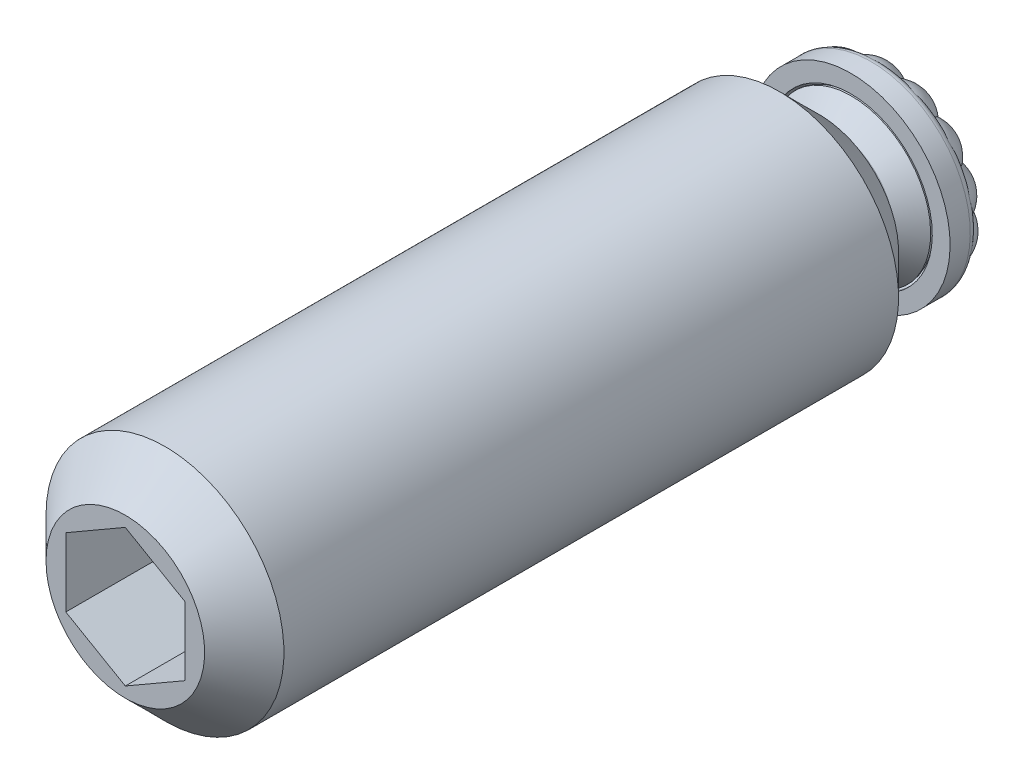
ISO-10303-21;
HEADER;
FILE_DESCRIPTION(('STEP AP214'),'2;1');
FILE_NAME('part.step','',(''),(''),'','','');
FILE_SCHEMA(('AUTOMOTIVE_DESIGN { 1 0 10303 214 1 1 1 1 }'));
ENDSEC;
DATA;
#1=APPLICATION_CONTEXT('core data for automotive mechanical design processes');
#2=APPLICATION_PROTOCOL_DEFINITION('international standard','automotive_design',2000,#1);
#3=PRODUCT_CONTEXT('',#1,'mechanical');
#4=PRODUCT('Part','Part','',(#3));
#5=PRODUCT_RELATED_PRODUCT_CATEGORY('part','',(#4));
#6=PRODUCT_DEFINITION_FORMATION('','',#4);
#7=PRODUCT_DEFINITION_CONTEXT('part definition',#1,'design');
#8=PRODUCT_DEFINITION('design','',#6,#7);
#9=PRODUCT_DEFINITION_SHAPE('','',#8);
#10=(LENGTH_UNIT() NAMED_UNIT(*) SI_UNIT(.MILLI.,.METRE.));
#11=(NAMED_UNIT(*) PLANE_ANGLE_UNIT() SI_UNIT($,.RADIAN.));
#12=(NAMED_UNIT(*) SI_UNIT($,.STERADIAN.) SOLID_ANGLE_UNIT());
#13=UNCERTAINTY_MEASURE_WITH_UNIT(LENGTH_MEASURE(1.E-05),#10,'distance_accuracy_value','');
#14=(GEOMETRIC_REPRESENTATION_CONTEXT(3) GLOBAL_UNCERTAINTY_ASSIGNED_CONTEXT((#13)) GLOBAL_UNIT_ASSIGNED_CONTEXT((#10,
#11,#12)) REPRESENTATION_CONTEXT('',''));
#15=CARTESIAN_POINT('',(0.,0.,0.));
#16=DIRECTION('',(0.,0.,1.));
#17=DIRECTION('',(1.,0.,0.));
#18=AXIS2_PLACEMENT_3D('',#15,#16,#17);
#19=CARTESIAN_POINT('',(0.,0.,4.));
#20=DIRECTION('',(0.,0.,-1.));
#21=DIRECTION('',(-1.,0.,0.));
#22=AXIS2_PLACEMENT_3D('',#19,#20,#21);
#23=PLANE('',#22);
#24=CARTESIAN_POINT('',(0.,0.,4.));
#25=DIRECTION('',(0.,0.,-1.));
#26=DIRECTION('',(-1.,0.,0.));
#27=AXIS2_PLACEMENT_3D('',#24,#25,#26);
#28=CIRCLE('',#27,4.);
#29=CARTESIAN_POINT('',(-4.,0.,4.));
#30=VERTEX_POINT('',#29);
#31=EDGE_CURVE('E85',#30,#30,#28,.T.);
#32=ORIENTED_EDGE('',*,*,#31,.T.);
#33=EDGE_LOOP('',(#32));
#34=FACE_BOUND('',#33,.T.);
#35=CARTESIAN_POINT('',(0.,0.,4.));
#36=DIRECTION('',(0.,0.,-1.));
#37=DIRECTION('',(-1.,0.,0.));
#38=AXIS2_PLACEMENT_3D('',#35,#36,#37);
#39=CIRCLE('',#38,3.);
#40=CARTESIAN_POINT('',(-3.,0.,4.));
#41=VERTEX_POINT('',#40);
#42=EDGE_CURVE('E9',#41,#41,#39,.T.);
#43=ORIENTED_EDGE('',*,*,#42,.F.);
#44=EDGE_LOOP('',(#43));
#45=FACE_BOUND('',#44,.T.);
#46=ADVANCED_FACE('F14',(#34,#45),#23,.T.);
#47=CARTESIAN_POINT('',(0.,0.,39.));
#48=DIRECTION('',(0.,0.,-1.));
#49=DIRECTION('',(-1.,0.,0.));
#50=AXIS2_PLACEMENT_3D('',#47,#48,#49);
#51=CYLINDRICAL_SURFACE('',#50,6.);
#52=CARTESIAN_POINT('',(0.,0.,6.));
#53=DIRECTION('',(0.,0.,-1.));
#54=DIRECTION('',(-1.,0.,0.));
#55=AXIS2_PLACEMENT_3D('',#52,#53,#54);
#56=CIRCLE('',#55,6.);
#57=CARTESIAN_POINT('',(-6.,0.,6.));
#58=VERTEX_POINT('',#57);
#59=EDGE_CURVE('E127',#58,#58,#56,.F.);
#60=ORIENTED_EDGE('',*,*,#59,.T.);
#61=EDGE_LOOP('',(#60));
#62=FACE_BOUND('',#61,.T.);
#63=CARTESIAN_POINT('',(0.,0.,37.));
#64=DIRECTION('',(0.,0.,-1.));
#65=DIRECTION('',(-1.,0.,0.));
#66=AXIS2_PLACEMENT_3D('',#63,#64,#65);
#67=CIRCLE('',#66,6.);
#68=CARTESIAN_POINT('',(-6.,0.,37.));
#69=VERTEX_POINT('',#68);
#70=EDGE_CURVE('E125',#69,#69,#67,.T.);
#71=ORIENTED_EDGE('',*,*,#70,.T.);
#72=EDGE_LOOP('',(#71));
#73=FACE_BOUND('',#72,.T.);
#74=ADVANCED_FACE('F986',(#62,#73),#51,.T.);
#75=CARTESIAN_POINT('',(0.,0.,39.));
#76=DIRECTION('',(0.,0.,-1.));
#77=DIRECTION('',(-1.,0.,0.));
#78=AXIS2_PLACEMENT_3D('',#75,#76,#77);
#79=PLANE('',#78);
#80=CARTESIAN_POINT('',(0.,0.,39.));
#81=DIRECTION('',(0.,0.,-1.));
#82=DIRECTION('',(-1.,0.,0.));
#83=AXIS2_PLACEMENT_3D('',#80,#81,#82);
#84=CIRCLE('',#83,4.);
#85=CARTESIAN_POINT('',(-4.,0.,39.));
#86=VERTEX_POINT('',#85);
#87=EDGE_CURVE('E18',#86,#86,#84,.F.);
#88=ORIENTED_EDGE('',*,*,#87,.T.);
#89=EDGE_LOOP('',(#88));
#90=FACE_BOUND('',#89,.T.);
#91=DIRECTION('',(-0.866025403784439,-0.5,0.));
#92=VECTOR('',#91,1.);
#93=CARTESIAN_POINT('',(0.,3.46410161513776,39.));
#94=LINE('',#93,#92);
#95=CARTESIAN_POINT('',(0.,3.46410161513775,39.));
#96=VERTEX_POINT('',#95);
#97=CARTESIAN_POINT('',(-3.,1.73205080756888,39.));
#98=VERTEX_POINT('',#97);
#99=EDGE_CURVE('E100',#96,#98,#94,.T.);
#100=ORIENTED_EDGE('',*,*,#99,.F.);
#101=DIRECTION('',(-0.866025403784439,0.5,0.));
#102=VECTOR('',#101,1.);
#103=CARTESIAN_POINT('',(3.,1.73205080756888,39.));
#104=LINE('',#103,#102);
#105=CARTESIAN_POINT('',(3.,1.73205080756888,39.));
#106=VERTEX_POINT('',#105);
#107=EDGE_CURVE('E78',#106,#96,#104,.T.);
#108=ORIENTED_EDGE('',*,*,#107,.F.);
#109=DIRECTION('',(0.,1.,0.));
#110=VECTOR('',#109,1.);
#111=CARTESIAN_POINT('',(3.,-1.73205080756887,39.));
#112=LINE('',#111,#110);
#113=CARTESIAN_POINT('',(3.,-1.73205080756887,39.));
#114=VERTEX_POINT('',#113);
#115=EDGE_CURVE('E89',#114,#106,#112,.T.);
#116=ORIENTED_EDGE('',*,*,#115,.F.);
#117=DIRECTION('',(0.866025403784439,0.5,0.));
#118=VECTOR('',#117,1.);
#119=CARTESIAN_POINT('',(0.,-3.46410161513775,39.));
#120=LINE('',#119,#118);
#121=CARTESIAN_POINT('',(0.,-3.46410161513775,39.));
#122=VERTEX_POINT('',#121);
#123=EDGE_CURVE('E94',#122,#114,#120,.T.);
#124=ORIENTED_EDGE('',*,*,#123,.F.);
#125=DIRECTION('',(0.866025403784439,-0.5,0.));
#126=VECTOR('',#125,1.);
#127=CARTESIAN_POINT('',(-3.,-1.73205080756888,39.));
#128=LINE('',#127,#126);
#129=CARTESIAN_POINT('',(-3.,-1.73205080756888,39.));
#130=VERTEX_POINT('',#129);
#131=EDGE_CURVE('E110',#130,#122,#128,.T.);
#132=ORIENTED_EDGE('',*,*,#131,.F.);
#133=DIRECTION('',(0.,-1.,0.));
#134=VECTOR('',#133,1.);
#135=CARTESIAN_POINT('',(-3.,1.73205080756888,39.));
#136=LINE('',#135,#134);
#137=EDGE_CURVE('E102',#98,#130,#136,.T.);
#138=ORIENTED_EDGE('',*,*,#137,.F.);
#139=EDGE_LOOP('',(#100,#108,#116,#124,#132,#138));
#140=FACE_BOUND('',#139,.T.);
#141=ADVANCED_FACE('F97',(#90,#140),#79,.F.);
#142=CARTESIAN_POINT('',(3.,1.73205080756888,32.5));
#143=DIRECTION('',(0.5,0.866025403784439,0.));
#144=DIRECTION('',(0.866025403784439,-0.5,0.));
#145=AXIS2_PLACEMENT_3D('',#142,#143,#144);
#146=PLANE('',#145);
#147=ORIENTED_EDGE('',*,*,#107,.T.);
#148=DIRECTION('',(0.,0.,1.));
#149=VECTOR('',#148,1.);
#150=CARTESIAN_POINT('',(0.,3.46410161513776,32.5));
#151=LINE('',#150,#149);
#152=CARTESIAN_POINT('',(0.,3.46410161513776,32.5));
#153=VERTEX_POINT('',#152);
#154=EDGE_CURVE('E121',#153,#96,#151,.T.);
#155=ORIENTED_EDGE('',*,*,#154,.F.);
#156=DIRECTION('',(-0.866025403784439,0.5,0.));
#157=VECTOR('',#156,1.);
#158=CARTESIAN_POINT('',(3.,1.73205080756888,32.5));
#159=LINE('',#158,#157);
#160=CARTESIAN_POINT('',(3.,1.73205080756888,32.5));
#161=VERTEX_POINT('',#160);
#162=EDGE_CURVE('E81',#161,#153,#159,.T.);
#163=ORIENTED_EDGE('',*,*,#162,.F.);
#164=DIRECTION('',(0.,0.,1.));
#165=VECTOR('',#164,1.);
#166=CARTESIAN_POINT('',(3.,1.73205080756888,32.5));
#167=LINE('',#166,#165);
#168=EDGE_CURVE('E74',#161,#106,#167,.T.);
#169=ORIENTED_EDGE('',*,*,#168,.T.);
#170=EDGE_LOOP('',(#147,#155,#163,#169));
#171=FACE_BOUND('',#170,.T.);
#172=ADVANCED_FACE('F76',(#171),#146,.F.);
#173=CARTESIAN_POINT('',(3.,-1.73205080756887,32.5));
#174=DIRECTION('',(1.,0.,0.));
#175=DIRECTION('',(0.,0.,-1.));
#176=AXIS2_PLACEMENT_3D('',#173,#174,#175);
#177=PLANE('',#176);
#178=ORIENTED_EDGE('',*,*,#115,.T.);
#179=ORIENTED_EDGE('',*,*,#168,.F.);
#180=DIRECTION('',(0.,1.,0.));
#181=VECTOR('',#180,1.);
#182=CARTESIAN_POINT('',(3.,-1.73205080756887,32.5));
#183=LINE('',#182,#181);
#184=CARTESIAN_POINT('',(3.,-1.73205080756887,32.5));
#185=VERTEX_POINT('',#184);
#186=EDGE_CURVE('E105',#185,#161,#183,.T.);
#187=ORIENTED_EDGE('',*,*,#186,.F.);
#188=DIRECTION('',(0.,0.,1.));
#189=VECTOR('',#188,1.);
#190=CARTESIAN_POINT('',(3.,-1.73205080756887,32.5));
#191=LINE('',#190,#189);
#192=EDGE_CURVE('E86',#185,#114,#191,.T.);
#193=ORIENTED_EDGE('',*,*,#192,.T.);
#194=EDGE_LOOP('',(#178,#179,#187,#193));
#195=FACE_BOUND('',#194,.T.);
#196=ADVANCED_FACE('F90',(#195),#177,.F.);
#197=CARTESIAN_POINT('',(0.,-3.46410161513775,32.5));
#198=DIRECTION('',(0.5,-0.866025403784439,0.));
#199=DIRECTION('',(-0.866025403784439,-0.5,0.));
#200=AXIS2_PLACEMENT_3D('',#197,#198,#199);
#201=PLANE('',#200);
#202=ORIENTED_EDGE('',*,*,#123,.T.);
#203=ORIENTED_EDGE('',*,*,#192,.F.);
#204=DIRECTION('',(0.866025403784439,0.5,0.));
#205=VECTOR('',#204,1.);
#206=CARTESIAN_POINT('',(0.,-3.46410161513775,32.5));
#207=LINE('',#206,#205);
#208=CARTESIAN_POINT('',(0.,-3.46410161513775,32.5));
#209=VERTEX_POINT('',#208);
#210=EDGE_CURVE('E1778',#209,#185,#207,.T.);
#211=ORIENTED_EDGE('',*,*,#210,.F.);
#212=DIRECTION('',(0.,0.,1.));
#213=VECTOR('',#212,1.);
#214=CARTESIAN_POINT('',(0.,-3.46410161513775,32.5));
#215=LINE('',#214,#213);
#216=EDGE_CURVE('E115',#209,#122,#215,.T.);
#217=ORIENTED_EDGE('',*,*,#216,.T.);
#218=EDGE_LOOP('',(#202,#203,#211,#217));
#219=FACE_BOUND('',#218,.T.);
#220=ADVANCED_FACE('F967',(#219),#201,.F.);
#221=CARTESIAN_POINT('',(-3.,-1.73205080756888,32.5));
#222=DIRECTION('',(-0.5,-0.866025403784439,0.));
#223=DIRECTION('',(-0.866025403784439,0.5,0.));
#224=AXIS2_PLACEMENT_3D('',#221,#222,#223);
#225=PLANE('',#224);
#226=ORIENTED_EDGE('',*,*,#131,.T.);
#227=ORIENTED_EDGE('',*,*,#216,.F.);
#228=DIRECTION('',(0.866025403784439,-0.5,0.));
#229=VECTOR('',#228,1.);
#230=CARTESIAN_POINT('',(-3.,-1.73205080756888,32.5));
#231=LINE('',#230,#229);
#232=CARTESIAN_POINT('',(-3.,-1.73205080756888,32.5));
#233=VERTEX_POINT('',#232);
#234=EDGE_CURVE('E1776',#233,#209,#231,.T.);
#235=ORIENTED_EDGE('',*,*,#234,.F.);
#236=DIRECTION('',(0.,0.,1.));
#237=VECTOR('',#236,1.);
#238=CARTESIAN_POINT('',(-3.,-1.73205080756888,32.5));
#239=LINE('',#238,#237);
#240=EDGE_CURVE('E117',#233,#130,#239,.T.);
#241=ORIENTED_EDGE('',*,*,#240,.T.);
#242=EDGE_LOOP('',(#226,#227,#235,#241));
#243=FACE_BOUND('',#242,.T.);
#244=ADVANCED_FACE('F970',(#243),#225,.F.);
#245=CARTESIAN_POINT('',(-3.,1.73205080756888,32.5));
#246=DIRECTION('',(-1.,0.,0.));
#247=DIRECTION('',(0.,1.,0.));
#248=AXIS2_PLACEMENT_3D('',#245,#246,#247);
#249=PLANE('',#248);
#250=ORIENTED_EDGE('',*,*,#137,.T.);
#251=ORIENTED_EDGE('',*,*,#240,.F.);
#252=DIRECTION('',(0.,-1.,0.));
#253=VECTOR('',#252,1.);
#254=CARTESIAN_POINT('',(-3.,1.73205080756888,32.5));
#255=LINE('',#254,#253);
#256=CARTESIAN_POINT('',(-3.,1.73205080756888,32.5));
#257=VERTEX_POINT('',#256);
#258=EDGE_CURVE('E1773',#257,#233,#255,.T.);
#259=ORIENTED_EDGE('',*,*,#258,.F.);
#260=DIRECTION('',(0.,0.,1.));
#261=VECTOR('',#260,1.);
#262=CARTESIAN_POINT('',(-3.,1.73205080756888,32.5));
#263=LINE('',#262,#261);
#264=EDGE_CURVE('E119',#257,#98,#263,.T.);
#265=ORIENTED_EDGE('',*,*,#264,.T.);
#266=EDGE_LOOP('',(#250,#251,#259,#265));
#267=FACE_BOUND('',#266,.T.);
#268=ADVANCED_FACE('F974',(#267),#249,.F.);
#269=CARTESIAN_POINT('',(0.,3.46410161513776,32.5));
#270=DIRECTION('',(-0.5,0.866025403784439,0.));
#271=DIRECTION('',(0.866025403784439,0.5,0.));
#272=AXIS2_PLACEMENT_3D('',#269,#270,#271);
#273=PLANE('',#272);
#274=ORIENTED_EDGE('',*,*,#99,.T.);
#275=ORIENTED_EDGE('',*,*,#264,.F.);
#276=DIRECTION('',(-0.866025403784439,-0.5,0.));
#277=VECTOR('',#276,1.);
#278=CARTESIAN_POINT('',(0.,3.46410161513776,32.5));
#279=LINE('',#278,#277);
#280=EDGE_CURVE('E1770',#153,#257,#279,.T.);
#281=ORIENTED_EDGE('',*,*,#280,.F.);
#282=ORIENTED_EDGE('',*,*,#154,.T.);
#283=EDGE_LOOP('',(#274,#275,#281,#282));
#284=FACE_BOUND('',#283,.T.);
#285=ADVANCED_FACE('F963',(#284),#273,.F.);
#286=CARTESIAN_POINT('',(6.,0.,32.5));
#287=DIRECTION('',(0.,0.,-1.));
#288=DIRECTION('',(-1.,0.,0.));
#289=AXIS2_PLACEMENT_3D('',#286,#287,#288);
#290=PLANE('',#289);
#291=ORIENTED_EDGE('',*,*,#162,.T.);
#292=ORIENTED_EDGE('',*,*,#280,.T.);
#293=ORIENTED_EDGE('',*,*,#258,.T.);
#294=ORIENTED_EDGE('',*,*,#234,.T.);
#295=ORIENTED_EDGE('',*,*,#210,.T.);
#296=ORIENTED_EDGE('',*,*,#186,.T.);
#297=EDGE_LOOP('',(#291,#292,#293,#294,#295,#296));
#298=FACE_BOUND('',#297,.T.);
#299=ADVANCED_FACE('F959',(#298),#290,.F.);
#300=CARTESIAN_POINT('',(0.,0.,4.));
#301=DIRECTION('',(0.,0.,1.));
#302=DIRECTION('',(1.,0.,0.));
#303=AXIS2_PLACEMENT_3D('',#300,#301,#302);
#304=CONICAL_SURFACE('',#303,4.,0.785398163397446);
#305=ORIENTED_EDGE('',*,*,#59,.F.);
#306=EDGE_LOOP('',(#305));
#307=FACE_BOUND('',#306,.T.);
#308=ORIENTED_EDGE('',*,*,#31,.F.);
#309=EDGE_LOOP('',(#308));
#310=FACE_BOUND('',#309,.T.);
#311=ADVANCED_FACE('F962',(#307,#310),#304,.T.);
#312=CARTESIAN_POINT('',(0.,0.,37.));
#313=DIRECTION('',(0.,0.,-1.));
#314=DIRECTION('',(-1.,0.,0.));
#315=AXIS2_PLACEMENT_3D('',#312,#313,#314);
#316=CONICAL_SURFACE('',#315,6.,0.785398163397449);
#317=ORIENTED_EDGE('',*,*,#87,.F.);
#318=EDGE_LOOP('',(#317));
#319=FACE_BOUND('',#318,.T.);
#320=ORIENTED_EDGE('',*,*,#70,.F.);
#321=EDGE_LOOP('',(#320));
#322=FACE_BOUND('',#321,.T.);
#323=ADVANCED_FACE('F16',(#319,#322),#316,.T.);
#324=CARTESIAN_POINT('',(0.,0.,3.48633025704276));
#325=DIRECTION('',(0.,0.,-1.));
#326=DIRECTION('',(-0.965048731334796,-0.262070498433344,0.));
#327=AXIS2_PLACEMENT_3D('',#324,#325,#326);
#328=TOROIDAL_SURFACE('',#327,3.254,0.254);
#329=CARTESIAN_POINT('',(0.,0.,3.48633025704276));
#330=DIRECTION('',(0.,0.,-1.));
#331=DIRECTION('',(-0.965048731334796,-0.262070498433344,0.));
#332=AXIS2_PLACEMENT_3D('',#329,#330,#331);
#333=CIRCLE('',#332,3.);
#334=CARTESIAN_POINT('',(-2.89514619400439,-0.786211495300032,3.48633025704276));
#335=VERTEX_POINT('',#334);
#336=EDGE_CURVE('E1659',#335,#335,#333,.F.);
#337=ORIENTED_EDGE('',*,*,#336,.F.);
#338=EDGE_LOOP('',(#337));
#339=FACE_BOUND('',#338,.T.);
#340=CARTESIAN_POINT('',(0.,0.,3.30672513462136));
#341=DIRECTION('',(0.,0.,-1.));
#342=DIRECTION('',(-0.965048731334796,-0.262070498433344,0.));
#343=AXIS2_PLACEMENT_3D('',#340,#341,#342);
#344=CIRCLE('',#343,3.07439487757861);
#345=CARTESIAN_POINT('',(-2.96694087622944,-0.805708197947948,3.30672513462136));
#346=VERTEX_POINT('',#345);
#347=EDGE_CURVE('E24',#346,#346,#344,.T.);
#348=ORIENTED_EDGE('',*,*,#347,.F.);
#349=EDGE_LOOP('',(#348));
#350=FACE_BOUND('',#349,.T.);
#351=ADVANCED_FACE('F236',(#339,#350),#328,.F.);
#352=CARTESIAN_POINT('',(0.,0.,2.0001200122));
#353=DIRECTION('',(0.,0.,-1.));
#354=DIRECTION('',(-0.965048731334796,-0.262070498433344,0.));
#355=AXIS2_PLACEMENT_3D('',#352,#353,#354);
#356=CYLINDRICAL_SURFACE('',#355,3.);
#357=ORIENTED_EDGE('',*,*,#42,.T.);
#358=EDGE_LOOP('',(#357));
#359=FACE_BOUND('',#358,.T.);
#360=ORIENTED_EDGE('',*,*,#336,.T.);
#361=EDGE_LOOP('',(#360));
#362=FACE_BOUND('',#361,.T.);
#363=ADVANCED_FACE('F1564',(#359,#362),#356,.T.);
#364=CARTESIAN_POINT('',(0.,0.,3.38112001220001));
#365=DIRECTION('',(0.,0.,-1.));
#366=DIRECTION('',(-0.965048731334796,-0.262070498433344,0.));
#367=AXIS2_PLACEMENT_3D('',#364,#365,#366);
#368=CONICAL_SURFACE('',#367,3.,0.78539816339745);
#369=ORIENTED_EDGE('',*,*,#347,.T.);
#370=EDGE_LOOP('',(#369));
#371=FACE_BOUND('',#370,.T.);
#372=CARTESIAN_POINT('',(0.,0.,2.38112001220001));
#373=DIRECTION('',(0.,0.,-1.));
#374=DIRECTION('',(-0.965048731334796,-0.262070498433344,0.));
#375=AXIS2_PLACEMENT_3D('',#372,#373,#374);
#376=CIRCLE('',#375,4.);
#377=CARTESIAN_POINT('',(-3.86019492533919,-1.04828199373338,2.38112001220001));
#378=VERTEX_POINT('',#377);
#379=EDGE_CURVE('E1053',#378,#378,#376,.T.);
#380=ORIENTED_EDGE('',*,*,#379,.F.);
#381=EDGE_LOOP('',(#380));
#382=FACE_BOUND('',#381,.T.);
#383=ADVANCED_FACE('F1015',(#371,#382),#368,.T.);
#384=CARTESIAN_POINT('',(0.,0.,2.38112001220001));
#385=DIRECTION('',(0.,0.,1.));
#386=DIRECTION('',(0.965048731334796,0.262070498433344,0.));
#387=AXIS2_PLACEMENT_3D('',#384,#385,#386);
#388=TOROIDAL_SURFACE('',#387,3.619,0.381);
#389=ORIENTED_EDGE('',*,*,#379,.T.);
#390=EDGE_LOOP('',(#389));
#391=FACE_BOUND('',#390,.T.);
#392=CARTESIAN_POINT('',(0.,0.,2.0001200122));
#393=DIRECTION('',(0.,0.,1.));
#394=DIRECTION('',(0.965048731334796,0.262070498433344,0.));
#395=AXIS2_PLACEMENT_3D('',#392,#393,#394);
#396=CIRCLE('',#395,3.619);
#397=CARTESIAN_POINT('',(3.49251135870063,0.948433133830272,2.0001200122));
#398=VERTEX_POINT('',#397);
#399=EDGE_CURVE('E1663',#398,#398,#396,.F.);
#400=ORIENTED_EDGE('',*,*,#399,.F.);
#401=EDGE_LOOP('',(#400));
#402=FACE_BOUND('',#401,.T.);
#403=ADVANCED_FACE('F990',(#391,#402),#388,.T.);
#404=CARTESIAN_POINT('',(4.45756009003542,1.21050363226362,1.0001200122));
#405=DIRECTION('',(0.,0.,1.));
#406=DIRECTION('',(0.262070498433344,-0.965048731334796,0.));
#407=AXIS2_PLACEMENT_3D('',#404,#405,#406);
#408=PLANE('',#407);
#409=CARTESIAN_POINT('',(1.6047055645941,-3.01165673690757,1.0001200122));
#410=DIRECTION('',(0.,0.,1.));
#411=DIRECTION('',(-0.882536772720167,-0.470243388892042,0.));
#412=AXIS2_PLACEMENT_3D('',#409,#410,#411);
#413=CIRCLE('',#412,1.47478812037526);
#414=CARTESIAN_POINT('',(0.962871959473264,-1.68385794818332,1.0001200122));
#415=VERTEX_POINT('',#414);
#416=CARTESIAN_POINT('',(1.35071093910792,-1.55890530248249,1.0001200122));
#417=VERTEX_POINT('',#416);
#418=EDGE_CURVE('E321',#415,#417,#413,.F.);
#419=ORIENTED_EDGE('',*,*,#418,.F.);
#420=CARTESIAN_POINT('',(0.,0.,1.0001200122));
#421=DIRECTION('',(0.,0.,1.));
#422=DIRECTION('',(0.262070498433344,-0.965048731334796,0.));
#423=AXIS2_PLACEMENT_3D('',#420,#421,#422);
#424=CIRCLE('',#423,1.93971647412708);
#425=CARTESIAN_POINT('',(1.52961064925,-1.19280814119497,1.0001200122));
#426=VERTEX_POINT('',#425);
#427=EDGE_CURVE('E203',#415,#426,#424,.T.);
#428=ORIENTED_EDGE('',*,*,#427,.T.);
#429=CARTESIAN_POINT('',(2.7524986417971,-2.01715331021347,1.0001200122));
#430=DIRECTION('',(0.,0.,1.));
#431=DIRECTION('',(-0.591107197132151,-0.80659300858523,0.));
#432=AXIS2_PLACEMENT_3D('',#429,#430,#431);
#433=CIRCLE('',#432,1.47478812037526);
#434=EDGE_CURVE('E371',#417,#426,#433,.F.);
#435=ORIENTED_EDGE('',*,*,#434,.F.);
#436=EDGE_LOOP('',(#419,#428,#435));
#437=FACE_BOUND('',#436,.T.);
#438=ADVANCED_FACE('F957',(#437),#408,.F.);
#439=CARTESIAN_POINT('',(0.139080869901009,-3.40966461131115,1.0001200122));
#440=DIRECTION('',(0.,0.,1.));
#441=DIRECTION('',(-0.999169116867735,-0.0407562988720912,0.));
#442=AXIS2_PLACEMENT_3D('',#439,#440,#441);
#443=CIRCLE('',#442,1.47478812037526);
#444=CARTESIAN_POINT('',(0.136919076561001,-1.93487807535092,1.0001200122));
#445=VERTEX_POINT('',#444);
#446=CARTESIAN_POINT('',(0.540564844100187,-1.99057665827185,1.0001200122));
#447=VERTEX_POINT('',#446);
#448=EDGE_CURVE('E315',#445,#447,#443,.F.);
#449=ORIENTED_EDGE('',*,*,#448,.F.);
#450=CARTESIAN_POINT('',(0.860591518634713,-1.73835618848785,1.0001200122));
#451=VERTEX_POINT('',#450);
#452=EDGE_CURVE('E199',#445,#451,#424,.T.);
#453=ORIENTED_EDGE('',*,*,#452,.T.);
#454=EDGE_CURVE('E312',#447,#451,#413,.F.);
#455=ORIENTED_EDGE('',*,*,#454,.F.);
#456=EDGE_LOOP('',(#449,#453,#455));
#457=FACE_BOUND('',#456,.T.);
#458=ADVANCED_FACE('F310',(#457),#408,.F.);
#459=CARTESIAN_POINT('',(-1.3540904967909,-3.13234659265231,1.0001200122));
#460=DIRECTION('',(0.,0.,1.));
#461=DIRECTION('',(-0.917903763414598,0.396803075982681,0.));
#462=AXIS2_PLACEMENT_3D('',#459,#460,#461);
#463=CIRCLE('',#462,1.47478812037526);
#464=CARTESIAN_POINT('',(-0.716152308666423,-1.80267186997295,1.0001200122));
#465=VERTEX_POINT('',#464);
#466=CARTESIAN_POINT('',(-0.376646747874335,-2.02798989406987,1.0001200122));
#467=VERTEX_POINT('',#466);
#468=EDGE_CURVE('E753',#465,#467,#463,.F.);
#469=ORIENTED_EDGE('',*,*,#468,.F.);
#470=CARTESIAN_POINT('',(0.0211216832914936,-1.93960147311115,1.0001200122));
#471=VERTEX_POINT('',#470);
#472=EDGE_CURVE('E194',#465,#471,#424,.T.);
#473=ORIENTED_EDGE('',*,*,#472,.T.);
#474=EDGE_CURVE('E762',#467,#471,#443,.F.);
#475=ORIENTED_EDGE('',*,*,#474,.F.);
#476=EDGE_LOOP('',(#469,#473,#475));
#477=FACE_BOUND('',#476,.T.);
#478=ADVANCED_FACE('F958',(#477),#408,.F.);
#479=CARTESIAN_POINT('',(-2.57906763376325,-2.23462891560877,1.0001200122));
#480=DIRECTION('',(0.,0.,1.));
#481=DIRECTION('',(-0.654836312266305,0.75577073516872,0.));
#482=AXIS2_PLACEMENT_3D('',#479,#480,#481);
#483=CIRCLE('',#482,1.47478812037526);
#484=CARTESIAN_POINT('',(-1.4273809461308,-1.31342439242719,1.0001200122));
#485=VERTEX_POINT('',#484);
#486=CARTESIAN_POINT('',(-1.21925883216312,-1.66373485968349,1.0001200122));
#487=VERTEX_POINT('',#486);
#488=EDGE_CURVE('E710',#485,#487,#483,.F.);
#489=ORIENTED_EDGE('',*,*,#488,.F.);
#490=CARTESIAN_POINT('',(-0.82253156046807,-1.75668489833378,1.0001200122));
#491=VERTEX_POINT('',#490);
#492=EDGE_CURVE('E189',#485,#491,#424,.T.);
#493=ORIENTED_EDGE('',*,*,#492,.T.);
#494=EDGE_CURVE('E723',#487,#491,#463,.F.);
#495=ORIENTED_EDGE('',*,*,#494,.F.);
#496=EDGE_LOOP('',(#489,#493,#495));
#497=FACE_BOUND('',#496,.T.);
#498=ADVANCED_FACE('F1529',(#497),#408,.F.);
#499=CARTESIAN_POINT('',(-3.29322879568,-0.894315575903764,1.0001200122));
#500=DIRECTION('',(0.,0.,1.));
#501=DIRECTION('',(-0.262070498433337,0.965048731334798,0.));
#502=AXIS2_PLACEMENT_3D('',#499,#500,#501);
#503=CIRCLE('',#502,1.47478812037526);
#504=CARTESIAN_POINT('',(-1.85589928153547,-0.564037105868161,1.0001200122));
#505=VERTEX_POINT('',#504);
#506=CARTESIAN_POINT('',(-1.82038175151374,-0.969956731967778,1.0001200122));
#507=VERTEX_POINT('',#506);
#508=EDGE_CURVE('E666',#505,#507,#503,.F.);
#509=ORIENTED_EDGE('',*,*,#508,.F.);
#510=CARTESIAN_POINT('',(-1.50327234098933,-1.22583533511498,1.0001200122));
#511=VERTEX_POINT('',#510);
#512=EDGE_CURVE('E184',#505,#511,#424,.T.);
#513=ORIENTED_EDGE('',*,*,#512,.T.);
#514=EDGE_CURVE('E680',#507,#511,#483,.F.);
#515=ORIENTED_EDGE('',*,*,#514,.F.);
#516=EDGE_LOOP('',(#509,#513,#515));
#517=FACE_BOUND('',#516,.T.);
#518=ADVANCED_FACE('F1192',(#517),#408,.F.);
#519=CARTESIAN_POINT('',(-3.35512560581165,0.623127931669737,1.0001200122));
#520=DIRECTION('',(0.,0.,1.));
#521=DIRECTION('',(0.182601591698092,0.983186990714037,0.));
#522=AXIS2_PLACEMENT_3D('',#519,#520,#521);
#523=CIRCLE('',#522,1.47478812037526);
#524=CARTESIAN_POINT('',(-1.91683400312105,0.297064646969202,1.0001200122));
#525=VERTEX_POINT('',#524);
#526=CARTESIAN_POINT('',(-2.06095573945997,-0.0840667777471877,1.0001200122));
#527=VERTEX_POINT('',#526);
#528=EDGE_CURVE('E624',#525,#527,#523,.F.);
#529=ORIENTED_EDGE('',*,*,#528,.F.);
#530=CARTESIAN_POINT('',(-1.88627159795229,-0.45219404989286,1.0001200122));
#531=VERTEX_POINT('',#530);
#532=EDGE_CURVE('E179',#525,#531,#424,.T.);
#533=ORIENTED_EDGE('',*,*,#532,.T.);
#534=EDGE_CURVE('E636',#527,#531,#503,.F.);
#535=ORIENTED_EDGE('',*,*,#534,.F.);
#536=EDGE_LOOP('',(#529,#533,#535));
#537=FACE_BOUND('',#536,.T.);
#538=ADVANCED_FACE('F1514',(#537),#408,.F.);
#539=CARTESIAN_POINT('',(-2.75249864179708,2.01715331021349,1.0001200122));
#540=DIRECTION('',(0.,0.,1.));
#541=DIRECTION('',(0.591107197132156,0.806593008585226,0.));
#542=AXIS2_PLACEMENT_3D('',#539,#540,#541);
#543=CIRCLE('',#542,1.47478812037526);
#544=CARTESIAN_POINT('',(-1.5981162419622,1.09932910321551,1.0001200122));
#545=VERTEX_POINT('',#544);
#546=CARTESIAN_POINT('',(-1.89333216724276,0.818473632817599,1.0001200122));
#547=VERTEX_POINT('',#546);
#548=EDGE_CURVE('E581',#545,#547,#543,.F.);
#549=ORIENTED_EDGE('',*,*,#548,.F.);
#550=CARTESIAN_POINT('',(-1.89567163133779,0.411009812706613,1.0001200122));
#551=VERTEX_POINT('',#550);
#552=EDGE_CURVE('E174',#545,#551,#424,.T.);
#553=ORIENTED_EDGE('',*,*,#552,.T.);
#554=EDGE_CURVE('E594',#547,#551,#523,.F.);
#555=ORIENTED_EDGE('',*,*,#554,.F.);
#556=EDGE_LOOP('',(#549,#553,#555));
#557=FACE_BOUND('',#556,.T.);
#558=ADVANCED_FACE('F1506',(#557),#408,.F.);
#559=CARTESIAN_POINT('',(-1.60470556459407,3.01165673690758,1.0001200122));
#560=DIRECTION('',(0.,0.,1.));
#561=DIRECTION('',(0.88253677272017,0.470243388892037,0.));
#562=AXIS2_PLACEMENT_3D('',#559,#560,#561);
#563=CIRCLE('',#562,1.47478812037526);
#564=CARTESIAN_POINT('',(-0.962871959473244,1.68385794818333,1.0001200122));
#565=VERTEX_POINT('',#564);
#566=CARTESIAN_POINT('',(-1.35071093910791,1.55890530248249,1.0001200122));
#567=VERTEX_POINT('',#566);
#568=EDGE_CURVE('E537',#565,#567,#563,.F.);
#569=ORIENTED_EDGE('',*,*,#568,.F.);
#570=CARTESIAN_POINT('',(-1.52961064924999,1.19280814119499,1.0001200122));
#571=VERTEX_POINT('',#570);
#572=EDGE_CURVE('E169',#565,#571,#424,.T.);
#573=ORIENTED_EDGE('',*,*,#572,.T.);
#574=EDGE_CURVE('E551',#567,#571,#543,.F.);
#575=ORIENTED_EDGE('',*,*,#574,.F.);
#576=EDGE_LOOP('',(#569,#573,#575));
#577=FACE_BOUND('',#576,.T.);
#578=ADVANCED_FACE('F1498',(#577),#408,.F.);
#579=CARTESIAN_POINT('',(-0.139080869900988,3.40966461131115,1.0001200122));
#580=DIRECTION('',(0.,0.,1.));
#581=DIRECTION('',(0.999169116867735,0.0407562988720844,0.));
#582=AXIS2_PLACEMENT_3D('',#579,#580,#581);
#583=CIRCLE('',#582,1.47478812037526);
#584=CARTESIAN_POINT('',(-0.136919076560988,1.93487807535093,1.0001200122));
#585=VERTEX_POINT('',#584);
#586=CARTESIAN_POINT('',(-0.540564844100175,1.99057665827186,1.0001200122));
#587=VERTEX_POINT('',#586);
#588=EDGE_CURVE('E493',#585,#587,#583,.F.);
#589=ORIENTED_EDGE('',*,*,#588,.F.);
#590=CARTESIAN_POINT('',(-0.860591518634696,1.73835618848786,1.0001200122));
#591=VERTEX_POINT('',#590);
#592=EDGE_CURVE('E165',#585,#591,#424,.T.);
#593=ORIENTED_EDGE('',*,*,#592,.T.);
#594=EDGE_CURVE('E507',#587,#591,#563,.F.);
#595=ORIENTED_EDGE('',*,*,#594,.F.);
#596=EDGE_LOOP('',(#589,#593,#595));
#597=FACE_BOUND('',#596,.T.);
#598=ADVANCED_FACE('F1491',(#597),#408,.F.);
#599=CARTESIAN_POINT('',(1.35409049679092,3.13234659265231,1.0001200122));
#600=DIRECTION('',(0.,0.,1.));
#601=DIRECTION('',(0.917903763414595,-0.396803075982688,0.));
#602=AXIS2_PLACEMENT_3D('',#599,#600,#601);
#603=CIRCLE('',#602,1.47478812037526);
#604=CARTESIAN_POINT('',(0.716152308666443,1.80267186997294,1.0001200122));
#605=VERTEX_POINT('',#604);
#606=CARTESIAN_POINT('',(0.376646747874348,2.02798989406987,1.0001200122));
#607=VERTEX_POINT('',#606);
#608=EDGE_CURVE('E449',#605,#607,#603,.F.);
#609=ORIENTED_EDGE('',*,*,#608,.F.);
#610=CARTESIAN_POINT('',(-0.0211216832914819,1.93960147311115,1.0001200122));
#611=VERTEX_POINT('',#610);
#612=EDGE_CURVE('E33',#605,#611,#424,.T.);
#613=ORIENTED_EDGE('',*,*,#612,.T.);
#614=EDGE_CURVE('E461',#607,#611,#583,.F.);
#615=ORIENTED_EDGE('',*,*,#614,.F.);
#616=EDGE_LOOP('',(#609,#613,#615));
#617=FACE_BOUND('',#616,.T.);
#618=ADVANCED_FACE('F1483',(#617),#408,.F.);
#619=CARTESIAN_POINT('',(2.57906763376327,2.23462891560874,1.0001200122));
#620=DIRECTION('',(0.,0.,1.));
#621=DIRECTION('',(0.6548363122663,-0.755770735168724,0.));
#622=AXIS2_PLACEMENT_3D('',#619,#620,#621);
#623=CIRCLE('',#622,1.47478812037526);
#624=CARTESIAN_POINT('',(1.4273809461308,1.31342439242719,1.0001200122));
#625=VERTEX_POINT('',#624);
#626=CARTESIAN_POINT('',(1.21925883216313,1.66373485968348,1.0001200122));
#627=VERTEX_POINT('',#626);
#628=EDGE_CURVE('E400',#625,#627,#623,.F.);
#629=ORIENTED_EDGE('',*,*,#628,.F.);
#630=CARTESIAN_POINT('',(0.822531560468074,1.75668489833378,1.0001200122));
#631=VERTEX_POINT('',#630);
#632=EDGE_CURVE('E134',#625,#631,#424,.T.);
#633=ORIENTED_EDGE('',*,*,#632,.T.);
#634=EDGE_CURVE('E441',#627,#631,#603,.F.);
#635=ORIENTED_EDGE('',*,*,#634,.F.);
#636=EDGE_LOOP('',(#629,#633,#635));
#637=FACE_BOUND('',#636,.T.);
#638=ADVANCED_FACE('F1030',(#637),#408,.F.);
#639=CARTESIAN_POINT('',(3.29322879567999,0.894315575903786,1.0001200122));
#640=DIRECTION('',(0.,0.,1.));
#641=DIRECTION('',(0.262070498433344,-0.965048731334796,0.));
#642=AXIS2_PLACEMENT_3D('',#639,#640,#641);
#643=CIRCLE('',#642,1.47478812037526);
#644=CARTESIAN_POINT('',(1.85589928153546,0.564037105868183,1.0001200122));
#645=VERTEX_POINT('',#644);
#646=CARTESIAN_POINT('',(1.82038175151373,0.969956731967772,1.0001200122));
#647=VERTEX_POINT('',#646);
#648=EDGE_CURVE('E1068',#645,#647,#643,.F.);
#649=ORIENTED_EDGE('',*,*,#648,.F.);
#650=CARTESIAN_POINT('',(1.50327234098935,1.22583533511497,1.0001200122));
#651=VERTEX_POINT('',#650);
#652=EDGE_CURVE('E151',#645,#651,#424,.T.);
#653=ORIENTED_EDGE('',*,*,#652,.T.);
#654=EDGE_CURVE('E391',#647,#651,#623,.F.);
#655=ORIENTED_EDGE('',*,*,#654,.F.);
#656=EDGE_LOOP('',(#649,#653,#655));
#657=FACE_BOUND('',#656,.T.);
#658=ADVANCED_FACE('F1025',(#657),#408,.F.);
#659=CARTESIAN_POINT('',(3.35512560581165,-0.623127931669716,1.0001200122));
#660=DIRECTION('',(0.,0.,1.));
#661=DIRECTION('',(-0.182601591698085,-0.983186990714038,0.));
#662=AXIS2_PLACEMENT_3D('',#659,#660,#661);
#663=CIRCLE('',#662,1.47478812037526);
#664=CARTESIAN_POINT('',(1.91683400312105,-0.297064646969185,1.0001200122));
#665=VERTEX_POINT('',#664);
#666=CARTESIAN_POINT('',(2.06095573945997,0.084066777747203,1.0001200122));
#667=VERTEX_POINT('',#666);
#668=EDGE_CURVE('E903',#665,#667,#663,.F.);
#669=ORIENTED_EDGE('',*,*,#668,.F.);
#670=CARTESIAN_POINT('',(1.88627159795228,0.452194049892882,1.0001200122));
#671=VERTEX_POINT('',#670);
#672=EDGE_CURVE('E158',#665,#671,#424,.T.);
#673=ORIENTED_EDGE('',*,*,#672,.T.);
#674=EDGE_CURVE('E918',#667,#671,#643,.F.);
#675=ORIENTED_EDGE('',*,*,#674,.F.);
#676=EDGE_LOOP('',(#669,#673,#675));
#677=FACE_BOUND('',#676,.T.);
#678=ADVANCED_FACE('F235',(#677),#408,.F.);
#679=CARTESIAN_POINT('',(0.,0.,2.3813700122));
#680=DIRECTION('',(0.,0.,1.));
#681=DIRECTION('',(0.965048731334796,0.262070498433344,0.));
#682=AXIS2_PLACEMENT_3D('',#679,#680,#681);
#683=SPHERICAL_SURFACE('',#682,2.38125);
#684=CARTESIAN_POINT('',(-0.822531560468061,-1.75668489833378,1.0001200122));
#685=CARTESIAN_POINT('',(-0.818071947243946,-1.7585362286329,0.999819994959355));
#686=CARTESIAN_POINT('',(-0.813613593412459,-1.76039665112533,0.999557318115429));
#687=CARTESIAN_POINT('',(-0.804705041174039,-1.76413323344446,0.999107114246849));
#688=CARTESIAN_POINT('',(-0.800254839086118,-1.76600937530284,0.998919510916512));
#689=CARTESIAN_POINT('',(-0.791362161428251,-1.76977744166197,0.99861941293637));
#690=CARTESIAN_POINT('',(-0.786919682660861,-1.77166935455,0.998506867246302));
#691=CARTESIAN_POINT('',(-0.778042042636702,-1.77546905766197,0.998356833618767));
#692=CARTESIAN_POINT('',(-0.773606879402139,-1.77737684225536,0.998319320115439));
#693=CARTESIAN_POINT('',(-0.764743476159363,-1.78120842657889,0.998319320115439));
#694=CARTESIAN_POINT('',(-0.760315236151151,-1.78313222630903,0.998356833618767));
#695=CARTESIAN_POINT('',(-0.751465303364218,-1.78699602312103,0.998506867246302));
#696=CARTESIAN_POINT('',(-0.747043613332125,-1.7889360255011,0.99861941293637));
#697=CARTESIAN_POINT('',(-0.738206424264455,-1.79283245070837,0.998919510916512));
#698=CARTESIAN_POINT('',(-0.73379093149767,-1.79478888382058,0.999107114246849));
#699=CARTESIAN_POINT('',(-0.724965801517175,-1.79871844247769,0.999557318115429));
#700=CARTESIAN_POINT('',(-0.720556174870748,-1.80069158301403,0.999819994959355));
#701=CARTESIAN_POINT('',(-0.716152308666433,-1.80267186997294,1.0001200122));
#702=B_SPLINE_CURVE_WITH_KNOTS('',3,(#684,#685,#686,#687,#688,#689,#690,#691,#692,#693,#694,
#695,#696,#697,#698,#699,#700,#701),.UNSPECIFIED.,.F.,.F.,(4,2,2,2,2,2,2,2,4),(0.,
0.0145136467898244,0.029012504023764,0.0435014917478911,0.0579855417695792,0.0724695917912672,
0.0869585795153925,0.101457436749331,0.115971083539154),.UNSPECIFIED.);
#703=EDGE_CURVE('E718',#491,#465,#702,.T.);
#704=ORIENTED_EDGE('',*,*,#703,.F.);
#705=ORIENTED_EDGE('',*,*,#492,.F.);
#706=CARTESIAN_POINT('',(-1.50327234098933,-1.22583533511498,1.00012001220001));
#707=CARTESIAN_POINT('',(-1.50005763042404,-1.22943827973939,0.999819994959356));
#708=CARTESIAN_POINT('',(-1.49684799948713,-1.23304886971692,0.99955731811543));
#709=CARTESIAN_POINT('',(-1.49044291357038,-1.24028069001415,0.99910711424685));
#710=CARTESIAN_POINT('',(-1.48724744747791,-1.24390190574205,0.998919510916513));
#711=CARTESIAN_POINT('',(-1.48087032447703,-1.25115520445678,0.998619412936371));
#712=CARTESIAN_POINT('',(-1.47768865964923,-1.25478727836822,0.998506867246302));
#713=CARTESIAN_POINT('',(-1.47133881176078,-1.2620625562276,0.998356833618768));
#714=CARTESIAN_POINT('',(-1.46817062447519,-1.26570575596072,0.998319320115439));
#715=CARTESIAN_POINT('',(-1.46184743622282,-1.27300358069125,0.998319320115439));
#716=CARTESIAN_POINT('',(-1.45869243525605,-1.27665820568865,0.998356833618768));
#717=CARTESIAN_POINT('',(-1.45239535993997,-1.2839792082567,0.998506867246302));
#718=CARTESIAN_POINT('',(-1.4492532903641,-1.28764558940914,0.998619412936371));
#719=CARTESIAN_POINT('',(-1.44298185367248,-1.29499045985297,0.998919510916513));
#720=CARTESIAN_POINT('',(-1.43985249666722,-1.2986689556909,0.99910711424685));
#721=CARTESIAN_POINT('',(-1.43360630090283,-1.30603844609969,0.99955731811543));
#722=CARTESIAN_POINT('',(-1.43048947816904,-1.3097294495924,0.999819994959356));
#723=CARTESIAN_POINT('',(-1.4273809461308,-1.31342439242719,1.00012001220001));
#724=B_SPLINE_CURVE_WITH_KNOTS('',3,(#706,#707,#708,#709,#710,#711,#712,#713,#714,#715,#716,
#717,#718,#719,#720,#721,#722,#723),.UNSPECIFIED.,.F.,.F.,(4,2,2,2,2,2,2,2,4),(0.,
0.0145136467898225,0.0290125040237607,0.0435014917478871,0.0579855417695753,0.0724695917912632,
0.0869585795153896,0.101457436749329,0.115971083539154),.UNSPECIFIED.);
#725=EDGE_CURVE('E675',#511,#485,#724,.T.);
#726=ORIENTED_EDGE('',*,*,#725,.F.);
#727=ORIENTED_EDGE('',*,*,#512,.F.);
#728=CARTESIAN_POINT('',(-1.88627159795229,-0.45219404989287,1.00012001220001));
#729=CARTESIAN_POINT('',(-1.88493850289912,-0.456835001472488,0.999819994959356));
#730=CARTESIAN_POINT('',(-1.88361330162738,-0.461480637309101,0.99955731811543));
#731=CARTESIAN_POINT('',(-1.88098028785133,-0.470775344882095,0.99910711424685));
#732=CARTESIAN_POINT('',(-1.87967245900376,-0.475424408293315,0.998919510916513));
#733=CARTESIAN_POINT('',(-1.87707395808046,-0.484726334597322,0.998619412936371));
#734=CARTESIAN_POINT('',(-1.87578327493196,-0.489379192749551,0.998506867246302));
#735=CARTESIAN_POINT('',(-1.8732188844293,-0.498689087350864,0.998356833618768));
#736=CARTESIAN_POINT('',(-1.87194517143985,-0.503346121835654,0.998319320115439));
#737=CARTESIAN_POINT('',(-1.86941458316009,-0.512664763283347,0.998319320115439));
#738=CARTESIAN_POINT('',(-1.86815770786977,-0.517326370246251,0.998356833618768));
#739=CARTESIAN_POINT('',(-1.86566070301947,-0.52665456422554,0.998506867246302));
#740=CARTESIAN_POINT('',(-1.86442057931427,-0.531321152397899,0.998619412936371));
#741=CARTESIAN_POINT('',(-1.86195702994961,-0.540659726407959,0.998919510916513));
#742=CARTESIAN_POINT('',(-1.8607336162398,-0.545331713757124,0.99910711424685));
#743=CARTESIAN_POINT('',(-1.85830349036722,-0.554681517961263,0.99955731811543));
#744=CARTESIAN_POINT('',(-1.85709679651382,-0.559359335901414,0.999819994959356));
#745=CARTESIAN_POINT('',(-1.85589928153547,-0.564037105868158,1.00012001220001));
#746=B_SPLINE_CURVE_WITH_KNOTS('',3,(#728,#729,#730,#731,#732,#733,#734,#735,#736,#737,#738,
#739,#740,#741,#742,#743,#744,#745),.UNSPECIFIED.,.F.,.F.,(4,2,2,2,2,2,2,2,4),(0.,
0.0145136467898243,0.029012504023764,0.0435014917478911,0.0579855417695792,0.0724695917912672,
0.0869585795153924,0.101457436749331,0.115971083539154),.UNSPECIFIED.);
#747=EDGE_CURVE('E306',#531,#505,#746,.T.);
#748=ORIENTED_EDGE('',*,*,#747,.F.);
#749=ORIENTED_EDGE('',*,*,#532,.F.);
#750=CARTESIAN_POINT('',(-1.89567163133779,0.411009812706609,1.00012001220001));
#751=CARTESIAN_POINT('',(-1.89648418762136,0.406250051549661,0.999819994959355));
#752=CARTESIAN_POINT('',(-1.89730588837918,0.401489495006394,0.999557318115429));
#753=CARTESIAN_POINT('',(-1.89896644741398,0.391972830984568,0.99910711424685));
#754=CARTESIAN_POINT('',(-1.89980528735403,0.387216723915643,0.998919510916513));
#755=CARTESIAN_POINT('',(-1.9015000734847,0.377708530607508,0.998619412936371));
#756=CARTESIAN_POINT('',(-1.90235600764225,0.372956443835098,0.998506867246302));
#757=CARTESIAN_POINT('',(-1.90408498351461,0.363455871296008,0.998356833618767));
#758=CARTESIAN_POINT('',(-1.90495801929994,0.35870738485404,0.998319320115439));
#759=CARTESIAN_POINT('',(-1.90672124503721,0.34921359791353,0.998319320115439));
#760=CARTESIAN_POINT('',(-1.90761143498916,0.344468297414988,0.998356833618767));
#761=CARTESIAN_POINT('',(-1.90940906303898,0.334980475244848,0.998506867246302));
#762=CARTESIAN_POINT('',(-1.9103165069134,0.330237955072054,0.998619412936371));
#763=CARTESIAN_POINT('',(-1.91214878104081,0.320755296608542,0.998919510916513));
#764=CARTESIAN_POINT('',(-1.91307362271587,0.316015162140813,0.99910711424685));
#765=CARTESIAN_POINT('',(-1.9149408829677,0.306536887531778,0.999557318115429));
#766=CARTESIAN_POINT('',(-1.91588331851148,0.301798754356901,0.999819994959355));
#767=CARTESIAN_POINT('',(-1.91683400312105,0.297064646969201,1.00012001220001));
#768=B_SPLINE_CURVE_WITH_KNOTS('',3,(#750,#751,#752,#753,#754,#755,#756,#757,#758,#759,#760,
#761,#762,#763,#764,#765,#766,#767),.UNSPECIFIED.,.F.,.F.,(4,2,2,2,2,2,2,2,4),(0.,
0.0145136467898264,0.029012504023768,0.0435014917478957,0.0579855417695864,0.0724695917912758,
0.0869585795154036,0.101457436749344,0.115971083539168),.UNSPECIFIED.);
#769=EDGE_CURVE('E211',#551,#525,#768,.T.);
#770=ORIENTED_EDGE('',*,*,#769,.F.);
#771=ORIENTED_EDGE('',*,*,#552,.F.);
#772=CARTESIAN_POINT('',(-1.52961064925,1.19280814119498,1.00012001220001));
#773=CARTESIAN_POINT('',(-1.53240792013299,1.18887229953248,0.999819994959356));
#774=CARTESIAN_POINT('',(-1.53521377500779,1.18493970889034,0.99955731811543));
#775=CARTESIAN_POINT('',(-1.54083901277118,1.17708598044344,0.99910711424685));
#776=CARTESIAN_POINT('',(-1.54365837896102,1.17316483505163,0.998919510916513));
#777=CARTESIAN_POINT('',(-1.54931077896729,1.16533358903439,0.998619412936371));
#778=CARTESIAN_POINT('',(-1.55214380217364,1.16142348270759,0.998506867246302));
#779=CARTESIAN_POINT('',(-1.55782369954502,1.15361393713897,0.998356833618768));
#780=CARTESIAN_POINT('',(-1.56067056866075,1.14971449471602,0.998319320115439));
#781=CARTESIAN_POINT('',(-1.56637837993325,1.14192592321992,0.998319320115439));
#782=CARTESIAN_POINT('',(-1.56923932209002,1.13803679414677,0.998356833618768));
#783=CARTESIAN_POINT('',(-1.57497554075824,1.13026852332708,0.998506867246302));
#784=CARTESIAN_POINT('',(-1.57785082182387,1.12638938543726,0.998619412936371));
#785=CARTESIAN_POINT('',(-1.58361601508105,1.11864079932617,0.998919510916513));
#786=CARTESIAN_POINT('',(-1.58650593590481,1.11477135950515,0.99910711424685));
#787=CARTESIAN_POINT('',(-1.59230074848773,1.10704190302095,0.99955731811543));
#788=CARTESIAN_POINT('',(-1.59520565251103,1.10318189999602,0.999819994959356));
#789=CARTESIAN_POINT('',(-1.5981162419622,1.09932910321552,1.00012001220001));
#790=B_SPLINE_CURVE_WITH_KNOTS('',3,(#772,#773,#774,#775,#776,#777,#778,#779,#780,#781,#782,
#783,#784,#785,#786,#787,#788,#789),.UNSPECIFIED.,.F.,.F.,(4,2,2,2,2,2,2,2,4),(0.,
0.0145136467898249,0.0290125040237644,0.0435014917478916,0.0579855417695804,0.0724695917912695,
0.0869585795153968,0.101457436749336,0.115971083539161),.UNSPECIFIED.);
#791=EDGE_CURVE('E546',#571,#545,#790,.T.);
#792=ORIENTED_EDGE('',*,*,#791,.F.);
#793=ORIENTED_EDGE('',*,*,#572,.F.);
#794=CARTESIAN_POINT('',(-0.860591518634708,1.73835618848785,1.0001200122));
#795=CARTESIAN_POINT('',(-0.864819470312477,1.73602380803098,0.999819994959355));
#796=CARTESIAN_POINT('',(-0.869053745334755,1.73369808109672,0.999557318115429));
#797=CARTESIAN_POINT('',(-0.877529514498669,1.7290628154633,0.999107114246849));
#798=CARTESIAN_POINT('',(-0.881770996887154,1.72675326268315,0.998919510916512));
#799=CARTESIAN_POINT('',(-0.89026148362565,1.72215003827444,0.99861941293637));
#800=CARTESIAN_POINT('',(-0.894510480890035,1.71985635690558,0.998506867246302));
#801=CARTESIAN_POINT('',(-0.903016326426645,1.71528461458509,0.998356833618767));
#802=CARTESIAN_POINT('',(-0.907273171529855,1.71300654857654,0.998319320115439));
#803=CARTESIAN_POINT('',(-0.915795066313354,1.70846581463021,0.998319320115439));
#804=CARTESIAN_POINT('',(-0.920060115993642,1.70620314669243,0.998356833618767));
#805=CARTESIAN_POINT('',(-0.928598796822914,1.70169302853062,0.998506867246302));
#806=CARTESIAN_POINT('',(-0.932872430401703,1.69944558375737,0.99861941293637));
#807=CARTESIAN_POINT('',(-0.941428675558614,1.69496577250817,0.998919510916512));
#808=CARTESIAN_POINT('',(-0.945711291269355,1.69273341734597,0.999107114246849));
#809=CARTESIAN_POINT('',(-0.954285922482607,1.68828369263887,0.999557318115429));
#810=CARTESIAN_POINT('',(-0.958577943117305,1.6860663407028,0.999819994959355));
#811=CARTESIAN_POINT('',(-0.962871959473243,1.68385794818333,1.0001200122));
#812=B_SPLINE_CURVE_WITH_KNOTS('',3,(#794,#795,#796,#797,#798,#799,#800,#801,#802,#803,#804,
#805,#806,#807,#808,#809,#810,#811),.UNSPECIFIED.,.F.,.F.,(4,2,2,2,2,2,2,2,4),(0.,
0.0145136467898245,0.029012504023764,0.0435014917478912,0.0579855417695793,0.0724695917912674,
0.0869585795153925,0.101457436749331,0.115971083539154),.UNSPECIFIED.);
#813=EDGE_CURVE('E502',#591,#565,#812,.T.);
#814=ORIENTED_EDGE('',*,*,#813,.F.);
#815=ORIENTED_EDGE('',*,*,#592,.F.);
#816=CARTESIAN_POINT('',(-0.0211216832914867,1.93960147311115,1.00012001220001));
#817=CARTESIAN_POINT('',(-0.0259429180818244,1.93933451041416,0.999819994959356));
#818=CARTESIAN_POINT('',(-0.0307669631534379,1.93907628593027,0.99955731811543));
#819=CARTESIAN_POINT('',(-0.0404145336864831,1.93857755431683,0.99910711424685));
#820=CARTESIAN_POINT('',(-0.0452380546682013,1.93833702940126,0.998919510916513));
#821=CARTESIAN_POINT('',(-0.0548849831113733,1.93787355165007,0.998619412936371));
#822=CARTESIAN_POINT('',(-0.0597083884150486,1.93765058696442,0.998506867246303));
#823=CARTESIAN_POINT('',(-0.0693554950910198,1.93722213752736,0.998356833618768));
#824=CARTESIAN_POINT('',(-0.0741791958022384,1.93701664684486,0.998319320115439));
#825=CARTESIAN_POINT('',(-0.083827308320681,1.93662309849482,0.998319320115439));
#826=CARTESIAN_POINT('',(-0.088651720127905,1.93643504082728,0.998356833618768));
#827=CARTESIAN_POINT('',(-0.0983016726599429,1.93607635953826,0.998506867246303));
#828=CARTESIAN_POINT('',(-0.103127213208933,1.93590574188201,0.998619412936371));
#829=CARTESIAN_POINT('',(-0.11277984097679,1.9355819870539,0.998919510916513));
#830=CARTESIAN_POINT('',(-0.117606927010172,1.93542886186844,0.999107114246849));
#831=CARTESIAN_POINT('',(-0.12726306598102,1.93514019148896,0.999557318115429));
#832=CARTESIAN_POINT('',(-0.132092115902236,1.93500466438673,0.999819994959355));
#833=CARTESIAN_POINT('',(-0.136919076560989,1.93487807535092,1.0001200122));
#834=B_SPLINE_CURVE_WITH_KNOTS('',3,(#816,#817,#818,#819,#820,#821,#822,#823,#824,#825,#826,
#827,#828,#829,#830,#831,#832,#833),.UNSPECIFIED.,.F.,.F.,(4,2,2,2,2,2,2,2,4),(0.,
0.0145136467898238,0.0290125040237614,0.0435014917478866,0.057985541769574,0.0724695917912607,
0.0869585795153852,0.101457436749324,0.115971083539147),.UNSPECIFIED.);
#835=EDGE_CURVE('E142',#611,#585,#834,.T.);
#836=ORIENTED_EDGE('',*,*,#835,.F.);
#837=ORIENTED_EDGE('',*,*,#612,.F.);
#838=CARTESIAN_POINT('',(0.822531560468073,1.75668489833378,1.00012001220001));
#839=CARTESIAN_POINT('',(0.818071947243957,1.7585362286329,0.999819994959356));
#840=CARTESIAN_POINT('',(0.81361359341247,1.76039665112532,0.99955731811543));
#841=CARTESIAN_POINT('',(0.80470504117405,1.76413323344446,0.99910711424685));
#842=CARTESIAN_POINT('',(0.800254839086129,1.76600937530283,0.998919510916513));
#843=CARTESIAN_POINT('',(0.791362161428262,1.76977744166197,0.998619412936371));
#844=CARTESIAN_POINT('',(0.786919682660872,1.77166935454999,0.998506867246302));
#845=CARTESIAN_POINT('',(0.778042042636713,1.77546905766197,0.998356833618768));
#846=CARTESIAN_POINT('',(0.773606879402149,1.77737684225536,0.998319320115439));
#847=CARTESIAN_POINT('',(0.764743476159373,1.78120842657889,0.998319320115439));
#848=CARTESIAN_POINT('',(0.760315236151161,1.78313222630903,0.998356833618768));
#849=CARTESIAN_POINT('',(0.751465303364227,1.78699602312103,0.998506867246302));
#850=CARTESIAN_POINT('',(0.747043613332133,1.7889360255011,0.998619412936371));
#851=CARTESIAN_POINT('',(0.738206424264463,1.79283245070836,0.998919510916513));
#852=CARTESIAN_POINT('',(0.733790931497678,1.79478888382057,0.99910711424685));
#853=CARTESIAN_POINT('',(0.724965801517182,1.79871844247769,0.99955731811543));
#854=CARTESIAN_POINT('',(0.720556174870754,1.80069158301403,0.999819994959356));
#855=CARTESIAN_POINT('',(0.716152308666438,1.80267186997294,1.00012001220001));
#856=B_SPLINE_CURVE_WITH_KNOTS('',3,(#838,#839,#840,#841,#842,#843,#844,#845,#846,#847,#848,
#849,#850,#851,#852,#853,#854,#855),.UNSPECIFIED.,.F.,.F.,(4,2,2,2,2,2,2,2,4),(0.,
0.0145136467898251,0.0290125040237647,0.0435014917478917,0.0579855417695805,0.0724695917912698,
0.0869585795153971,0.101457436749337,0.115971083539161),.UNSPECIFIED.);
#857=EDGE_CURVE('E1052',#631,#605,#856,.T.);
#858=ORIENTED_EDGE('',*,*,#857,.F.);
#859=ORIENTED_EDGE('',*,*,#632,.F.);
#860=CARTESIAN_POINT('',(1.50327234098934,1.22583533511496,1.00012001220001));
#861=CARTESIAN_POINT('',(1.50005763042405,1.22943827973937,0.999819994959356));
#862=CARTESIAN_POINT('',(1.49684799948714,1.23304886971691,0.99955731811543));
#863=CARTESIAN_POINT('',(1.49044291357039,1.24028069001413,0.99910711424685));
#864=CARTESIAN_POINT('',(1.48724744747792,1.24390190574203,0.998919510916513));
#865=CARTESIAN_POINT('',(1.48087032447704,1.25115520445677,0.998619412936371));
#866=CARTESIAN_POINT('',(1.47768865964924,1.25478727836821,0.998506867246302));
#867=CARTESIAN_POINT('',(1.47133881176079,1.26206255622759,0.998356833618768));
#868=CARTESIAN_POINT('',(1.46817062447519,1.26570575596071,0.998319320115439));
#869=CARTESIAN_POINT('',(1.46184743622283,1.27300358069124,0.998319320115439));
#870=CARTESIAN_POINT('',(1.45869243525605,1.27665820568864,0.998356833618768));
#871=CARTESIAN_POINT('',(1.45239535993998,1.28397920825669,0.998506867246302));
#872=CARTESIAN_POINT('',(1.44925329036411,1.28764558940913,0.998619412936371));
#873=CARTESIAN_POINT('',(1.44298185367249,1.29499045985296,0.998919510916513));
#874=CARTESIAN_POINT('',(1.43985249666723,1.29866895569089,0.99910711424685));
#875=CARTESIAN_POINT('',(1.43360630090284,1.30603844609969,0.99955731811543));
#876=CARTESIAN_POINT('',(1.43048947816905,1.30972944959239,0.999819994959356));
#877=CARTESIAN_POINT('',(1.42738094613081,1.31342439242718,1.00012001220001));
#878=B_SPLINE_CURVE_WITH_KNOTS('',3,(#860,#861,#862,#863,#864,#865,#866,#867,#868,#869,#870,
#871,#872,#873,#874,#875,#876,#877),.UNSPECIFIED.,.F.,.F.,(4,2,2,2,2,2,2,2,4),(0.,
0.0145136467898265,0.0290125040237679,0.0435014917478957,0.0579855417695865,0.0724695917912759,
0.0869585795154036,0.101457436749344,0.115971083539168),.UNSPECIFIED.);
#879=EDGE_CURVE('E220',#651,#625,#878,.T.);
#880=ORIENTED_EDGE('',*,*,#879,.F.);
#881=ORIENTED_EDGE('',*,*,#652,.F.);
#882=CARTESIAN_POINT('',(1.88627159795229,0.452194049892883,1.00012001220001));
#883=CARTESIAN_POINT('',(1.88493850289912,0.456835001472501,0.999819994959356));
#884=CARTESIAN_POINT('',(1.88361330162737,0.461480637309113,0.99955731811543));
#885=CARTESIAN_POINT('',(1.88098028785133,0.470775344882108,0.99910711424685));
#886=CARTESIAN_POINT('',(1.87967245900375,0.475424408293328,0.998919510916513));
#887=CARTESIAN_POINT('',(1.87707395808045,0.484726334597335,0.998619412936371));
#888=CARTESIAN_POINT('',(1.87578327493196,0.489379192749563,0.998506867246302));
#889=CARTESIAN_POINT('',(1.87321888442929,0.498689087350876,0.998356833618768));
#890=CARTESIAN_POINT('',(1.87194517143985,0.503346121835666,0.998319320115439));
#891=CARTESIAN_POINT('',(1.86941458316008,0.51266476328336,0.998319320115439));
#892=CARTESIAN_POINT('',(1.86815770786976,0.517326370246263,0.998356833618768));
#893=CARTESIAN_POINT('',(1.86566070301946,0.526654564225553,0.998506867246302));
#894=CARTESIAN_POINT('',(1.86442057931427,0.531321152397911,0.998619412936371));
#895=CARTESIAN_POINT('',(1.8619570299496,0.540659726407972,0.998919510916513));
#896=CARTESIAN_POINT('',(1.8607336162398,0.545331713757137,0.99910711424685));
#897=CARTESIAN_POINT('',(1.85830349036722,0.554681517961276,0.99955731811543));
#898=CARTESIAN_POINT('',(1.85709679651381,0.559359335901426,0.999819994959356));
#899=CARTESIAN_POINT('',(1.85589928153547,0.564037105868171,1.00012001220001));
#900=B_SPLINE_CURVE_WITH_KNOTS('',3,(#882,#883,#884,#885,#886,#887,#888,#889,#890,#891,#892,
#893,#894,#895,#896,#897,#898,#899),.UNSPECIFIED.,.F.,.F.,(4,2,2,2,2,2,2,2,4),(0.,
0.0145136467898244,0.0290125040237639,0.0435014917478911,0.0579855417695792,0.0724695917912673,
0.0869585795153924,0.101457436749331,0.115971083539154),.UNSPECIFIED.);
#901=EDGE_CURVE('E913',#671,#645,#900,.T.);
#902=ORIENTED_EDGE('',*,*,#901,.F.);
#903=ORIENTED_EDGE('',*,*,#672,.F.);
#904=CARTESIAN_POINT('',(1.8956716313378,-0.411009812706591,1.0001200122));
#905=CARTESIAN_POINT('',(1.89648418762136,-0.406250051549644,0.999819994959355));
#906=CARTESIAN_POINT('',(1.89730588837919,-0.401489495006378,0.999557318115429));
#907=CARTESIAN_POINT('',(1.89896644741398,-0.391972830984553,0.999107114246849));
#908=CARTESIAN_POINT('',(1.89980528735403,-0.387216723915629,0.998919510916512));
#909=CARTESIAN_POINT('',(1.9015000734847,-0.377708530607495,0.99861941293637));
#910=CARTESIAN_POINT('',(1.90235600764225,-0.372956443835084,0.998506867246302));
#911=CARTESIAN_POINT('',(1.90408498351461,-0.363455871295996,0.998356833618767));
#912=CARTESIAN_POINT('',(1.90495801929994,-0.358707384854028,0.998319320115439));
#913=CARTESIAN_POINT('',(1.90672124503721,-0.349213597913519,0.998319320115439));
#914=CARTESIAN_POINT('',(1.90761143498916,-0.344468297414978,0.998356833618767));
#915=CARTESIAN_POINT('',(1.90940906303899,-0.334980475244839,0.998506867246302));
#916=CARTESIAN_POINT('',(1.9103165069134,-0.330237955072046,0.99861941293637));
#917=CARTESIAN_POINT('',(1.91214878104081,-0.320755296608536,0.998919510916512));
#918=CARTESIAN_POINT('',(1.91307362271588,-0.316015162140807,0.999107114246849));
#919=CARTESIAN_POINT('',(1.91494088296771,-0.306536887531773,0.999557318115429));
#920=CARTESIAN_POINT('',(1.91588331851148,-0.301798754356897,0.999819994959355));
#921=CARTESIAN_POINT('',(1.91683400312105,-0.297064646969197,1.0001200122));
#922=B_SPLINE_CURVE_WITH_KNOTS('',3,(#904,#905,#906,#907,#908,#909,#910,#911,#912,#913,#914,
#915,#916,#917,#918,#919,#920,#921),.UNSPECIFIED.,.F.,.F.,(4,2,2,2,2,2,2,2,4),(0.,
0.0145136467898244,0.0290125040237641,0.0435014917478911,0.0579855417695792,0.0724695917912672,
0.0869585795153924,0.101457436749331,0.115971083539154),.UNSPECIFIED.);
#923=CARTESIAN_POINT('',(1.89567163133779,-0.411009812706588,1.0001200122));
#924=VERTEX_POINT('',#923);
#925=EDGE_CURVE('E1046',#924,#665,#922,.T.);
#926=ORIENTED_EDGE('',*,*,#925,.F.);
#927=CARTESIAN_POINT('',(1.5981162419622,-1.09932910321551,1.0001200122));
#928=VERTEX_POINT('',#927);
#929=EDGE_CURVE('E207',#928,#924,#424,.T.);
#930=ORIENTED_EDGE('',*,*,#929,.F.);
#931=CARTESIAN_POINT('',(1.52961064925,-1.19280814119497,1.00012001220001));
#932=CARTESIAN_POINT('',(1.53240792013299,-1.18887229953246,0.999819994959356));
#933=CARTESIAN_POINT('',(1.5352137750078,-1.18493970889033,0.99955731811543));
#934=CARTESIAN_POINT('',(1.54083901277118,-1.17708598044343,0.99910711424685));
#935=CARTESIAN_POINT('',(1.54365837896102,-1.17316483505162,0.998919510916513));
#936=CARTESIAN_POINT('',(1.54931077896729,-1.16533358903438,0.998619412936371));
#937=CARTESIAN_POINT('',(1.55214380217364,-1.16142348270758,0.998506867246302));
#938=CARTESIAN_POINT('',(1.55782369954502,-1.15361393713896,0.998356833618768));
#939=CARTESIAN_POINT('',(1.56067056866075,-1.14971449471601,0.998319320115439));
#940=CARTESIAN_POINT('',(1.56637837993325,-1.14192592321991,0.998319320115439));
#941=CARTESIAN_POINT('',(1.56923932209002,-1.13803679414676,0.998356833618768));
#942=CARTESIAN_POINT('',(1.57497554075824,-1.13026852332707,0.998506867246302));
#943=CARTESIAN_POINT('',(1.57785082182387,-1.12638938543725,0.998619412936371));
#944=CARTESIAN_POINT('',(1.58361601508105,-1.11864079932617,0.998919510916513));
#945=CARTESIAN_POINT('',(1.5865059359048,-1.11477135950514,0.99910711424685));
#946=CARTESIAN_POINT('',(1.59230074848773,-1.10704190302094,0.99955731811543));
#947=CARTESIAN_POINT('',(1.59520565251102,-1.10318189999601,0.999819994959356));
#948=CARTESIAN_POINT('',(1.5981162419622,-1.09932910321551,1.00012001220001));
#949=B_SPLINE_CURVE_WITH_KNOTS('',3,(#931,#932,#933,#934,#935,#936,#937,#938,#939,#940,#941,
#942,#943,#944,#945,#946,#947,#948),.UNSPECIFIED.,.F.,.F.,(4,2,2,2,2,2,2,2,4),(0.,
0.0145136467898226,0.0290125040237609,0.0435014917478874,0.0579855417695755,0.0724695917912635,
0.0869585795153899,0.101457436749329,0.115971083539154),.UNSPECIFIED.);
#950=EDGE_CURVE('E1726',#426,#928,#949,.T.);
#951=ORIENTED_EDGE('',*,*,#950,.F.);
#952=ORIENTED_EDGE('',*,*,#427,.F.);
#953=CARTESIAN_POINT('',(0.860591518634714,-1.73835618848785,1.00012001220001));
#954=CARTESIAN_POINT('',(0.864819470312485,-1.73602380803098,0.999819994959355));
#955=CARTESIAN_POINT('',(0.869053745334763,-1.73369808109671,0.999557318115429));
#956=CARTESIAN_POINT('',(0.877529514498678,-1.72906281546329,0.99910711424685));
#957=CARTESIAN_POINT('',(0.881770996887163,-1.72675326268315,0.998919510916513));
#958=CARTESIAN_POINT('',(0.89026148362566,-1.72215003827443,0.998619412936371));
#959=CARTESIAN_POINT('',(0.894510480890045,-1.71985635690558,0.998506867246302));
#960=CARTESIAN_POINT('',(0.903016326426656,-1.71528461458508,0.998356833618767));
#961=CARTESIAN_POINT('',(0.907273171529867,-1.71300654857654,0.998319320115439));
#962=CARTESIAN_POINT('',(0.915795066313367,-1.70846581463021,0.998319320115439));
#963=CARTESIAN_POINT('',(0.920060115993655,-1.70620314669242,0.998356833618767));
#964=CARTESIAN_POINT('',(0.928598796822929,-1.70169302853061,0.998506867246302));
#965=CARTESIAN_POINT('',(0.932872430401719,-1.69944558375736,0.998619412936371));
#966=CARTESIAN_POINT('',(0.94142867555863,-1.69496577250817,0.998919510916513));
#967=CARTESIAN_POINT('',(0.945711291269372,-1.69273341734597,0.99910711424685));
#968=CARTESIAN_POINT('',(0.954285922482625,-1.68828369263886,0.999557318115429));
#969=CARTESIAN_POINT('',(0.958577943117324,-1.68606634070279,0.999819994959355));
#970=CARTESIAN_POINT('',(0.962871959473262,-1.68385794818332,1.00012001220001));
#971=B_SPLINE_CURVE_WITH_KNOTS('',3,(#953,#954,#955,#956,#957,#958,#959,#960,#961,#962,#963,
#964,#965,#966,#967,#968,#969,#970),.UNSPECIFIED.,.F.,.F.,(4,2,2,2,2,2,2,2,4),(0.,
0.0145136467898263,0.029012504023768,0.0435014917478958,0.0579855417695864,0.0724695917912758,
0.0869585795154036,0.101457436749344,0.115971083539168),.UNSPECIFIED.);
#972=EDGE_CURVE('E290',#451,#415,#971,.T.);
#973=ORIENTED_EDGE('',*,*,#972,.F.);
#974=ORIENTED_EDGE('',*,*,#452,.F.);
#975=CARTESIAN_POINT('',(0.0211216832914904,-1.93960147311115,1.0001200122));
#976=CARTESIAN_POINT('',(0.0259429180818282,-1.93933451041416,0.999819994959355));
#977=CARTESIAN_POINT('',(0.030766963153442,-1.93907628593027,0.999557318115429));
#978=CARTESIAN_POINT('',(0.0404145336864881,-1.93857755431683,0.999107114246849));
#979=CARTESIAN_POINT('',(0.0452380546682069,-1.93833702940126,0.998919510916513));
#980=CARTESIAN_POINT('',(0.0548849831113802,-1.93787355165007,0.998619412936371));
#981=CARTESIAN_POINT('',(0.0597083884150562,-1.93765058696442,0.998506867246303));
#982=CARTESIAN_POINT('',(0.0693554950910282,-1.93722213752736,0.998356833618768));
#983=CARTESIAN_POINT('',(0.074179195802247,-1.93701664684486,0.998319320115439));
#984=CARTESIAN_POINT('',(0.0838273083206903,-1.93662309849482,0.998319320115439));
#985=CARTESIAN_POINT('',(0.0886517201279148,-1.93643504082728,0.998356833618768));
#986=CARTESIAN_POINT('',(0.0983016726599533,-1.93607635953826,0.998506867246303));
#987=CARTESIAN_POINT('',(0.103127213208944,-1.93590574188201,0.998619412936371));
#988=CARTESIAN_POINT('',(0.112779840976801,-1.9355819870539,0.998919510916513));
#989=CARTESIAN_POINT('',(0.117606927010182,-1.93542886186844,0.99910711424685));
#990=CARTESIAN_POINT('',(0.127263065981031,-1.93514019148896,0.99955731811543));
#991=CARTESIAN_POINT('',(0.132092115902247,-1.93500466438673,0.999819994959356));
#992=CARTESIAN_POINT('',(0.136919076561,-1.93487807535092,1.00012001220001));
#993=B_SPLINE_CURVE_WITH_KNOTS('',3,(#975,#976,#977,#978,#979,#980,#981,#982,#983,#984,#985,
#986,#987,#988,#989,#990,#991,#992),.UNSPECIFIED.,.F.,.F.,(4,2,2,2,2,2,2,2,4),(0.,
0.0145136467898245,0.029012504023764,0.0435014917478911,0.0579855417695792,0.0724695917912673,
0.0869585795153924,0.101457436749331,0.115971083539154),.UNSPECIFIED.);
#994=EDGE_CURVE('E758',#471,#445,#993,.T.);
#995=ORIENTED_EDGE('',*,*,#994,.F.);
#996=ORIENTED_EDGE('',*,*,#472,.F.);
#997=EDGE_LOOP('',(#704,#705,#726,#727,#748,#749,#770,#771,#792,#793,#814,#815,#836,#837,#858,
#859,#880,#881,#902,#903,#926,#930,#951,#952,#973,#974,#995,#996));
#998=FACE_BOUND('',#997,.T.);
#999=ADVANCED_FACE('F224',(#998),#683,.T.);
#1000=CARTESIAN_POINT('',(1.89333216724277,-0.818473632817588,1.0001200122));
#1001=VERTEX_POINT('',#1000);
#1002=EDGE_CURVE('E379',#928,#1001,#433,.F.);
#1003=ORIENTED_EDGE('',*,*,#1002,.F.);
#1004=ORIENTED_EDGE('',*,*,#929,.T.);
#1005=EDGE_CURVE('E895',#1001,#924,#663,.F.);
#1006=ORIENTED_EDGE('',*,*,#1005,.F.);
#1007=EDGE_LOOP('',(#1003,#1004,#1006));
#1008=FACE_BOUND('',#1007,.T.);
#1009=ADVANCED_FACE('F234',(#1008),#408,.F.);
#1010=CARTESIAN_POINT('',(4.25855989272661,-1.78880648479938,1.0001200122));
#1011=VERTEX_POINT('',#1010);
#1012=CARTESIAN_POINT('',(4.21429208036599,-1.8218076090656,1.0001200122));
#1013=VERTEX_POINT('',#1012);
#1014=EDGE_CURVE('E877',#1011,#1013,#663,.F.);
#1015=ORIENTED_EDGE('',*,*,#1014,.F.);
#1016=CARTESIAN_POINT('',(0.,0.,1.0001200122));
#1017=DIRECTION('',(0.,0.,-1.));
#1018=DIRECTION('',(-0.262070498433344,0.965048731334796,0.));
#1019=AXIS2_PLACEMENT_3D('',#1016,#1017,#1018);
#1020=CIRCLE('',#1019,4.619);
#1021=CARTESIAN_POINT('',(4.22057991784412,-1.87666357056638,1.0001200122));
#1022=VERTEX_POINT('',#1021);
#1023=EDGE_CURVE('E1099',#1011,#1022,#1020,.T.);
#1024=ORIENTED_EDGE('',*,*,#1023,.T.);
#1025=EDGE_CURVE('E352',#1013,#1022,#433,.F.);
#1026=ORIENTED_EDGE('',*,*,#1025,.F.);
#1027=EDGE_LOOP('',(#1015,#1024,#1026));
#1028=FACE_BOUND('',#1027,.T.);
#1029=ADVANCED_FACE('F362',(#1028),#408,.F.);
#1030=CARTESIAN_POINT('',(2.7524986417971,-2.01715331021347,1.58762001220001));
#1031=DIRECTION('',(0.,0.,-1.));
#1032=DIRECTION('',(0.80659300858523,-0.591107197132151,0.));
#1033=AXIS2_PLACEMENT_3D('',#1030,#1031,#1032);
#1034=SPHERICAL_SURFACE('',#1033,1.5875);
#1035=ORIENTED_EDGE('',*,*,#434,.T.);
#1036=ORIENTED_EDGE('',*,*,#950,.T.);
#1037=ORIENTED_EDGE('',*,*,#1002,.T.);
#1038=CARTESIAN_POINT('',(3.05381212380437,-1.32014062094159,1.58762001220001));
#1039=DIRECTION('',(-0.396803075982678,-0.917903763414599,0.));
#1040=DIRECTION('',(0.917903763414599,-0.396803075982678,0.));
#1041=AXIS2_PLACEMENT_3D('',#1038,#1039,#1040);
#1042=CIRCLE('',#1041,1.39410894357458);
#1043=EDGE_CURVE('E1076',#1001,#1013,#1042,.T.);
#1044=ORIENTED_EDGE('',*,*,#1043,.T.);
#1045=ORIENTED_EDGE('',*,*,#1025,.T.);
#1046=CARTESIAN_POINT('',(4.07509357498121,-1.16372539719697,1.3813200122));
#1047=CARTESIAN_POINT('',(4.07421446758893,-1.16669622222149,1.36337632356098));
#1048=CARTESIAN_POINT('',(4.07417531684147,-1.17146785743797,1.34580397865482));
#1049=CARTESIAN_POINT('',(4.07546506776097,-1.18392482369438,1.31200394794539));
#1050=CARTESIAN_POINT('',(4.07677730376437,-1.19157393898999,1.29576248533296));
#1051=CARTESIAN_POINT('',(4.08043867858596,-1.20913917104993,1.26487749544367));
#1052=CARTESIAN_POINT('',(4.08278055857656,-1.21903918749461,1.25022366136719));
#1053=CARTESIAN_POINT('',(4.08821174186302,-1.24064420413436,1.22240888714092));
#1054=CARTESIAN_POINT('',(4.0913036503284,-1.25235544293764,1.20925339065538));
#1055=CARTESIAN_POINT('',(4.10030390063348,-1.28576654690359,1.17583843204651));
#1056=CARTESIAN_POINT('',(4.10667668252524,-1.30875375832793,1.15699246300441));
#1057=CARTESIAN_POINT('',(4.11996195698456,-1.35727189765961,1.12320535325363));
#1058=CARTESIAN_POINT('',(4.12687559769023,-1.38280827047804,1.10827282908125));
#1059=CARTESIAN_POINT('',(4.1446503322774,-1.45084203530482,1.07415751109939));
#1060=CARTESIAN_POINT('',(4.15548365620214,-1.49461265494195,1.05750568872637));
#1061=CARTESIAN_POINT('',(4.17568200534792,-1.58445399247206,1.03103569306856));
#1062=CARTESIAN_POINT('',(4.18504419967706,-1.63052892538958,1.02123057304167));
#1063=CARTESIAN_POINT('',(4.20540703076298,-1.74607390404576,1.00391598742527));
#1064=CARTESIAN_POINT('',(4.21507870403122,-1.81627534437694,0.999701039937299));
#1065=CARTESIAN_POINT('',(4.22795750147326,-1.95711385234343,1.00060306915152));
#1066=CARTESIAN_POINT('',(4.2311615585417,-2.02775111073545,1.00572447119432));
#1067=CARTESIAN_POINT('',(4.23019546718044,-2.17015928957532,1.02330439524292));
#1068=CARTESIAN_POINT('',(4.22580401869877,-2.24190178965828,1.03597580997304));
#1069=CARTESIAN_POINT('',(4.20844863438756,-2.38337939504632,1.06649345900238));
#1070=CARTESIAN_POINT('',(4.19546321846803,-2.45310901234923,1.08435259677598));
#1071=CARTESIAN_POINT('',(4.16364993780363,-2.57550531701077,1.11814567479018));
#1072=CARTESIAN_POINT('',(4.14657891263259,-2.62872557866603,1.1337172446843));
#1073=CARTESIAN_POINT('',(4.11576161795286,-2.70677744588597,1.1552830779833));
#1074=CARTESIAN_POINT('',(4.10466931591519,-2.73241026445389,1.16215181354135));
#1075=CARTESIAN_POINT('',(4.08052575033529,-2.78307258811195,1.17446921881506));
#1076=CARTESIAN_POINT('',(4.06747633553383,-2.80810263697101,1.17991921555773));
#1077=CARTESIAN_POINT('',(4.03384531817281,-2.86657220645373,1.18969854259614));
#1078=CARTESIAN_POINT('',(4.01226603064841,-2.89968354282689,1.19286047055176));
#1079=CARTESIAN_POINT('',(3.96523669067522,-2.96296881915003,1.19213040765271));
#1080=CARTESIAN_POINT('',(3.93978342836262,-2.99314028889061,1.18823253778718));
#1081=CARTESIAN_POINT('',(3.89235593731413,-3.043508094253,1.17723122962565));
#1082=CARTESIAN_POINT('',(3.87088088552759,-3.06442437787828,1.17104225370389));
#1083=CARTESIAN_POINT('',(3.82665359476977,-3.10440352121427,1.15730666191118));
#1084=CARTESIAN_POINT('',(3.80390017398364,-3.12346461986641,1.14975877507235));
#1085=CARTESIAN_POINT('',(3.75710136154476,-3.16005309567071,1.13412216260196));
#1086=CARTESIAN_POINT('',(3.73304790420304,-3.17756854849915,1.12602995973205));
#1087=CARTESIAN_POINT('',(3.68387556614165,-3.21107067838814,1.10991179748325));
#1088=CARTESIAN_POINT('',(3.65875648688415,-3.22705706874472,1.10188585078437));
#1089=CARTESIAN_POINT('',(3.59686953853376,-3.26394043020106,1.08302240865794));
#1090=CARTESIAN_POINT('',(3.55960011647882,-3.28411607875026,1.07240313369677));
#1091=CARTESIAN_POINT('',(3.48330238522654,-3.32173100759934,1.05276442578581));
#1092=CARTESIAN_POINT('',(3.44427334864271,-3.33916914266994,1.04374566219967));
#1093=CARTESIAN_POINT('',(3.32511530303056,-3.38740795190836,1.01997559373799));
#1094=CARTESIAN_POINT('',(3.24264205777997,-3.41429241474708,1.00841929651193));
#1095=CARTESIAN_POINT('',(3.09752883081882,-3.45211914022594,0.999409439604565));
#1096=CARTESIAN_POINT('',(3.03566299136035,-3.46541197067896,0.998954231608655));
#1097=CARTESIAN_POINT('',(2.91156225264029,-3.48721582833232,1.00647341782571));
#1098=CARTESIAN_POINT('',(2.84932808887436,-3.49573436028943,1.01443452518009));
#1099=CARTESIAN_POINT('',(2.7492156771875,-3.50635672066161,1.03623721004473));
#1100=CARTESIAN_POINT('',(2.71075850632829,-3.50966721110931,1.04686081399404));
#1101=CARTESIAN_POINT('',(2.63553421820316,-3.5149854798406,1.07326392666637));
#1102=CARTESIAN_POINT('',(2.59876472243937,-3.51699514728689,1.08903590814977));
#1103=CARTESIAN_POINT('',(2.53973792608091,-3.51968990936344,1.1207033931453));
#1104=CARTESIAN_POINT('',(2.51660450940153,-3.52059308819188,1.13494138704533));
#1105=CARTESIAN_POINT('',(2.47262105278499,-3.52225951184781,1.16665361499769));
#1106=CARTESIAN_POINT('',(2.45176894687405,-3.52302288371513,1.18412488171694));
#1107=CARTESIAN_POINT('',(2.41918168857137,-3.5244787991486,1.21695260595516));
#1108=CARTESIAN_POINT('',(2.4065646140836,-3.52512665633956,1.2314308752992));
#1109=CARTESIAN_POINT('',(2.38374575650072,-3.5266530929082,1.26211746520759));
#1110=CARTESIAN_POINT('',(2.37353424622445,-3.52753071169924,1.27831841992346));
#1111=CARTESIAN_POINT('',(2.35804529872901,-3.52944531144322,1.30875856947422));
#1112=CARTESIAN_POINT('',(2.35218279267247,-3.53041073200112,1.32270084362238));
#1113=CARTESIAN_POINT('',(2.34275249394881,-3.53264721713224,1.35145037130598));
#1114=CARTESIAN_POINT('',(2.33920595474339,-3.5339209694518,1.3662643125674));
#1115=CARTESIAN_POINT('',(2.33704409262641,-3.53537400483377,1.3813200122));
#1116=B_SPLINE_CURVE_WITH_KNOTS('',3,(#1046,#1047,#1048,#1049,#1050,#1051,#1052,#1053,#1054,
#1055,#1056,#1057,#1058,#1059,#1060,#1061,#1062,#1063,#1064,#1065,#1066,#1067,#1068,#1069,#1070,
#1071,#1072,#1073,#1074,#1075,#1076,#1077,#1078,#1079,#1080,#1081,#1082,#1083,#1084,#1085,#1086,
#1087,#1088,#1089,#1090,#1091,#1092,#1093,#1094,#1095,#1096,#1097,#1098,#1099,#1100,#1101,#1102,
#1103,#1104,#1105,#1106,#1107,#1108,#1109,#1110,#1111,#1112,#1113,#1114,#1115),.UNSPECIFIED.,
.F.,.F.,(4,2,2,2,2,2,2,2,2,2,2,2,2,2,2,2,2,2,2,2,2,2,2,2,2,2,2,2,2,2,2,2,2,2,4),(0.,
0.0543566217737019,0.108050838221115,0.161372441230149,0.214881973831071,0.305562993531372,
0.396442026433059,0.539841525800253,0.683513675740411,0.895328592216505,1.10724393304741,
1.3254380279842,1.54417955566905,1.71781644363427,1.80402380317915,1.89015023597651,
2.00825445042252,2.12645706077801,2.21816234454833,2.30995384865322,2.40240083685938,
2.49486512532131,2.62576791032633,2.75672531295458,3.01766402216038,3.20693412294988,
3.39590586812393,3.51572552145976,3.63537077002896,3.71669522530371,3.7979454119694,
3.85540994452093,3.91263796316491,3.9579141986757,4.00360030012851),.UNSPECIFIED.);
#1117=CARTESIAN_POINT('',(3.06069583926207,-3.45937884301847,1.0001200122));
#1118=VERTEX_POINT('',#1117);
#1119=EDGE_CURVE('E343',#1022,#1118,#1116,.T.);
#1120=ORIENTED_EDGE('',*,*,#1119,.T.);
#1121=CARTESIAN_POINT('',(3.00649326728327,-3.46990474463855,1.0001200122));
#1122=VERTEX_POINT('',#1121);
#1123=EDGE_CURVE('E353',#1118,#1122,#433,.F.);
#1124=ORIENTED_EDGE('',*,*,#1123,.T.);
#1125=CARTESIAN_POINT('',(2.17860210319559,-2.51440502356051,1.58762001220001));
#1126=DIRECTION('',(-0.755770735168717,-0.654836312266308,0.));
#1127=DIRECTION('',(0.654836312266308,-0.755770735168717,0.));
#1128=AXIS2_PLACEMENT_3D('',#1125,#1126,#1127);
#1129=CIRCLE('',#1128,1.39410894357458);
#1130=EDGE_CURVE('E863',#417,#1122,#1129,.T.);
#1131=ORIENTED_EDGE('',*,*,#1130,.F.);
#1132=EDGE_LOOP('',(#1035,#1036,#1037,#1044,#1045,#1120,#1124,#1131));
#1133=FACE_BOUND('',#1132,.T.);
#1134=ADVANCED_FACE('F358',(#1133),#1034,.T.);
#1135=ORIENTED_EDGE('',*,*,#1123,.F.);
#1136=CARTESIAN_POINT('',(2.98835730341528,-3.52205644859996,1.0001200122));
#1137=VERTEX_POINT('',#1136);
#1138=EDGE_CURVE('E861',#1118,#1137,#1020,.T.);
#1139=ORIENTED_EDGE('',*,*,#1138,.T.);
#1140=EDGE_CURVE('E324',#1122,#1137,#413,.F.);
#1141=ORIENTED_EDGE('',*,*,#1140,.F.);
#1142=EDGE_LOOP('',(#1135,#1139,#1141));
#1143=FACE_BOUND('',#1142,.T.);
#1144=ADVANCED_FACE('F361',(#1143),#408,.F.);
#1145=CARTESIAN_POINT('',(1.6047055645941,-3.01165673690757,1.58762001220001));
#1146=DIRECTION('',(0.,0.,-1.));
#1147=DIRECTION('',(0.470243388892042,-0.882536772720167,0.));
#1148=AXIS2_PLACEMENT_3D('',#1145,#1146,#1147);
#1149=SPHERICAL_SURFACE('',#1148,1.5875);
#1150=ORIENTED_EDGE('',*,*,#454,.T.);
#1151=ORIENTED_EDGE('',*,*,#972,.T.);
#1152=ORIENTED_EDGE('',*,*,#418,.T.);
#1153=ORIENTED_EDGE('',*,*,#1130,.T.);
#1154=ORIENTED_EDGE('',*,*,#1140,.T.);
#1155=CARTESIAN_POINT('',(3.16661091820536,-2.81659719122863,1.3813200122));
#1156=CARTESIAN_POINT('',(3.16452987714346,-2.81889238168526,1.36337632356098));
#1157=CARTESIAN_POINT('',(3.16242426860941,-2.8231744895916,1.34580397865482));
#1158=CARTESIAN_POINT('',(3.15818141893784,-2.83495743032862,1.31200394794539));
#1159=CARTESIAN_POINT('',(3.15604487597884,-2.84241840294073,1.29576248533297));
#1160=CARTESIAN_POINT('',(3.15172239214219,-2.85983274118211,1.26487749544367));
#1161=CARTESIAN_POINT('',(3.14953689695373,-2.86976845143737,1.25022366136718));
#1162=CARTESIAN_POINT('',(3.14505615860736,-2.89159040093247,1.22240888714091));
#1163=CARTESIAN_POINT('',(3.1427605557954,-2.90348339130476,1.20925339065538));
#1164=CARTESIAN_POINT('',(3.13637296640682,-2.9374908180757,1.17583843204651));
#1165=CARTESIAN_POINT('',(3.13214086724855,-2.9609666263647,1.15699246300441));
#1166=CARTESIAN_POINT('',(3.12305925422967,-3.0104442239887,1.12320535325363));
#1167=CARTESIAN_POINT('',(3.11820841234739,-3.03645141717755,1.10827282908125));
#1168=CARTESIAN_POINT('',(3.10470415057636,-3.10545988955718,1.07415751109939));
#1169=CARTESIAN_POINT('',(3.09547327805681,-3.14959625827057,1.05750568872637));
#1170=CARTESIAN_POINT('',(3.07469066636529,-3.23930424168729,1.03103569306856));
#1171=CARTESIAN_POINT('',(3.06313454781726,-3.28487842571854,1.02123057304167));
#1172=CARTESIAN_POINT('',(3.03134773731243,-3.39781595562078,1.00391598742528));
#1173=CARTESIAN_POINT('',(3.00960235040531,-3.46526164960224,0.999701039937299));
#1174=CARTESIAN_POINT('',(2.96009820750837,-3.59774066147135,1.00060306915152));
#1175=CARTESIAN_POINT('',(2.93233660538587,-3.66277282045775,1.00572447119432));
#1176=CARTESIAN_POINT('',(2.86967759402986,-3.790658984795,1.02330439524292));
#1177=CARTESIAN_POINT('',(2.83459313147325,-3.85339136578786,1.03597580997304));
#1178=CARTESIAN_POINT('',(2.7575716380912,-3.9733280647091,1.06649345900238));
#1179=CARTESIAN_POINT('',(2.71561763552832,-4.0305181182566,1.08435259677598));
#1180=CARTESIAN_POINT('',(2.63384909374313,-4.12699011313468,1.11814567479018));
#1181=CARTESIAN_POINT('',(2.59537722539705,-4.16753307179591,1.1337172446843));
#1182=CARTESIAN_POINT('',(2.53374636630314,-4.2244842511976,1.1552830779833));
#1183=CARTESIAN_POINT('',(2.51263088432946,-4.24276585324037,1.16215181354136));
#1184=CARTESIAN_POINT('',(2.46889672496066,-4.27793552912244,1.17446921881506));
#1185=CARTESIAN_POINT('',(2.44627947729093,-4.29482489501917,1.17991921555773));
#1186=CARTESIAN_POINT('',(2.39060998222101,-4.33291220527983,1.18969854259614));
#1187=CARTESIAN_POINT('',(2.35680124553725,-4.35338158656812,1.19286047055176));
#1188=CARTESIAN_POINT('',(2.28697082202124,-4.38999438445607,1.19213040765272));
#1189=CARTESIAN_POINT('',(2.25094731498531,-4.40613418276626,1.18823253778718));
#1190=CARTESIAN_POINT('',(2.18636285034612,-4.43093599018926,1.17723122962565));
#1191=CARTESIAN_POINT('',(2.15793926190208,-4.44046323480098,1.17104225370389));
#1192=CARTESIAN_POINT('',(2.10074554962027,-4.45729369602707,1.15730666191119));
#1193=CARTESIAN_POINT('',(2.07197512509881,-4.46459481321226,1.14975877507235));
#1194=CARTESIAN_POINT('',(2.01393570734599,-4.47725464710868,1.13412216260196));
#1195=CARTESIAN_POINT('',(1.98466462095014,-4.48259912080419,1.12602995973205));
#1196=CARTESIAN_POINT('',(1.92582584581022,-4.49144841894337,1.10991179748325));
#1197=CARTESIAN_POINT('',(1.89625810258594,-4.49495289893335,1.10188585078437));
#1198=CARTESIAN_POINT('',(1.82449679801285,-4.50133191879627,1.08302240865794));
#1199=CARTESIAN_POINT('',(1.78216432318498,-4.50333895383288,1.07240313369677));
#1200=CARTESIAN_POINT('',(1.69710193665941,-4.50412448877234,1.05276442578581));
#1201=CARTESIAN_POINT('',(1.65437186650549,-4.50290164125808,1.04374566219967));
#1202=CARTESIAN_POINT('',(1.5260841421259,-4.49466256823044,1.01997559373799));
#1203=CARTESIAN_POINT('',(1.44011358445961,-4.48310083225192,1.00841929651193));
#1204=CARTESIAN_POINT('',(1.29295868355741,-4.45421926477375,0.999409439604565));
#1205=CARTESIAN_POINT('',(1.23145194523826,-4.43935310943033,0.998954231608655));
#1206=CARTESIAN_POINT('',(1.11018070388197,-4.40515241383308,1.00647341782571));
#1207=CARTESIAN_POINT('',(1.05041360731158,-4.38582495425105,1.01443452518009));
#1208=CARTESIAN_POINT('',(0.955606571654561,-4.35195822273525,1.03623721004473));
#1209=CARTESIAN_POINT('',(0.919521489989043,-4.33825493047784,1.04686081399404));
#1210=CARTESIAN_POINT('',(0.849439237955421,-4.31040792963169,1.07326392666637));
#1211=CARTESIAN_POINT('',(0.815439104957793,-4.29626489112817,1.08903590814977));
#1212=CARTESIAN_POINT('',(0.761088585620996,-4.27308202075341,1.1207033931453));
#1213=CARTESIAN_POINT('',(0.739854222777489,-4.26385854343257,1.13494138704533));
#1214=CARTESIAN_POINT('',(0.699503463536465,-4.24627623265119,1.16665361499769));
#1215=CARTESIAN_POINT('',(0.680385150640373,-4.23791661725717,1.18412488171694));
#1216=CARTESIAN_POINT('',(0.650393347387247,-4.22508927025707,1.21695260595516));
#1217=CARTESIAN_POINT('',(0.638744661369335,-4.22019862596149,1.2314308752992));
#1218=CARTESIAN_POINT('',(0.617523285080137,-4.21167316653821,1.26211746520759));
#1219=CARTESIAN_POINT('',(0.607942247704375,-4.20803326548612,1.27831841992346));
#1220=CARTESIAN_POINT('',(0.593156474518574,-4.20303785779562,1.30875856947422));
#1221=CARTESIAN_POINT('',(0.587455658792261,-4.20136402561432,1.32270084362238));
#1222=CARTESIAN_POINT('',(0.577988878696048,-4.19928737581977,1.35145037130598));
#1223=CARTESIAN_POINT('',(0.574240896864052,-4.19889620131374,1.3662643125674));
#1224=CARTESIAN_POINT('',(0.571662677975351,-4.19926734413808,1.3813200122));
#1225=B_SPLINE_CURVE_WITH_KNOTS('',3,(#1155,#1156,#1157,#1158,#1159,#1160,#1161,#1162,#1163,
#1164,#1165,#1166,#1167,#1168,#1169,#1170,#1171,#1172,#1173,#1174,#1175,#1176,#1177,#1178,#1179,
#1180,#1181,#1182,#1183,#1184,#1185,#1186,#1187,#1188,#1189,#1190,#1191,#1192,#1193,#1194,#1195,
#1196,#1197,#1198,#1199,#1200,#1201,#1202,#1203,#1204,#1205,#1206,#1207,#1208,#1209,#1210,#1211,
#1212,#1213,#1214,#1215,#1216,#1217,#1218,#1219,#1220,#1221,#1222,#1223,#1224),.UNSPECIFIED.,
.F.,.F.,(4,2,2,2,2,2,2,2,2,2,2,2,2,2,2,2,2,2,2,2,2,2,2,2,2,2,2,2,2,2,2,2,2,2,4),(0.,
0.0543566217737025,0.108050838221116,0.16137244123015,0.214881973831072,0.305562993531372,
0.39644202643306,0.539841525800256,0.683513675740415,0.895328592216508,1.10724393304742,
1.3254380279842,1.54417955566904,1.71781644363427,1.80402380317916,1.89015023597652,
2.00825445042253,2.12645706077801,2.21816234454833,2.30995384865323,2.40240083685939,
2.49486512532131,2.62576791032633,2.75672531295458,3.01766402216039,3.20693412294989,
3.39590586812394,3.51572552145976,3.63537077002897,3.71669522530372,3.7979454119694,
3.85540994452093,3.91263796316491,3.9579141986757,4.00360030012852),.UNSPECIFIED.);
#1226=CARTESIAN_POINT('',(1.25662343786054,-4.44477879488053,1.0001200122));
#1227=VERTEX_POINT('',#1226);
#1228=EDGE_CURVE('E334',#1137,#1227,#1225,.T.);
#1229=ORIENTED_EDGE('',*,*,#1228,.T.);
#1230=CARTESIAN_POINT('',(1.20322159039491,-4.43074468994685,1.0001200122));
#1231=VERTEX_POINT('',#1230);
#1232=EDGE_CURVE('E320',#1227,#1231,#413,.F.);
#1233=ORIENTED_EDGE('',*,*,#1232,.T.);
#1234=CARTESIAN_POINT('',(0.871893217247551,-3.21066067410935,1.58762001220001));
#1235=DIRECTION('',(-0.965048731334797,-0.26207049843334,0.));
#1236=DIRECTION('',(0.26207049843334,-0.965048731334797,0.));
#1237=AXIS2_PLACEMENT_3D('',#1234,#1235,#1236);
#1238=CIRCLE('',#1237,1.39410894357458);
#1239=EDGE_CURVE('E319',#447,#1231,#1238,.T.);
#1240=ORIENTED_EDGE('',*,*,#1239,.F.);
#1241=EDGE_LOOP('',(#1150,#1151,#1152,#1153,#1154,#1229,#1233,#1240));
#1242=FACE_BOUND('',#1241,.T.);
#1243=ADVANCED_FACE('F316',(#1242),#1149,.T.);
#1244=ORIENTED_EDGE('',*,*,#1232,.F.);
#1245=CARTESIAN_POINT('',(1.16425387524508,-4.46986285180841,1.0001200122));
#1246=VERTEX_POINT('',#1245);
#1247=EDGE_CURVE('E800',#1227,#1246,#1020,.T.);
#1248=ORIENTED_EDGE('',*,*,#1247,.T.);
#1249=EDGE_CURVE('E782',#1231,#1246,#443,.F.);
#1250=ORIENTED_EDGE('',*,*,#1249,.F.);
#1251=EDGE_LOOP('',(#1244,#1248,#1250));
#1252=FACE_BOUND('',#1251,.T.);
#1253=ADVANCED_FACE('F773',(#1252),#408,.F.);
#1254=CARTESIAN_POINT('',(0.139080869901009,-3.40966461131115,1.58762001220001));
#1255=DIRECTION('',(0.,0.,-1.));
#1256=DIRECTION('',(0.0407562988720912,-0.999169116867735,0.));
#1257=AXIS2_PLACEMENT_3D('',#1254,#1255,#1256);
#1258=SPHERICAL_SURFACE('',#1257,1.5875);
#1259=ORIENTED_EDGE('',*,*,#474,.T.);
#1260=ORIENTED_EDGE('',*,*,#994,.T.);
#1261=ORIENTED_EDGE('',*,*,#448,.T.);
#1262=ORIENTED_EDGE('',*,*,#1239,.T.);
#1263=ORIENTED_EDGE('',*,*,#1249,.T.);
#1264=CARTESIAN_POINT('',(1.63094213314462,-3.91160736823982,1.3813200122));
#1265=CARTESIAN_POINT('',(1.62807133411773,-3.91277233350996,1.36337632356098));
#1266=CARTESIAN_POINT('',(1.62431630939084,-3.9157167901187,1.34580397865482));
#1267=CARTESIAN_POINT('',(1.61538120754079,-3.92449194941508,1.31200394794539));
#1268=CARTESIAN_POINT('',(1.6102190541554,-3.93028704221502,1.29576248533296));
#1269=CARTESIAN_POINT('',(1.59876883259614,-3.94410136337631,1.26487749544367));
#1270=CARTESIAN_POINT('',(1.59248882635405,-3.95210487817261,1.25022366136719));
#1271=CARTESIAN_POINT('',(1.57898363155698,-3.9698216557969,1.22240888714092));
#1272=CARTESIAN_POINT('',(1.57175518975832,-3.97954084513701,1.20925339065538));
#1273=CARTESIAN_POINT('',(1.55124490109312,-4.00740900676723,1.17583843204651));
#1274=CARTESIAN_POINT('',(1.5372461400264,-4.02672374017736,1.15699246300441));
#1275=CARTESIAN_POINT('',(1.5075963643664,-4.06736115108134,1.12320535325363));
#1276=CARTESIAN_POINT('',(1.49194180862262,-4.08868812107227,1.10827282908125));
#1277=CARTESIAN_POINT('',(1.44983323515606,-4.14500332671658,1.07415751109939));
#1278=CARTESIAN_POINT('',(1.42236645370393,-4.1807636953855,1.05750568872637));
#1279=CARTESIAN_POINT('',(1.36471913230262,-4.25257055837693,1.03103569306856));
#1280=CARTESIAN_POINT('',(1.33453353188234,-4.28861746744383,1.02123057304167));
#1281=CARTESIAN_POINT('',(1.2568928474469,-4.37657888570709,1.00391598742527));
#1282=CARTESIAN_POINT('',(1.20803734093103,-4.42791038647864,0.999701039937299));
#1283=CARTESIAN_POINT('',(1.10595516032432,-4.52579080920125,1.00060306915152));
#1284=CARTESIAN_POINT('',(1.05272642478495,-4.57233745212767,1.00572447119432));
#1285=CARTESIAN_POINT('',(0.940784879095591,-4.66037217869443,1.02330439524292));
#1286=CARTESIAN_POINT('',(0.881956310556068,-4.7016695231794,1.03597580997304));
#1287=CARTESIAN_POINT('',(0.760523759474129,-4.77631038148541,1.06649345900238));
#1288=CARTESIAN_POINT('',(0.697910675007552,-4.80963367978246,1.08435259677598));
#1289=CARTESIAN_POINT('',(0.582382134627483,-4.8610739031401,1.11814567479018));
#1290=CARTESIAN_POINT('',(0.530129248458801,-4.88090952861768,1.1337172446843));
#1291=CARTESIAN_POINT('',(0.449891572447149,-4.90548014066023,1.1552830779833));
#1292=CARTESIAN_POINT('',(0.422935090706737,-4.91278963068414,1.16215181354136));
#1293=CARTESIAN_POINT('',(0.3682724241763,-4.925500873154,1.17446921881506));
#1294=CARTESIAN_POINT('',(0.340566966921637,-4.93090441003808,1.17991921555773));
#1295=CARTESIAN_POINT('',(0.273885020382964,-4.94106580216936,1.18969854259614));
#1296=CARTESIAN_POINT('',(0.234543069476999,-4.94483901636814,1.19286047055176));
#1297=CARTESIAN_POINT('',(0.155742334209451,-4.94752772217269,1.19213040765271));
#1298=CARTESIAN_POINT('',(0.116283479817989,-4.94643916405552,1.18823253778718));
#1299=CARTESIAN_POINT('',(0.0473337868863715,-4.9407626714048,1.17723122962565));
#1300=CARTESIAN_POINT('',(0.0175913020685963,-4.93701388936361,1.17104225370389));
#1301=CARTESIAN_POINT('',(-0.0412409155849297,-4.92736218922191,1.15730666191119));
#1302=CARTESIAN_POINT('',(-0.0703300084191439,-4.9214572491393,1.14975877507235));
#1303=CARTESIAN_POINT('',(-0.128114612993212,-4.907681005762,1.13412216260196));
#1304=CARTESIAN_POINT('',(-0.156805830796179,-4.89979596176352,1.12602995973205));
#1305=CARTESIAN_POINT('',(-0.213657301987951,-4.88223971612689,1.10991179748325));
#1306=CARTESIAN_POINT('',(-0.241817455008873,-4.87256818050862,1.10188585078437));
#1307=CARTESIAN_POINT('',(-0.309239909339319,-4.84717941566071,1.08302240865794));
#1308=CARTESIAN_POINT('',(-0.348250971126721,-4.83062031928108,1.07240313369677));
#1309=CARTESIAN_POINT('',(-0.42523036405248,-4.79442087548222,1.05276442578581));
#1310=CARTESIAN_POINT('',(-0.463198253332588,-4.77477924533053,1.04374566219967));
#1311=CARTESIAN_POINT('',(-0.575206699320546,-4.71169413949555,1.01997559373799));
#1312=CARTESIAN_POINT('',(-0.647647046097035,-4.66397614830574,1.00841929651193));
#1313=CARTESIAN_POINT('',(-0.767697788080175,-4.57410663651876,0.999409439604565));
#1314=CARTESIAN_POINT('',(-0.816663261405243,-4.5340259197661,0.998954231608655));
#1315=CARTESIAN_POINT('',(-0.911085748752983,-4.45059453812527,1.00647341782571));
#1316=CARTESIAN_POINT('',(-0.956548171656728,-4.40724912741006,1.01443452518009));
#1317=CARTESIAN_POINT('',(-1.02727213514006,-4.33560102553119,1.03623721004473));
#1318=CARTESIAN_POINT('',(-1.05383803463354,-4.3075980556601,1.04686081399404));
#1319=CARTESIAN_POINT('',(-1.10489760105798,-4.25210122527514,1.07326392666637));
#1320=CARTESIAN_POINT('',(-1.129394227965,-4.22460668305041,1.08903590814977));
#1321=CARTESIAN_POINT('',(-1.1683036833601,-4.18013783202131,1.1207033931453));
#1322=CARTESIAN_POINT('',(-1.18343326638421,-4.16261452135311,1.13494138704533));
#1323=CARTESIAN_POINT('',(-1.21215936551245,-4.12926586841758,1.16665361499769));
#1324=CARTESIAN_POINT('',(-1.2257572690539,-4.11343899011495,1.18412488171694));
#1325=CARTESIAN_POINT('',(-1.24721337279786,-4.08886899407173,1.21695260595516));
#1326=CARTESIAN_POINT('',(-1.25558650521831,-4.07940850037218,1.2314308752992));
#1327=CARTESIAN_POINT('',(-1.27100724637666,-4.06251971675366,1.26211746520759));
#1328=CARTESIAN_POINT('',(-1.27806016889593,-4.05508322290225,1.27831841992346));
#1329=CARTESIAN_POINT('',(-1.28921426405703,-4.04416720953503,1.30875856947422));
#1330=CARTESIAN_POINT('',(-1.29362427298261,-4.04018564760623,1.32270084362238));
#1331=CARTESIAN_POINT('',(-1.30125252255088,-4.03420716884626,1.35145037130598));
#1332=CARTESIAN_POINT('',(-1.30445961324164,-4.032228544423,1.36626431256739));
#1333=CARTESIAN_POINT('',(-1.30694354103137,-4.03144428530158,1.3813200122));
#1334=B_SPLINE_CURVE_WITH_KNOTS('',3,(#1264,#1265,#1266,#1267,#1268,#1269,#1270,#1271,#1272,
#1273,#1274,#1275,#1276,#1277,#1278,#1279,#1280,#1281,#1282,#1283,#1284,#1285,#1286,#1287,#1288,
#1289,#1290,#1291,#1292,#1293,#1294,#1295,#1296,#1297,#1298,#1299,#1300,#1301,#1302,#1303,#1304,
#1305,#1306,#1307,#1308,#1309,#1310,#1311,#1312,#1313,#1314,#1315,#1316,#1317,#1318,#1319,#1320,
#1321,#1322,#1323,#1324,#1325,#1326,#1327,#1328,#1329,#1330,#1331,#1332,#1333),.UNSPECIFIED.,
.F.,.F.,(4,2,2,2,2,2,2,2,2,2,2,2,2,2,2,2,2,2,2,2,2,2,2,2,2,2,2,2,2,2,2,2,2,2,4),(0.,
0.0543566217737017,0.108050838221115,0.161372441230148,0.214881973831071,0.305562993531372,
0.396442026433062,0.539841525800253,0.683513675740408,0.895328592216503,1.10724393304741,
1.3254380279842,1.54417955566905,1.71781644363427,1.80402380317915,1.89015023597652,
2.00825445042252,2.12645706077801,2.21816234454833,2.30995384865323,2.40240083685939,
2.49486512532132,2.62576791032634,2.75672531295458,3.01766402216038,3.20693412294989,
3.39590586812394,3.51572552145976,3.63537077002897,3.71669522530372,3.7979454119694,
3.85540994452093,3.91263796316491,3.9579141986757,4.00360030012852),.UNSPECIFIED.);
#1335=CARTESIAN_POINT('',(-0.796338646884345,-4.54983579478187,1.0001200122));
#1336=VERTEX_POINT('',#1335);
#1337=EDGE_CURVE('E776',#1246,#1336,#1334,.T.);
#1338=ORIENTED_EDGE('',*,*,#1337,.T.);
#1339=CARTESIAN_POINT('',(-0.838362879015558,-4.51402130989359,1.0001200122));
#1340=VERTEX_POINT('',#1339);
#1341=EDGE_CURVE('E783',#1336,#1340,#443,.F.);
#1342=ORIENTED_EDGE('',*,*,#1341,.T.);
#1343=CARTESIAN_POINT('',(-0.607504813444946,-3.27100560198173,1.58762001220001));
#1344=DIRECTION('',(-0.983186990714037,0.182601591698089,0.));
#1345=DIRECTION('',(-0.182601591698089,-0.983186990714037,0.));
#1346=AXIS2_PLACEMENT_3D('',#1343,#1344,#1345);
#1347=CIRCLE('',#1346,1.39410894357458);
#1348=EDGE_CURVE('E786',#467,#1340,#1347,.T.);
#1349=ORIENTED_EDGE('',*,*,#1348,.F.);
#1350=EDGE_LOOP('',(#1259,#1260,#1261,#1262,#1263,#1338,#1342,#1349));
#1351=FACE_BOUND('',#1350,.T.);
#1352=ADVANCED_FACE('F735',(#1351),#1258,.T.);
#1353=ORIENTED_EDGE('',*,*,#1341,.F.);
#1354=CARTESIAN_POINT('',(-0.890444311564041,-4.53235809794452,1.0001200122));
#1355=VERTEX_POINT('',#1354);
#1356=EDGE_CURVE('E1106',#1336,#1355,#1020,.T.);
#1357=ORIENTED_EDGE('',*,*,#1356,.T.);
#1358=EDGE_CURVE('E745',#1340,#1355,#463,.F.);
#1359=ORIENTED_EDGE('',*,*,#1358,.F.);
#1360=EDGE_LOOP('',(#1353,#1357,#1359));
#1361=FACE_BOUND('',#1360,.T.);
#1362=ADVANCED_FACE('F734',(#1361),#408,.F.);
#1363=CARTESIAN_POINT('',(-1.3540904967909,-3.13234659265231,1.58762001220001));
#1364=DIRECTION('',(0.,0.,-1.));
#1365=DIRECTION('',(-0.396803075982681,-0.917903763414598,0.));
#1366=AXIS2_PLACEMENT_3D('',#1363,#1364,#1365);
#1367=SPHERICAL_SURFACE('',#1366,1.5875);
#1368=ORIENTED_EDGE('',*,*,#494,.T.);
#1369=ORIENTED_EDGE('',*,*,#703,.T.);
#1370=ORIENTED_EDGE('',*,*,#468,.T.);
#1371=ORIENTED_EDGE('',*,*,#1348,.T.);
#1372=ORIENTED_EDGE('',*,*,#1358,.T.);
#1373=CARTESIAN_POINT('',(-0.227754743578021,-4.23187573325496,1.3813200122));
#1374=CARTESIAN_POINT('',(-0.230846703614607,-4.23167973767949,1.36337632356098));
#1375=CARTESIAN_POINT('',(-0.235507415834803,-4.23270335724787,1.34580397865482));
#1376=CARTESIAN_POINT('',(-0.247365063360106,-4.23673270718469,1.31200394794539));
#1377=CARTESIAN_POINT('',(-0.254530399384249,-4.23971413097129,1.29576248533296));
#1378=CARTESIAN_POINT('',(-0.270840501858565,-4.24719233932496,1.26487749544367));
#1379=CARTESIAN_POINT('',(-0.27997118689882,-4.25167846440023,1.25022366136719));
#1380=CARTESIAN_POINT('',(-0.299825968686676,-4.2617810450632,1.22240888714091));
#1381=CARTESIAN_POINT('',(-0.310555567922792,-4.2674014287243,1.20925339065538));
#1382=CARTESIAN_POINT('',(-0.341126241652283,-4.28361069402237,1.17583843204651));
#1383=CARTESIAN_POINT('',(-0.362119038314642,-4.29493883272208,1.1569924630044));
#1384=CARTESIAN_POINT('',(-0.406464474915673,-4.31868731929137,1.12320535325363));
#1385=CARTESIAN_POINT('',(-0.429822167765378,-4.33110999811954,1.10827282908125));
#1386=CARTESIAN_POINT('',(-0.49219493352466,-4.36357801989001,1.07415751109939));
#1387=CARTESIAN_POINT('',(-0.532457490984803,-4.38387960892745,1.05750568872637));
#1388=CARTESIAN_POINT('',(-0.615551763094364,-4.42356312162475,1.03103569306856));
#1389=CARTESIAN_POINT('',(-0.658388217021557,-4.44294322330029,1.02123057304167));
#1390=CARTESIAN_POINT('',(-0.766505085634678,-4.48850669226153,1.00391598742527));
#1391=CARTESIAN_POINT('',(-0.83279427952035,-4.51355716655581,0.999701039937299));
#1392=CARTESIAN_POINT('',(-0.967235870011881,-4.55745258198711,1.00060306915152));
#1393=CARTESIAN_POINT('',(-1.03538913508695,-4.57629457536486,1.00572447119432));
#1394=CARTESIAN_POINT('',(-1.17444181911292,-4.60704150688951,1.02330439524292));
#1395=CARTESIAN_POINT('',(-1.24536277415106,-4.61872436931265,1.03597580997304));
#1396=CARTESIAN_POINT('',(-1.38715517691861,-4.63328584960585,1.06649345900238));
#1397=CARTESIAN_POINT('',(-1.45802605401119,-4.63614230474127,1.08435259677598));
#1398=CARTESIAN_POINT('',(-1.58443274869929,-4.63236238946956,1.11814567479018));
#1399=CARTESIAN_POINT('',(-1.64011732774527,-4.62756199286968,1.1337172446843));
#1400=CARTESIAN_POINT('',(-1.72306976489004,-4.61488552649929,1.1552830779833));
#1401=CARTESIAN_POINT('',(-1.75052818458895,-4.60977517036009,1.16215181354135));
#1402=CARTESIAN_POINT('',(-1.80529274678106,-4.59751036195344,1.17446921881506));
#1403=CARTESIAN_POINT('',(-1.83259900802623,-4.59035783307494,1.17991921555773));
#1404=CARTESIAN_POINT('',(-1.89708622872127,-4.57058071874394,1.18969854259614));
#1405=CARTESIAN_POINT('',(-1.93416923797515,-4.5569104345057,1.19286047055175));
#1406=CARTESIAN_POINT('',(-2.0063328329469,-4.52514251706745,1.19213040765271));
#1407=CARTESIAN_POINT('',(-2.04141172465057,-4.50704120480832,1.18823253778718));
#1408=CARTESIAN_POINT('',(-2.10107031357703,-4.47201071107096,1.17723122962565));
#1409=CARTESIAN_POINT('',(-2.12624083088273,-4.45572839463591,1.17104225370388));
#1410=CARTESIAN_POINT('',(-2.17505911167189,-4.42150617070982,1.15730666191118));
#1411=CARTESIAN_POINT('',(-2.19870542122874,-4.40356471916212,1.14975877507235));
#1412=CARTESIAN_POINT('',(-2.24479026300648,-4.3660809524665,1.13412216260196));
#1413=CARTESIAN_POINT('',(-2.267218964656,-4.34652812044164,1.12602995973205));
#1414=CARTESIAN_POINT('',(-2.31082300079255,-4.30604356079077,1.10991179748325));
#1415=CARTESIAN_POINT('',(-2.33199809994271,-4.28511157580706,1.10188585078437));
#1416=CARTESIAN_POINT('',(-2.38172786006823,-4.23298358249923,1.08302240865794));
#1417=CARTESIAN_POINT('',(-2.40969088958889,-4.20113808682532,1.07240313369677));
#1418=CARTESIAN_POINT('',(-2.4633405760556,-4.13512340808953,1.05276442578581));
#1419=CARTESIAN_POINT('',(-2.48902627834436,-4.10095326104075,1.04374566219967));
#1420=CARTESIAN_POINT('',(-2.56257079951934,-3.9955169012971,1.01997559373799));
#1421=CARTESIAN_POINT('',(-2.60713323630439,-3.92109378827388,1.00841929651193));
#1422=CARTESIAN_POINT('',(-2.67630229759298,-3.78803609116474,0.999409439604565));
#1423=CARTESIAN_POINT('',(-2.70302829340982,-3.73067929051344,0.998954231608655));
#1424=CARTESIAN_POINT('',(-2.75190049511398,-3.61454183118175,1.00647341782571));
#1425=CARTESIAN_POINT('',(-2.77405385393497,-3.55576355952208,1.01443452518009));
#1426=CARTESIAN_POINT('',(-2.80668699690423,-3.46052487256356,1.03623721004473));
#1427=CARTESIAN_POINT('',(-2.81847201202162,-3.42376855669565,1.04686081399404));
#1428=CARTESIAN_POINT('',(-2.84039591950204,-3.35161372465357,1.07326392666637));
#1429=CARTESIAN_POINT('',(-2.85053718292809,-3.31621330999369,1.08903590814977));
#1430=CARTESIAN_POINT('',(-2.86629907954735,-3.25926607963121,1.1207033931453));
#1431=CARTESIAN_POINT('',(-2.87232728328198,-3.23691364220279,1.13494138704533));
#1432=CARTESIAN_POINT('',(-2.8837391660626,-3.19440375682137,1.16665361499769));
#1433=CARTESIAN_POINT('',(-2.88912342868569,-3.1742443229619,1.18412488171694));
#1434=CARTESIAN_POINT('',(-2.89779418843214,-3.14279806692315,1.21695260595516));
#1435=CARTESIAN_POINT('',(-2.90123336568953,-3.13064149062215,1.2314308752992));
#1436=CARTESIAN_POINT('',(-2.90779920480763,-3.10873441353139,1.26211746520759));
#1437=CARTESIAN_POINT('',(-2.91092709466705,-3.09897421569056,1.27831841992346));
#1438=CARTESIAN_POINT('',(-2.9162403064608,-3.08429964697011,1.30875856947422));
#1439=CARTESIAN_POINT('',(-2.91848605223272,-3.07879895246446,1.32270084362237));
#1440=CARTESIAN_POINT('',(-2.9227649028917,-3.07010275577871,1.35145037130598));
#1441=CARTESIAN_POINT('',(-2.92479589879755,-3.06692857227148,1.36626431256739));
#1442=CARTESIAN_POINT('',(-2.92669356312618,-3.06514424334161,1.3813200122));
#1443=B_SPLINE_CURVE_WITH_KNOTS('',3,(#1373,#1374,#1375,#1376,#1377,#1378,#1379,#1380,#1381,
#1382,#1383,#1384,#1385,#1386,#1387,#1388,#1389,#1390,#1391,#1392,#1393,#1394,#1395,#1396,#1397,
#1398,#1399,#1400,#1401,#1402,#1403,#1404,#1405,#1406,#1407,#1408,#1409,#1410,#1411,#1412,#1413,
#1414,#1415,#1416,#1417,#1418,#1419,#1420,#1421,#1422,#1423,#1424,#1425,#1426,#1427,#1428,#1429,
#1430,#1431,#1432,#1433,#1434,#1435,#1436,#1437,#1438,#1439,#1440,#1441,#1442),.UNSPECIFIED.,
.F.,.F.,(4,2,2,2,2,2,2,2,2,2,2,2,2,2,2,2,2,2,2,2,2,2,2,2,2,2,2,2,2,2,2,2,2,2,4),(0.,
0.0543566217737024,0.108050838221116,0.161372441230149,0.214881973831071,0.305562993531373,
0.396442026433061,0.539841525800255,0.683513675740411,0.895328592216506,1.10724393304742,
1.3254380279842,1.54417955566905,1.71781644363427,1.80402380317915,1.89015023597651,
2.00825445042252,2.12645706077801,2.21816234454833,2.30995384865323,2.40240083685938,
2.49486512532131,2.62576791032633,2.75672531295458,3.01766402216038,3.20693412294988,
3.39590586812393,3.51572552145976,3.63537077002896,3.71669522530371,3.79794541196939,
3.85540994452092,3.9126379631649,3.95791419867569,4.00360030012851),.UNSPECIFIED.);
#1444=CARTESIAN_POINT('',(-2.69157609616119,-3.75374201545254,1.0001200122));
#1445=VERTEX_POINT('',#1444);
#1446=EDGE_CURVE('E739',#1355,#1445,#1443,.T.);
#1447=ORIENTED_EDGE('',*,*,#1446,.T.);
#1448=CARTESIAN_POINT('',(-2.71389929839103,-3.70324064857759,1.0001200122));
#1449=VERTEX_POINT('',#1448);
#1450=EDGE_CURVE('E746',#1445,#1449,#463,.F.);
#1451=ORIENTED_EDGE('',*,*,#1450,.T.);
#1452=CARTESIAN_POINT('',(-1.96657906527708,-2.68348775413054,1.58762001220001));
#1453=DIRECTION('',(-0.806593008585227,0.591107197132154,0.));
#1454=DIRECTION('',(-0.591107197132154,-0.806593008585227,0.));
#1455=AXIS2_PLACEMENT_3D('',#1452,#1453,#1454);
#1456=CIRCLE('',#1455,1.39410894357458);
#1457=EDGE_CURVE('E750',#487,#1449,#1456,.T.);
#1458=ORIENTED_EDGE('',*,*,#1457,.F.);
#1459=EDGE_LOOP('',(#1368,#1369,#1370,#1371,#1372,#1447,#1451,#1458));
#1460=FACE_BOUND('',#1459,.T.);
#1461=ADVANCED_FACE('F692',(#1460),#1367,.T.);
#1462=ORIENTED_EDGE('',*,*,#1450,.F.);
#1463=CARTESIAN_POINT('',(-2.76877908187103,-3.69716423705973,1.0001200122));
#1464=VERTEX_POINT('',#1463);
#1465=EDGE_CURVE('E1108',#1445,#1464,#1020,.T.);
#1466=ORIENTED_EDGE('',*,*,#1465,.T.);
#1467=EDGE_CURVE('E702',#1449,#1464,#483,.F.);
#1468=ORIENTED_EDGE('',*,*,#1467,.F.);
#1469=EDGE_LOOP('',(#1462,#1466,#1468));
#1470=FACE_BOUND('',#1469,.T.);
#1471=ADVANCED_FACE('F691',(#1470),#408,.F.);
#1472=CARTESIAN_POINT('',(-2.57906763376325,-2.23462891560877,1.58762001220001));
#1473=DIRECTION('',(0.,0.,-1.));
#1474=DIRECTION('',(-0.75577073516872,-0.654836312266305,0.));
#1475=AXIS2_PLACEMENT_3D('',#1472,#1473,#1474);
#1476=SPHERICAL_SURFACE('',#1475,1.5875);
#1477=ORIENTED_EDGE('',*,*,#514,.T.);
#1478=ORIENTED_EDGE('',*,*,#725,.T.);
#1479=ORIENTED_EDGE('',*,*,#488,.T.);
#1480=ORIENTED_EDGE('',*,*,#1457,.T.);
#1481=ORIENTED_EDGE('',*,*,#1467,.T.);
#1482=CARTESIAN_POINT('',(-2.04134200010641,-3.71396920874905,1.3813200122));
#1483=CARTESIAN_POINT('',(-2.04404272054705,-3.71245107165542,1.36337632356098));
#1484=CARTESIAN_POINT('',(-2.04868600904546,-3.71135111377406,1.34580397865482));
#1485=CARTESIAN_POINT('',(-2.06111764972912,-3.70983659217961,1.31200394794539));
#1486=CARTESIAN_POINT('',(-2.06886698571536,-3.70941383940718,1.29576248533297));
#1487=CARTESIAN_POINT('',(-2.0868065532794,-3.70907478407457,1.26487749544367));
#1488=CARTESIAN_POINT('',(-2.0969794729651,-3.70915498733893,1.25022366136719));
#1489=CARTESIAN_POINT('',(-2.11925135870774,-3.70964243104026,1.22240888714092));
#1490=CARTESIAN_POINT('',(-2.1313569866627,-3.71005082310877,1.20925339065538));
#1491=CARTESIAN_POINT('',(-2.16593314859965,-3.71139074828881,1.17583843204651));
#1492=CARTESIAN_POINT('',(-2.18976210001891,-3.71248861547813,1.15699246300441));
#1493=CARTESIAN_POINT('',(-2.24002003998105,-3.71464449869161,1.12320535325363));
#1494=CARTESIAN_POINT('',(-2.26645459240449,-3.71570242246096,1.10827282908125));
#1495=CARTESIAN_POINT('',(-2.33673785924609,-3.71789257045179,1.07415751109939));
#1496=CARTESIAN_POINT('',(-2.3818216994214,-3.71871440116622,1.05750568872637));
#1497=CARTESIAN_POINT('',(-2.47390508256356,-3.71841475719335,1.03103569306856));
#1498=CARTESIAN_POINT('',(-2.52090810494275,-3.71728958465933,1.02123057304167));
#1499=CARTESIAN_POINT('',(-2.63808728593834,-3.7114307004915,1.00391598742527));
#1500=CARTESIAN_POINT('',(-2.70868077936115,-3.70523859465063,0.999701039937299));
#1501=CARTESIAN_POINT('',(-2.84885397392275,-3.68645497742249,1.00060306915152));
#1502=CARTESIAN_POINT('',(-2.91843317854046,-3.67386043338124,1.00572447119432));
#1503=CARTESIAN_POINT('',(-3.05705591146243,-3.64122976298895,1.02330439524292));
#1504=CARTESIAN_POINT('',(-3.12602248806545,-3.62098420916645,1.03597580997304));
#1505=CARTESIAN_POINT('',(-3.2600910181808,-3.57258223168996,1.06649345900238));
#1506=CARTESIAN_POINT('',(-3.32518284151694,-3.54440608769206,1.08435259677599));
#1507=CARTESIAN_POINT('',(-3.43743129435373,-3.48615469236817,1.11814567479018));
#1508=CARTESIAN_POINT('',(-3.4855185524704,-3.45766905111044,1.1337172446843));
#1509=CARTESIAN_POINT('',(-3.55475600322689,-3.41025623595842,1.1552830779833));
#1510=CARTESIAN_POINT('',(-3.5772778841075,-3.39373820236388,1.16215181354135));
#1511=CARTESIAN_POINT('',(-3.62129754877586,-3.35892653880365,1.17446921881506));
#1512=CARTESIAN_POINT('',(-3.64279627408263,-3.34063459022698,1.17991921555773));
#1513=CARTESIAN_POINT('',(-3.69231628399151,-3.29483606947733,1.18969854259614));
#1514=CARTESIAN_POINT('',(-3.71979560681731,-3.2664298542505,1.19286047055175));
#1515=CARTESIAN_POINT('',(-3.77102917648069,-3.20649733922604,1.19213040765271));
#1516=CARTESIAN_POINT('',(-3.7947803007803,-3.17496845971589,1.18823253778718));
#1517=CARTESIAN_POINT('',(-3.83333167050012,-3.11752218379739,1.17723122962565));
#1518=CARTESIAN_POINT('',(-3.84894489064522,-3.09193124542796,1.17104225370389));
#1519=CARTESIAN_POINT('',(-3.87808017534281,-3.03991662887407,1.15730666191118));
#1520=CARTESIAN_POINT('',(-3.89160026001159,-3.01349219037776,1.14975877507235));
#1521=CARTESIAN_POINT('',(-3.91685767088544,-2.95972502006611,1.13412216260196));
#1522=CARTESIAN_POINT('',(-3.92858157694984,-2.93237707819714,1.12602995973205));
#1523=CARTESIAN_POINT('',(-3.95030186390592,-2.87698266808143,1.10991179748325));
#1524=CARTESIAN_POINT('',(-3.96029792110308,-2.84893607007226,1.10188585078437));
#1525=CARTESIAN_POINT('',(-3.98248539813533,-2.78039343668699,1.08302240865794));
#1526=CARTESIAN_POINT('',(-3.99386197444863,-2.7395689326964,1.07240313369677));
#1527=CARTESIAN_POINT('',(-4.01355597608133,-2.65681403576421,1.05276442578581));
#1528=CARTESIAN_POINT('',(-4.021872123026,-2.6148831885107,1.04374566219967));
#1529=CARTESIAN_POINT('',(-4.04238632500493,-2.48797853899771,1.01997559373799));
#1530=CARTESIAN_POINT('',(-4.05024471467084,-2.40159071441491,1.00841929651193));
#1531=CARTESIAN_POINT('',(-4.05483231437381,-2.25169854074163,0.999409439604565));
#1532=CARTESIAN_POINT('',(-4.05402542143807,-2.18842587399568,0.998954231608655));
#1533=CARTESIAN_POINT('',(-4.04766759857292,-2.06258478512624,1.00647341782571));
#1534=CARTESIAN_POINT('',(-4.04212414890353,-2.0000154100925,1.01443452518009));
#1535=CARTESIAN_POINT('',(-4.03020307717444,-1.90004932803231,1.03623721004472));
#1536=CARTESIAN_POINT('',(-4.02487304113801,-1.86181970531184,1.04686081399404));
#1537=CARTESIAN_POINT('',(-4.01331899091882,-1.78729802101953,1.07326392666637));
#1538=CARTESIAN_POINT('',(-4.00709628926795,-1.75100322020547,1.08903590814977));
#1539=CARTESIAN_POINT('',(-3.99658879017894,-1.69285670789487,1.1207033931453));
#1540=CARTESIAN_POINT('',(-3.99232165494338,-1.67010231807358,1.13494138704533));
#1541=CARTESIAN_POINT('',(-3.98415905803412,-1.62685080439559,1.16665361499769));
#1542=CARTESIAN_POINT('',(-3.98026326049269,-1.60635163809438,1.18412488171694));
#1543=CARTESIAN_POINT('',(-3.97443132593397,-1.57425743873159,1.21695260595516));
#1544=CARTESIAN_POINT('',(-3.97225537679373,-1.56181253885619,1.23143087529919));
#1545=CARTESIAN_POINT('',(-3.96866586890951,-1.53922613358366,1.26211746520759));
#1546=CARTESIAN_POINT('',(-3.96724920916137,-1.52907535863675,1.27831841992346));
#1547=CARTESIAN_POINT('',(-3.96566919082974,-1.51354871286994,1.30875856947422));
#1548=CARTESIAN_POINT('',(-3.96530587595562,-1.50761836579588,1.32270084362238));
#1549=CARTESIAN_POINT('',(-3.96538784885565,-1.49792683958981,1.35145037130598));
#1550=CARTESIAN_POINT('',(-3.96584048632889,-1.49418578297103,1.36626431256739));
#1551=CARTESIAN_POINT('',(-3.96677603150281,-1.49175479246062,1.3813200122));
#1552=B_SPLINE_CURVE_WITH_KNOTS('',3,(#1482,#1483,#1484,#1485,#1486,#1487,#1488,#1489,#1490,
#1491,#1492,#1493,#1494,#1495,#1496,#1497,#1498,#1499,#1500,#1501,#1502,#1503,#1504,#1505,#1506,
#1507,#1508,#1509,#1510,#1511,#1512,#1513,#1514,#1515,#1516,#1517,#1518,#1519,#1520,#1521,#1522,
#1523,#1524,#1525,#1526,#1527,#1528,#1529,#1530,#1531,#1532,#1533,#1534,#1535,#1536,#1537,#1538,
#1539,#1540,#1541,#1542,#1543,#1544,#1545,#1546,#1547,#1548,#1549,#1550,#1551),.UNSPECIFIED.,
.F.,.F.,(4,2,2,2,2,2,2,2,2,2,2,2,2,2,2,2,2,2,2,2,2,2,2,2,2,2,2,2,2,2,2,2,2,2,4),(0.,
0.0543566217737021,0.108050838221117,0.161372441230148,0.214881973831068,0.30556299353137,
0.39644202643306,0.539841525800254,0.683513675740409,0.895328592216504,1.10724393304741,
1.3254380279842,1.54417955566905,1.71781644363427,1.80402380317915,1.89015023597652,
2.00825445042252,2.12645706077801,2.21816234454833,2.30995384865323,2.40240083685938,
2.49486512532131,2.62576791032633,2.75672531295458,3.01766402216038,3.20693412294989,
3.39590586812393,3.51572552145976,3.63537077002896,3.71669522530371,3.7979454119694,
3.85540994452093,3.91263796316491,3.9579141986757,4.00360030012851),.UNSPECIFIED.);
#1553=CARTESIAN_POINT('',(-4.05371388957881,-2.21417359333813,1.0001200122));
#1554=VERTEX_POINT('',#1553);
#1555=EDGE_CURVE('E696',#1464,#1554,#1552,.T.);
#1556=ORIENTED_EDGE('',*,*,#1555,.T.);
#1557=CARTESIAN_POINT('',(-4.05191467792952,-2.15898775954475,1.0001200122));
#1558=VERTEX_POINT('',#1557);
#1559=EDGE_CURVE('E703',#1554,#1558,#483,.F.);
#1560=ORIENTED_EDGE('',*,*,#1559,.T.);
#1561=CARTESIAN_POINT('',(-2.93614821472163,-1.56447224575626,1.58762001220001));
#1562=DIRECTION('',(-0.470243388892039,0.882536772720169,0.));
#1563=DIRECTION('',(-0.882536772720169,-0.470243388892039,0.));
#1564=AXIS2_PLACEMENT_3D('',#1561,#1562,#1563);
#1565=CIRCLE('',#1564,1.39410894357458);
#1566=EDGE_CURVE('E707',#507,#1558,#1565,.T.);
#1567=ORIENTED_EDGE('',*,*,#1566,.F.);
#1568=EDGE_LOOP('',(#1477,#1478,#1479,#1480,#1481,#1556,#1560,#1567));
#1569=FACE_BOUND('',#1568,.T.);
#1570=ADVANCED_FACE('F648',(#1569),#1476,.T.);
#1571=ORIENTED_EDGE('',*,*,#1559,.F.);
#1572=CARTESIAN_POINT('',(-4.09872319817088,-2.12970165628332,1.0001200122));
#1573=VERTEX_POINT('',#1572);
#1574=EDGE_CURVE('E1112',#1554,#1573,#1020,.T.);
#1575=ORIENTED_EDGE('',*,*,#1574,.T.);
#1576=EDGE_CURVE('E658',#1558,#1573,#503,.F.);
#1577=ORIENTED_EDGE('',*,*,#1576,.F.);
#1578=EDGE_LOOP('',(#1571,#1575,#1577));
#1579=FACE_BOUND('',#1578,.T.);
#1580=ADVANCED_FACE('F647',(#1579),#408,.F.);
#1581=CARTESIAN_POINT('',(-3.29322879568,-0.894315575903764,1.58762001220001));
#1582=DIRECTION('',(0.,0.,-1.));
#1583=DIRECTION('',(-0.965048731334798,-0.262070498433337,0.));
#1584=AXIS2_PLACEMENT_3D('',#1581,#1582,#1583);
#1585=SPHERICAL_SURFACE('',#1584,1.5875);
#1586=ORIENTED_EDGE('',*,*,#534,.T.);
#1587=ORIENTED_EDGE('',*,*,#747,.T.);
#1588=ORIENTED_EDGE('',*,*,#508,.T.);
#1589=ORIENTED_EDGE('',*,*,#1566,.T.);
#1590=ORIENTED_EDGE('',*,*,#1576,.T.);
#1591=CARTESIAN_POINT('',(-3.45061643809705,-2.46046553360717,1.3813200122));
#1592=CARTESIAN_POINT('',(-3.45239100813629,-2.45792594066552,1.36337632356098));
#1593=CARTESIAN_POINT('',(-3.45609721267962,-2.45492026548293,1.34580397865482));
#1594=CARTESIAN_POINT('',(-3.46664060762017,-2.44816184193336,1.31200394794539));
#1595=CARTESIAN_POINT('',(-3.47343909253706,-2.44441864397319,1.29576248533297));
#1596=CARTESIAN_POINT('',(-3.48945497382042,-2.43632947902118,1.26487749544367));
#1597=CARTESIAN_POINT('',(-3.49865525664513,-2.4319878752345,1.25022366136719));
#1598=CARTESIAN_POINT('',(-3.51893302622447,-2.42276363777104,1.22240888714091));
#1599=CARTESIAN_POINT('',(-3.53001701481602,-2.41787915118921,1.20925339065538));
#1600=CARTESIAN_POINT('',(-3.56175043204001,-2.4040843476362,1.17583843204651));
#1601=CARTESIAN_POINT('',(-3.58369592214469,-2.39473449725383,1.15699246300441));
#1602=CARTESIAN_POINT('',(-3.62991216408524,-2.37487077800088,1.12320535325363));
#1603=CARTESIAN_POINT('',(-3.65418788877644,-2.3643544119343,1.10827282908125));
#1604=CARTESIAN_POINT('',(-3.71846119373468,-2.3358329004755,1.07415751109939));
#1605=CARTESIAN_POINT('',(-3.75943690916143,-2.31701219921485,1.05750568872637));
#1606=CARTESIAN_POINT('',(-3.84227115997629,-2.27678874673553,1.03103569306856));
#1607=CARTESIAN_POINT('',(-3.88413122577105,-2.25538115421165,1.02123057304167));
#1608=CARTESIAN_POINT('',(-3.98716394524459,-2.19926034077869,1.00391598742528));
#1609=CARTESIAN_POINT('',(-4.04807983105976,-2.16305207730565,0.999701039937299));
#1610=CARTESIAN_POINT('',(-4.1662216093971,-2.08530975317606,1.00060306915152));
#1611=CARTESIAN_POINT('',(-4.22344573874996,-2.04377317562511,1.00572447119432));
#1612=CARTESIAN_POINT('',(-4.3341825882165,-1.95422780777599,1.02330439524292));
#1613=CARTESIAN_POINT('',(-4.38753511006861,-1.90606371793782,1.03597580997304));
#1614=CARTESIAN_POINT('',(-4.48732585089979,-1.80428488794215,1.06649345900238));
#1615=CARTESIAN_POINT('',(-4.53374638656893,-1.75065677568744,1.08435259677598));
#1616=CARTESIAN_POINT('',(-4.60960441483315,-1.64947130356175,1.11814567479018));
#1617=CARTESIAN_POINT('',(-4.640570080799,-1.60294234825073,1.1337172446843));
#1618=CARTESIAN_POINT('',(-4.68237921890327,-1.53018387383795,1.1552830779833));
#1619=CARTESIAN_POINT('',(-4.69550382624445,-1.50552976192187,1.16215181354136));
#1620=CARTESIAN_POINT('',(-4.72005995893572,-1.4550661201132,1.17446921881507));
#1621=CARTESIAN_POINT('',(-4.73149306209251,-1.42925769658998,1.17991921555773));
#1622=CARTESIAN_POINT('',(-4.75623781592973,-1.36650872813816,1.18969854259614));
#1623=CARTESIAN_POINT('',(-4.76867083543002,-1.32899278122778,1.19286047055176));
#1624=CARTESIAN_POINT('',(-4.7888269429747,-1.25276603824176,1.19213040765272));
#1625=CARTESIAN_POINT('',(-4.79654609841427,-1.2140542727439,1.18823253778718));
#1626=CARTESIAN_POINT('',(-4.80635467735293,-1.14557015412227,1.17723122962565));
#1627=CARTESIAN_POINT('',(-4.80931821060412,-1.11573919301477,1.17104225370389));
#1628=CARTESIAN_POINT('',(-4.81299989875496,-1.05623431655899,1.15730666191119));
#1629=CARTESIAN_POINT('',(-4.81371593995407,-1.02656057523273,1.14975877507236));
#1630=CARTESIAN_POINT('',(-4.81314337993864,-0.967159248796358,1.13412216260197));
#1631=CARTESIAN_POINT('',(-4.8118404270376,-0.937432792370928,1.12602995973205));
#1632=CARTESIAN_POINT('',(-4.80737499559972,-0.878100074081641,1.10991179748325));
#1633=CARTESIAN_POINT('',(-4.80421216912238,-0.848493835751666,1.10188585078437));
#1634=CARTESIAN_POINT('',(-4.79446286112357,-0.777112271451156,1.08302240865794));
#1635=CARTESIAN_POINT('',(-4.78699971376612,-0.735394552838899,1.07240313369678));
#1636=CARTESIAN_POINT('',(-4.76883739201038,-0.652290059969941,1.05276442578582));
#1637=CARTESIAN_POINT('',(-4.75813686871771,-0.610903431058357,1.04374566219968));
#1638=CARTESIAN_POINT('',(-4.72155766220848,-0.487665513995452,1.01997559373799));
#1639=CARTESIAN_POINT('',(-4.6911555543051,-0.406423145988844,1.00841929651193));
#1640=CARTESIAN_POINT('',(-4.63025306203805,-0.269384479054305,0.999409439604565));
#1641=CARTESIAN_POINT('',(-4.60207309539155,-0.212727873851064,0.998954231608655));
#1642=CARTESIAN_POINT('',(-4.54174449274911,-0.102107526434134,1.00647341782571));
#1643=CARTESIAN_POINT('',(-4.50960218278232,-0.0481396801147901,1.01443452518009));
#1644=CARTESIAN_POINT('',(-4.45548801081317,0.0367542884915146,1.03623721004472));
#1645=CARTESIAN_POINT('',(-4.43409860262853,0.0688853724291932,1.04686081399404));
#1646=CARTESIAN_POINT('',(-4.39135501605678,0.131013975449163,1.07326392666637));
#1647=CARTESIAN_POINT('',(-4.37000083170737,0.161014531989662,1.08903590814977));
#1648=CARTESIAN_POINT('',(-4.33530507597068,0.208843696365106,1.1207033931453));
#1649=CARTESIAN_POINT('',(-4.32158776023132,0.22749325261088,1.13494138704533));
#1650=CARTESIAN_POINT('',(-4.29546738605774,0.2629199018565,1.16665361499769));
#1651=CARTESIAN_POINT('',(-4.28306313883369,0.279698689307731,1.18412488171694));
#1652=CARTESIAN_POINT('',(-4.26388359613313,0.306084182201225,1.21695260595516));
#1653=CARTESIAN_POINT('',(-4.25652349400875,0.316352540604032,1.2314308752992));
#1654=CARTESIAN_POINT('',(-4.24348958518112,0.33514475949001,1.26211746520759));
#1655=CARTESIAN_POINT('',(-4.23780896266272,0.343675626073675,1.27831841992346));
#1656=CARTESIAN_POINT('',(-4.22964865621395,0.356979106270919,1.30875856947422));
#1657=CARTESIAN_POINT('',(-4.22674823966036,0.36216452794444,1.32270084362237));
#1658=CARTESIAN_POINT('',(-4.22261709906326,0.370931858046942,1.35145037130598));
#1659=CARTESIAN_POINT('',(-4.22140172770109,0.374498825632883,1.36626431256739));
#1660=CARTESIAN_POINT('',(-4.22118985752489,0.377094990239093,1.3813200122));
#1661=B_SPLINE_CURVE_WITH_KNOTS('',3,(#1591,#1592,#1593,#1594,#1595,#1596,#1597,#1598,#1599,
#1600,#1601,#1602,#1603,#1604,#1605,#1606,#1607,#1608,#1609,#1610,#1611,#1612,#1613,#1614,#1615,
#1616,#1617,#1618,#1619,#1620,#1621,#1622,#1623,#1624,#1625,#1626,#1627,#1628,#1629,#1630,#1631,
#1632,#1633,#1634,#1635,#1636,#1637,#1638,#1639,#1640,#1641,#1642,#1643,#1644,#1645,#1646,#1647,
#1648,#1649,#1650,#1651,#1652,#1653,#1654,#1655,#1656,#1657,#1658,#1659,#1660),.UNSPECIFIED.,
.F.,.F.,(4,2,2,2,2,2,2,2,2,2,2,2,2,2,2,2,2,2,2,2,2,2,2,2,2,2,2,2,2,2,2,2,2,2,4),(0.,
0.0543566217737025,0.108050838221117,0.161372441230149,0.214881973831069,0.305562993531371,
0.396442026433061,0.539841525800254,0.68351367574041,0.895328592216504,1.10724393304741,
1.3254380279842,1.54417955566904,1.71781644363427,1.80402380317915,1.89015023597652,
2.00825445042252,2.12645706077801,2.21816234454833,2.30995384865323,2.40240083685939,
2.49486512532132,2.62576791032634,2.75672531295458,3.01766402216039,3.20693412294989,
3.39590586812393,3.51572552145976,3.63537077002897,3.71669522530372,3.7979454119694,
3.85540994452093,3.91263796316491,3.9579141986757,4.00360030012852),.UNSPECIFIED.);
#1662=CARTESIAN_POINT('',(-4.61296393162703,-0.236060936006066,1.0001200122));
#1663=VERTEX_POINT('',#1662);
#1664=EDGE_CURVE('E652',#1573,#1663,#1661,.T.);
#1665=ORIENTED_EDGE('',*,*,#1664,.T.);
#1666=CARTESIAN_POINT('',(-4.58739866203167,-0.187120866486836,1.0001200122));
#1667=VERTEX_POINT('',#1666);
#1668=EDGE_CURVE('E659',#1663,#1667,#503,.F.);
#1669=ORIENTED_EDGE('',*,*,#1668,.T.);
#1670=CARTESIAN_POINT('',(-3.32417720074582,-0.135593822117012,1.58762001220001));
#1671=DIRECTION('',(-0.0407562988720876,0.999169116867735,0.));
#1672=DIRECTION('',(-0.999169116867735,-0.0407562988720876,0.));
#1673=AXIS2_PLACEMENT_3D('',#1670,#1671,#1672);
#1674=CIRCLE('',#1673,1.39410894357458);
#1675=EDGE_CURVE('E663',#527,#1667,#1674,.T.);
#1676=ORIENTED_EDGE('',*,*,#1675,.F.);
#1677=EDGE_LOOP('',(#1586,#1587,#1588,#1589,#1590,#1665,#1669,#1676));
#1678=FACE_BOUND('',#1677,.T.);
#1679=ADVANCED_FACE('F606',(#1678),#1585,.T.);
#1680=ORIENTED_EDGE('',*,*,#1668,.F.);
#1681=CARTESIAN_POINT('',(-4.61686491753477,-0.140425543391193,1.0001200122));
#1682=VERTEX_POINT('',#1681);
#1683=EDGE_CURVE('E1119',#1663,#1682,#1020,.T.);
#1684=ORIENTED_EDGE('',*,*,#1683,.T.);
#1685=EDGE_CURVE('E616',#1667,#1682,#523,.F.);
#1686=ORIENTED_EDGE('',*,*,#1685,.F.);
#1687=EDGE_LOOP('',(#1680,#1684,#1686));
#1688=FACE_BOUND('',#1687,.T.);
#1689=ADVANCED_FACE('F605',(#1688),#408,.F.);
#1690=CARTESIAN_POINT('',(-3.35512560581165,0.623127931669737,1.58762001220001));
#1691=DIRECTION('',(0.,0.,-1.));
#1692=DIRECTION('',(-0.983186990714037,0.182601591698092,0.));
#1693=AXIS2_PLACEMENT_3D('',#1690,#1691,#1692);
#1694=SPHERICAL_SURFACE('',#1693,1.5875);
#1695=ORIENTED_EDGE('',*,*,#554,.T.);
#1696=ORIENTED_EDGE('',*,*,#769,.T.);
#1697=ORIENTED_EDGE('',*,*,#528,.T.);
#1698=ORIENTED_EDGE('',*,*,#1675,.T.);
#1699=ORIENTED_EDGE('',*,*,#1685,.T.);
#1700=CARTESIAN_POINT('',(-4.17645397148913,-0.719636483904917,1.3813200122));
#1701=CARTESIAN_POINT('',(-4.17695091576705,-0.716578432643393,1.36337632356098));
#1702=CARTESIAN_POINT('',(-4.17898597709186,-0.712262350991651,1.34580397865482));
#1703=CARTESIAN_POINT('',(-4.18555287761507,-0.701598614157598,1.31200394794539));
#1704=CARTESIAN_POINT('',(-4.19005398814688,-0.695276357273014,1.29576248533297));
#1705=CARTESIAN_POINT('',(-4.20097404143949,-0.681039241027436,1.26487749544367));
#1706=CARTESIAN_POINT('',(-4.20737945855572,-0.673135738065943,1.25022366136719));
#1707=CARTESIAN_POINT('',(-4.22164685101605,-0.656026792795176,1.22240888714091));
#1708=CARTESIAN_POINT('',(-4.22951388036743,-0.646816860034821,1.20925339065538));
#1709=CARTESIAN_POINT('',(-4.25211936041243,-0.620619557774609,1.17583843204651));
#1710=CARTESIAN_POINT('',(-4.26783481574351,-0.602673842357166,1.15699246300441));
#1711=CARTESIAN_POINT('',(-4.30085566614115,-0.564724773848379,1.12320535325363));
#1712=CARTESIAN_POINT('',(-4.31816445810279,-0.544717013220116,1.10827282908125));
#1713=CARTESIAN_POINT('',(-4.36369768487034,-0.491132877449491,1.07415751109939));
#1714=CARTESIAN_POINT('',(-4.39244953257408,-0.456397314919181,1.05750568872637));
#1715=CARTESIAN_POINT('',(-4.44962831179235,-0.384216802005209,1.03103569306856));
#1716=CARTESIAN_POINT('',(-4.478054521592,-0.346766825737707,1.02123057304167));
#1717=CARTESIAN_POINT('',(-4.54653388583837,-0.251499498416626,1.00391598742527));
#1718=CARTESIAN_POINT('',(-4.58570702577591,-0.192446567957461,0.999701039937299));
#1719=CARTESIAN_POINT('',(-4.65841795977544,-0.0711433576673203,1.00060306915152));
#1720=CARTESIAN_POINT('',(-4.69195307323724,-0.00889157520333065,1.00572447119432));
#1721=CARTESIAN_POINT('',(-4.75287124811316,0.119832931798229,1.02330439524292));
#1722=CARTESIAN_POINT('',(-4.78004259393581,0.186376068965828,1.03597580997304));
#1723=CARTESIAN_POINT('',(-4.82579076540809,0.321373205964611,1.06649345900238));
#1724=CARTESIAN_POINT('',(-4.84434585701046,0.389831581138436,1.08435259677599));
#1725=CARTESIAN_POINT('',(-4.86878884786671,0.513910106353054,1.11814567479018));
#1726=CARTESIAN_POINT('',(-4.87649979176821,0.569266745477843,1.1337172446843));
#1727=CARTESIAN_POINT('',(-4.88259980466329,0.652960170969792,1.1552830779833));
#1728=CARTESIAN_POINT('',(-4.88372764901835,0.680867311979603,1.16215181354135));
#1729=CARTESIAN_POINT('',(-4.88395660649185,0.736987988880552,1.17446921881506));
#1730=CARTESIAN_POINT('',(-4.88305962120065,0.765201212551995,1.17991921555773));
#1731=CARTESIAN_POINT('',(-4.87812811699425,0.832472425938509,1.18969854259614));
#1732=CARTESIAN_POINT('',(-4.87305232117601,0.87166761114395,1.19286047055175));
#1733=CARTESIAN_POINT('',(-4.85813880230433,0.949090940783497,1.19213040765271));
#1734=CARTESIAN_POINT('',(-4.84829711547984,0.987318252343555,1.18823253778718));
#1735=CARTESIAN_POINT('',(-4.82742019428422,1.05327609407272,1.17723122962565));
#1736=CARTESIAN_POINT('',(-4.81714707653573,1.0814386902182,1.17104225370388));
#1737=CARTESIAN_POINT('',(-4.7946459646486,1.13664815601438,1.15730666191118));
#1738=CARTESIAN_POINT('',(-4.78241614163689,1.16369395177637,1.14975877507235));
#1739=CARTESIAN_POINT('',(-4.75612701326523,1.21696427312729,1.13412216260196));
#1740=CARTESIAN_POINT('',(-4.74205526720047,1.24318155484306,1.12602995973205));
#1741=CARTESIAN_POINT('',(-4.71228855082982,1.29470100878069,1.10991179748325));
#1742=CARTESIAN_POINT('',(-4.69659327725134,1.32000300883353,1.10188585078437));
#1743=CARTESIAN_POINT('',(-4.65683815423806,1.38008550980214,1.08302240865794));
#1744=CARTESIAN_POINT('',(-4.63201345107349,1.41443373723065,1.07240313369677));
#1745=CARTESIAN_POINT('',(-4.57959207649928,1.48142796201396,1.05276442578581));
#1746=CARTESIAN_POINT('',(-4.55199425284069,1.51407324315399,1.04374566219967));
#1747=CARTESIAN_POINT('',(-4.46556659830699,1.60923564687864,1.01997559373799));
#1748=CARTESIAN_POINT('',(-4.40292550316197,1.66924151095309,1.00841929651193));
#1749=CARTESIAN_POINT('',(-4.28859540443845,1.76628448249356,0.999409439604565));
#1750=CARTESIAN_POINT('',(-4.23862375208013,1.80510349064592,0.998954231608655));
#1751=CARTESIAN_POINT('',(-4.13627318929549,1.87859338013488,1.00647341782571));
#1752=CARTESIAN_POINT('',(-4.08389819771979,1.91327070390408,1.01443452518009));
#1753=CARTESIAN_POINT('',(-3.99830890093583,1.96627826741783,1.03623721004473));
#1754=CARTESIAN_POINT('',(-3.96509655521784,1.98594685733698,1.04686081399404));
#1755=CARTESIAN_POINT('',(-3.89962932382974,2.02337704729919,1.07326392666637));
#1756=CARTESIAN_POINT('',(-3.86737311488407,2.04114138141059,1.08903590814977));
#1757=CARTESIAN_POINT('',(-3.81536102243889,2.06918004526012,1.1207033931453));
#1758=CARTESIAN_POINT('',(-3.79491040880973,2.0800309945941,1.13494138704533));
#1759=CARTESIAN_POINT('',(-3.75600571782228,2.10061609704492,1.16665361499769));
#1760=CARTESIAN_POINT('',(-3.73754983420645,2.11035126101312,1.18412488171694));
#1761=CARTESIAN_POINT('',(-3.70882142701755,2.12580207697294,1.21695260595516));
#1762=CARTESIAN_POINT('',(-3.6977349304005,2.13186011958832,1.2314308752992));
#1763=CARTESIAN_POINT('',(-3.67783814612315,2.14313612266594,1.26211746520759));
#1764=CARTESIAN_POINT('',(-3.66901867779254,2.14835743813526,1.27831841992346));
#1765=CARTESIAN_POINT('',(-3.6558943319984,2.15680283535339,1.30875856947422));
#1766=CARTESIAN_POINT('',(-3.65103127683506,2.16021629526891,1.32270084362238));
#1767=CARTESIAN_POINT('',(-3.64350524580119,2.1663229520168,1.35145037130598));
#1768=CARTESIAN_POINT('',(-3.64086258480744,2.16900934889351,1.3662643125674));
#1769=CARTESIAN_POINT('',(-3.63954526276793,2.17125648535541,1.3813200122));
#1770=B_SPLINE_CURVE_WITH_KNOTS('',3,(#1700,#1701,#1702,#1703,#1704,#1705,#1706,#1707,#1708,
#1709,#1710,#1711,#1712,#1713,#1714,#1715,#1716,#1717,#1718,#1719,#1720,#1721,#1722,#1723,#1724,
#1725,#1726,#1727,#1728,#1729,#1730,#1731,#1732,#1733,#1734,#1735,#1736,#1737,#1738,#1739,#1740,
#1741,#1742,#1743,#1744,#1745,#1746,#1747,#1748,#1749,#1750,#1751,#1752,#1753,#1754,#1755,#1756,
#1757,#1758,#1759,#1760,#1761,#1762,#1763,#1764,#1765,#1766,#1767,#1768,#1769),.UNSPECIFIED.,
.F.,.F.,(4,2,2,2,2,2,2,2,2,2,2,2,2,2,2,2,2,2,2,2,2,2,2,2,2,2,2,2,2,2,2,2,2,2,4),(0.,
0.0543566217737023,0.108050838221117,0.16137244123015,0.214881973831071,0.305562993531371,
0.396442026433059,0.539841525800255,0.683513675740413,0.895328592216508,1.10724393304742,
1.3254380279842,1.54417955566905,1.71781644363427,1.80402380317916,1.89015023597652,
2.00825445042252,2.12645706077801,2.21816234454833,2.30995384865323,2.40240083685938,
2.49486512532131,2.62576791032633,2.75672531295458,3.01766402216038,3.20693412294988,
3.39590586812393,3.51572552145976,3.63537077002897,3.71669522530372,3.7979454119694,
3.85540994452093,3.91263796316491,3.9579141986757,4.00360030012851),.UNSPECIFIED.);
#1771=CARTESIAN_POINT('',(-4.2585598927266,1.7888064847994,1.0001200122));
#1772=VERTEX_POINT('',#1771);
#1773=EDGE_CURVE('E610',#1682,#1772,#1770,.T.);
#1774=ORIENTED_EDGE('',*,*,#1773,.T.);
#1775=CARTESIAN_POINT('',(-4.21429208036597,1.82180760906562,1.0001200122));
#1776=VERTEX_POINT('',#1775);
#1777=EDGE_CURVE('E617',#1772,#1776,#523,.F.);
#1778=ORIENTED_EDGE('',*,*,#1777,.T.);
#1779=CARTESIAN_POINT('',(-3.05381212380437,1.32014062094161,1.58762001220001));
#1780=DIRECTION('',(0.396803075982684,0.917903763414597,0.));
#1781=DIRECTION('',(-0.917903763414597,0.396803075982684,0.));
#1782=AXIS2_PLACEMENT_3D('',#1779,#1780,#1781);
#1783=CIRCLE('',#1782,1.39410894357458);
#1784=EDGE_CURVE('E621',#547,#1776,#1783,.T.);
#1785=ORIENTED_EDGE('',*,*,#1784,.F.);
#1786=EDGE_LOOP('',(#1695,#1696,#1697,#1698,#1699,#1774,#1778,#1785));
#1787=FACE_BOUND('',#1786,.T.);
#1788=ADVANCED_FACE('F563',(#1787),#1694,.T.);
#1789=ORIENTED_EDGE('',*,*,#1777,.F.);
#1790=CARTESIAN_POINT('',(-4.2205799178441,1.8766635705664,1.0001200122));
#1791=VERTEX_POINT('',#1790);
#1792=EDGE_CURVE('E1126',#1772,#1791,#1020,.T.);
#1793=ORIENTED_EDGE('',*,*,#1792,.T.);
#1794=EDGE_CURVE('E573',#1776,#1791,#543,.F.);
#1795=ORIENTED_EDGE('',*,*,#1794,.F.);
#1796=EDGE_LOOP('',(#1789,#1793,#1795));
#1797=FACE_BOUND('',#1796,.T.);
#1798=ADVANCED_FACE('F562',(#1797),#408,.F.);
#1799=CARTESIAN_POINT('',(-2.75249864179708,2.01715331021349,1.58762001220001));
#1800=DIRECTION('',(0.,0.,-1.));
#1801=DIRECTION('',(-0.806593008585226,0.591107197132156,0.));
#1802=AXIS2_PLACEMENT_3D('',#1799,#1800,#1801);
#1803=SPHERICAL_SURFACE('',#1802,1.5875);
#1804=ORIENTED_EDGE('',*,*,#574,.T.);
#1805=ORIENTED_EDGE('',*,*,#791,.T.);
#1806=ORIENTED_EDGE('',*,*,#548,.T.);
#1807=ORIENTED_EDGE('',*,*,#1784,.T.);
#1808=ORIENTED_EDGE('',*,*,#1794,.T.);
#1809=CARTESIAN_POINT('',(-4.07509357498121,1.163725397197,1.3813200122));
#1810=CARTESIAN_POINT('',(-4.07421446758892,1.16669622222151,1.36337632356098));
#1811=CARTESIAN_POINT('',(-4.07417531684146,1.171467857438,1.34580397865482));
#1812=CARTESIAN_POINT('',(-4.07546506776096,1.18392482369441,1.31200394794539));
#1813=CARTESIAN_POINT('',(-4.07677730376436,1.19157393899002,1.29576248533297));
#1814=CARTESIAN_POINT('',(-4.08043867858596,1.20913917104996,1.26487749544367));
#1815=CARTESIAN_POINT('',(-4.08278055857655,1.21903918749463,1.25022366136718));
#1816=CARTESIAN_POINT('',(-4.08821174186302,1.24064420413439,1.22240888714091));
#1817=CARTESIAN_POINT('',(-4.09130365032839,1.25235544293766,1.20925339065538));
#1818=CARTESIAN_POINT('',(-4.10030390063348,1.28576654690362,1.17583843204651));
#1819=CARTESIAN_POINT('',(-4.10667668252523,1.30875375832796,1.1569924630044));
#1820=CARTESIAN_POINT('',(-4.11996195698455,1.35727189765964,1.12320535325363));
#1821=CARTESIAN_POINT('',(-4.12687559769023,1.38280827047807,1.10827282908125));
#1822=CARTESIAN_POINT('',(-4.14465033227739,1.45084203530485,1.07415751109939));
#1823=CARTESIAN_POINT('',(-4.15548365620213,1.49461265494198,1.05750568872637));
#1824=CARTESIAN_POINT('',(-4.17568200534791,1.58445399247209,1.03103569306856));
#1825=CARTESIAN_POINT('',(-4.18504419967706,1.63052892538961,1.02123057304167));
#1826=CARTESIAN_POINT('',(-4.20540703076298,1.74607390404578,1.00391598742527));
#1827=CARTESIAN_POINT('',(-4.21507870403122,1.81627534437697,0.999701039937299));
#1828=CARTESIAN_POINT('',(-4.22795750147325,1.95711385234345,1.00060306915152));
#1829=CARTESIAN_POINT('',(-4.23116155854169,2.02775111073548,1.00572447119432));
#1830=CARTESIAN_POINT('',(-4.23019546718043,2.17015928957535,1.02330439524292));
#1831=CARTESIAN_POINT('',(-4.22580401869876,2.24190178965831,1.03597580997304));
#1832=CARTESIAN_POINT('',(-4.20844863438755,2.38337939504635,1.06649345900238));
#1833=CARTESIAN_POINT('',(-4.19546321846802,2.45310901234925,1.08435259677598));
#1834=CARTESIAN_POINT('',(-4.16364993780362,2.5755053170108,1.11814567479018));
#1835=CARTESIAN_POINT('',(-4.14657891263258,2.62872557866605,1.13371724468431));
#1836=CARTESIAN_POINT('',(-4.11576161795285,2.70677744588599,1.1552830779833));
#1837=CARTESIAN_POINT('',(-4.10466931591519,2.73241026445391,1.16215181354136));
#1838=CARTESIAN_POINT('',(-4.08052575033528,2.78307258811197,1.17446921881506));
#1839=CARTESIAN_POINT('',(-4.06747633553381,2.80810263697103,1.17991921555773));
#1840=CARTESIAN_POINT('',(-4.0338453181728,2.86657220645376,1.18969854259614));
#1841=CARTESIAN_POINT('',(-4.0122660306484,2.89968354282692,1.19286047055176));
#1842=CARTESIAN_POINT('',(-3.96523669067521,2.96296881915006,1.19213040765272));
#1843=CARTESIAN_POINT('',(-3.93978342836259,2.99314028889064,1.18823253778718));
#1844=CARTESIAN_POINT('',(-3.89235593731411,3.04350809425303,1.17723122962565));
#1845=CARTESIAN_POINT('',(-3.87088088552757,3.06442437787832,1.17104225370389));
#1846=CARTESIAN_POINT('',(-3.82665359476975,3.10440352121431,1.15730666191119));
#1847=CARTESIAN_POINT('',(-3.80390017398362,3.12346461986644,1.14975877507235));
#1848=CARTESIAN_POINT('',(-3.75710136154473,3.16005309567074,1.13412216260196));
#1849=CARTESIAN_POINT('',(-3.73304790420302,3.17756854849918,1.12602995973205));
#1850=CARTESIAN_POINT('',(-3.68387556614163,3.21107067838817,1.10991179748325));
#1851=CARTESIAN_POINT('',(-3.65875648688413,3.22705706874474,1.10188585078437));
#1852=CARTESIAN_POINT('',(-3.59686953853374,3.26394043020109,1.08302240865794));
#1853=CARTESIAN_POINT('',(-3.55960011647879,3.28411607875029,1.07240313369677));
#1854=CARTESIAN_POINT('',(-3.48330238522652,3.32173100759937,1.05276442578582));
#1855=CARTESIAN_POINT('',(-3.44427334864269,3.33916914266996,1.04374566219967));
#1856=CARTESIAN_POINT('',(-3.32511530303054,3.38740795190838,1.01997559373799));
#1857=CARTESIAN_POINT('',(-3.24264205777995,3.4142924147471,1.00841929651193));
#1858=CARTESIAN_POINT('',(-3.0975288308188,3.45211914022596,0.999409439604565));
#1859=CARTESIAN_POINT('',(-3.03566299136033,3.46541197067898,0.998954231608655));
#1860=CARTESIAN_POINT('',(-2.91156225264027,3.48721582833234,1.00647341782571));
#1861=CARTESIAN_POINT('',(-2.84932808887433,3.49573436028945,1.01443452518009));
#1862=CARTESIAN_POINT('',(-2.74921567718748,3.50635672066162,1.03623721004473));
#1863=CARTESIAN_POINT('',(-2.71075850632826,3.50966721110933,1.04686081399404));
#1864=CARTESIAN_POINT('',(-2.63553421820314,3.51498547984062,1.07326392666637));
#1865=CARTESIAN_POINT('',(-2.59876472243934,3.5169951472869,1.08903590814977));
#1866=CARTESIAN_POINT('',(-2.53973792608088,3.51968990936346,1.1207033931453));
#1867=CARTESIAN_POINT('',(-2.51660450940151,3.5205930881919,1.13494138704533));
#1868=CARTESIAN_POINT('',(-2.47262105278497,3.52225951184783,1.16665361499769));
#1869=CARTESIAN_POINT('',(-2.45176894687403,3.52302288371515,1.18412488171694));
#1870=CARTESIAN_POINT('',(-2.41918168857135,3.52447879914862,1.21695260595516));
#1871=CARTESIAN_POINT('',(-2.40656461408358,3.52512665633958,1.23143087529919));
#1872=CARTESIAN_POINT('',(-2.3837457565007,3.52665309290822,1.26211746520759));
#1873=CARTESIAN_POINT('',(-2.37353424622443,3.52753071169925,1.27831841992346));
#1874=CARTESIAN_POINT('',(-2.35804529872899,3.52944531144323,1.30875856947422));
#1875=CARTESIAN_POINT('',(-2.35218279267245,3.53041073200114,1.32270084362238));
#1876=CARTESIAN_POINT('',(-2.34275249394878,3.53264721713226,1.35145037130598));
#1877=CARTESIAN_POINT('',(-2.33920595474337,3.53392096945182,1.36626431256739));
#1878=CARTESIAN_POINT('',(-2.33704409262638,3.53537400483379,1.3813200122));
#1879=B_SPLINE_CURVE_WITH_KNOTS('',3,(#1809,#1810,#1811,#1812,#1813,#1814,#1815,#1816,#1817,
#1818,#1819,#1820,#1821,#1822,#1823,#1824,#1825,#1826,#1827,#1828,#1829,#1830,#1831,#1832,#1833,
#1834,#1835,#1836,#1837,#1838,#1839,#1840,#1841,#1842,#1843,#1844,#1845,#1846,#1847,#1848,#1849,
#1850,#1851,#1852,#1853,#1854,#1855,#1856,#1857,#1858,#1859,#1860,#1861,#1862,#1863,#1864,#1865,
#1866,#1867,#1868,#1869,#1870,#1871,#1872,#1873,#1874,#1875,#1876,#1877,#1878),.UNSPECIFIED.,
.F.,.F.,(4,2,2,2,2,2,2,2,2,2,2,2,2,2,2,2,2,2,2,2,2,2,2,2,2,2,2,2,2,2,2,2,2,2,4),(0.,
0.0543566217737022,0.108050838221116,0.16137244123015,0.214881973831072,0.305562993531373,
0.39644202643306,0.539841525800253,0.683513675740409,0.895328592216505,1.10724393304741,
1.3254380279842,1.54417955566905,1.71781644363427,1.80402380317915,1.89015023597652,
2.00825445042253,2.12645706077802,2.21816234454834,2.30995384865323,2.40240083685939,
2.49486512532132,2.62576791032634,2.75672531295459,3.01766402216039,3.20693412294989,
3.39590586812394,3.51572552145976,3.63537077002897,3.71669522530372,3.7979454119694,
3.85540994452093,3.91263796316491,3.9579141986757,4.00360030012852),.UNSPECIFIED.);
#1880=CARTESIAN_POINT('',(-3.06069583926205,3.4593788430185,1.0001200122));
#1881=VERTEX_POINT('',#1880);
#1882=EDGE_CURVE('E567',#1791,#1881,#1879,.T.);
#1883=ORIENTED_EDGE('',*,*,#1882,.T.);
#1884=CARTESIAN_POINT('',(-3.00649326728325,3.46990474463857,1.0001200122));
#1885=VERTEX_POINT('',#1884);
#1886=EDGE_CURVE('E574',#1881,#1885,#543,.F.);
#1887=ORIENTED_EDGE('',*,*,#1886,.T.);
#1888=CARTESIAN_POINT('',(-2.17860210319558,2.51440502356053,1.58762001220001));
#1889=DIRECTION('',(0.755770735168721,0.654836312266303,0.));
#1890=DIRECTION('',(-0.654836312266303,0.755770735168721,0.));
#1891=AXIS2_PLACEMENT_3D('',#1888,#1889,#1890);
#1892=CIRCLE('',#1891,1.39410894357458);
#1893=EDGE_CURVE('E578',#567,#1885,#1892,.T.);
#1894=ORIENTED_EDGE('',*,*,#1893,.F.);
#1895=EDGE_LOOP('',(#1804,#1805,#1806,#1807,#1808,#1883,#1887,#1894));
#1896=FACE_BOUND('',#1895,.T.);
#1897=ADVANCED_FACE('F519',(#1896),#1803,.T.);
#1898=ORIENTED_EDGE('',*,*,#1886,.F.);
#1899=CARTESIAN_POINT('',(-2.98835730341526,3.52205644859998,1.0001200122));
#1900=VERTEX_POINT('',#1899);
#1901=EDGE_CURVE('E1133',#1881,#1900,#1020,.T.);
#1902=ORIENTED_EDGE('',*,*,#1901,.T.);
#1903=EDGE_CURVE('E529',#1885,#1900,#563,.F.);
#1904=ORIENTED_EDGE('',*,*,#1903,.F.);
#1905=EDGE_LOOP('',(#1898,#1902,#1904));
#1906=FACE_BOUND('',#1905,.T.);
#1907=ADVANCED_FACE('F518',(#1906),#408,.F.);
#1908=CARTESIAN_POINT('',(-1.60470556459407,3.01165673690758,1.58762001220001));
#1909=DIRECTION('',(0.,0.,-1.));
#1910=DIRECTION('',(-0.470243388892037,0.88253677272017,0.));
#1911=AXIS2_PLACEMENT_3D('',#1908,#1909,#1910);
#1912=SPHERICAL_SURFACE('',#1911,1.5875);
#1913=ORIENTED_EDGE('',*,*,#594,.T.);
#1914=ORIENTED_EDGE('',*,*,#813,.T.);
#1915=ORIENTED_EDGE('',*,*,#568,.T.);
#1916=ORIENTED_EDGE('',*,*,#1893,.T.);
#1917=ORIENTED_EDGE('',*,*,#1903,.T.);
#1918=CARTESIAN_POINT('',(-3.16661091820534,2.81659719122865,1.3813200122));
#1919=CARTESIAN_POINT('',(-3.16452987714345,2.81889238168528,1.36337632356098));
#1920=CARTESIAN_POINT('',(-3.16242426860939,2.82317448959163,1.34580397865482));
#1921=CARTESIAN_POINT('',(-3.15818141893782,2.83495743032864,1.31200394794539));
#1922=CARTESIAN_POINT('',(-3.15604487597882,2.84241840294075,1.29576248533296));
#1923=CARTESIAN_POINT('',(-3.15172239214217,2.85983274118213,1.26487749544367));
#1924=CARTESIAN_POINT('',(-3.14953689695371,2.86976845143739,1.25022366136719));
#1925=CARTESIAN_POINT('',(-3.14505615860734,2.89159040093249,1.22240888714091));
#1926=CARTESIAN_POINT('',(-3.14276055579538,2.90348339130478,1.20925339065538));
#1927=CARTESIAN_POINT('',(-3.1363729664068,2.93749081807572,1.17583843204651));
#1928=CARTESIAN_POINT('',(-3.13214086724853,2.96096662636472,1.15699246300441));
#1929=CARTESIAN_POINT('',(-3.12305925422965,3.01044422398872,1.12320535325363));
#1930=CARTESIAN_POINT('',(-3.11820841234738,3.03645141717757,1.10827282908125));
#1931=CARTESIAN_POINT('',(-3.10470415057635,3.1054598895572,1.07415751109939));
#1932=CARTESIAN_POINT('',(-3.09547327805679,3.14959625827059,1.05750568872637));
#1933=CARTESIAN_POINT('',(-3.07469066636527,3.23930424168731,1.03103569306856));
#1934=CARTESIAN_POINT('',(-3.06313454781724,3.28487842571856,1.02123057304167));
#1935=CARTESIAN_POINT('',(-3.03134773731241,3.3978159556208,1.00391598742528));
#1936=CARTESIAN_POINT('',(-3.00960235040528,3.46526164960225,0.999701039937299));
#1937=CARTESIAN_POINT('',(-2.96009820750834,3.59774066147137,1.00060306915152));
#1938=CARTESIAN_POINT('',(-2.93233660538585,3.66277282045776,1.00572447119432));
#1939=CARTESIAN_POINT('',(-2.86967759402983,3.79065898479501,1.02330439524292));
#1940=CARTESIAN_POINT('',(-2.83459313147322,3.85339136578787,1.03597580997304));
#1941=CARTESIAN_POINT('',(-2.75757163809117,3.97332806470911,1.06649345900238));
#1942=CARTESIAN_POINT('',(-2.7156176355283,4.03051811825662,1.08435259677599));
#1943=CARTESIAN_POINT('',(-2.6338490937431,4.1269901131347,1.11814567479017));
#1944=CARTESIAN_POINT('',(-2.59537722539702,4.16753307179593,1.1337172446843));
#1945=CARTESIAN_POINT('',(-2.53374636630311,4.22448425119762,1.1552830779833));
#1946=CARTESIAN_POINT('',(-2.51263088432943,4.24276585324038,1.16215181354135));
#1947=CARTESIAN_POINT('',(-2.46889672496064,4.27793552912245,1.17446921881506));
#1948=CARTESIAN_POINT('',(-2.44627947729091,4.29482489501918,1.17991921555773));
#1949=CARTESIAN_POINT('',(-2.39060998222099,4.33291220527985,1.18969854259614));
#1950=CARTESIAN_POINT('',(-2.35680124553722,4.35338158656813,1.19286047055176));
#1951=CARTESIAN_POINT('',(-2.28697082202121,4.38999438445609,1.19213040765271));
#1952=CARTESIAN_POINT('',(-2.25094731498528,4.40613418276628,1.18823253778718));
#1953=CARTESIAN_POINT('',(-2.1863628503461,4.43093599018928,1.17723122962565));
#1954=CARTESIAN_POINT('',(-2.15793926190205,4.44046323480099,1.17104225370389));
#1955=CARTESIAN_POINT('',(-2.10074554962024,4.45729369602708,1.15730666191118));
#1956=CARTESIAN_POINT('',(-2.07197512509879,4.46459481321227,1.14975877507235));
#1957=CARTESIAN_POINT('',(-2.01393570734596,4.47725464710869,1.13412216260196));
#1958=CARTESIAN_POINT('',(-1.98466462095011,4.48259912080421,1.12602995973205));
#1959=CARTESIAN_POINT('',(-1.92582584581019,4.49144841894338,1.10991179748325));
#1960=CARTESIAN_POINT('',(-1.89625810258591,4.49495289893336,1.10188585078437));
#1961=CARTESIAN_POINT('',(-1.82449679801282,4.50133191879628,1.08302240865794));
#1962=CARTESIAN_POINT('',(-1.78216432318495,4.50333895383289,1.07240313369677));
#1963=CARTESIAN_POINT('',(-1.69710193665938,4.50412448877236,1.05276442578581));
#1964=CARTESIAN_POINT('',(-1.65437186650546,4.50290164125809,1.04374566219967));
#1965=CARTESIAN_POINT('',(-1.52608414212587,4.49466256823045,1.01997559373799));
#1966=CARTESIAN_POINT('',(-1.44011358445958,4.48310083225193,1.00841929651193));
#1967=CARTESIAN_POINT('',(-1.29295868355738,4.45421926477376,0.999409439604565));
#1968=CARTESIAN_POINT('',(-1.23145194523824,4.43935310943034,0.998954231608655));
#1969=CARTESIAN_POINT('',(-1.11018070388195,4.40515241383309,1.00647341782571));
#1970=CARTESIAN_POINT('',(-1.05041360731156,4.38582495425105,1.01443452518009));
#1971=CARTESIAN_POINT('',(-0.955606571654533,4.35195822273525,1.03623721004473));
#1972=CARTESIAN_POINT('',(-0.919521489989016,4.33825493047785,1.04686081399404));
#1973=CARTESIAN_POINT('',(-0.849439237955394,4.31040792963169,1.07326392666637));
#1974=CARTESIAN_POINT('',(-0.815439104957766,4.29626489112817,1.08903590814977));
#1975=CARTESIAN_POINT('',(-0.761088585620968,4.27308202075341,1.1207033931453));
#1976=CARTESIAN_POINT('',(-0.739854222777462,4.26385854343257,1.13494138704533));
#1977=CARTESIAN_POINT('',(-0.699503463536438,4.2462762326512,1.16665361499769));
#1978=CARTESIAN_POINT('',(-0.680385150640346,4.23791661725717,1.18412488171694));
#1979=CARTESIAN_POINT('',(-0.65039334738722,4.22508927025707,1.21695260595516));
#1980=CARTESIAN_POINT('',(-0.638744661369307,4.2201986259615,1.2314308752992));
#1981=CARTESIAN_POINT('',(-0.61752328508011,4.21167316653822,1.26211746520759));
#1982=CARTESIAN_POINT('',(-0.607942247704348,4.20803326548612,1.27831841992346));
#1983=CARTESIAN_POINT('',(-0.593156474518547,4.20303785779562,1.30875856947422));
#1984=CARTESIAN_POINT('',(-0.587455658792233,4.20136402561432,1.32270084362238));
#1985=CARTESIAN_POINT('',(-0.57798887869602,4.19928737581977,1.35145037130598));
#1986=CARTESIAN_POINT('',(-0.574240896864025,4.19889620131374,1.36626431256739));
#1987=CARTESIAN_POINT('',(-0.571662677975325,4.19926734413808,1.3813200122));
#1988=B_SPLINE_CURVE_WITH_KNOTS('',3,(#1918,#1919,#1920,#1921,#1922,#1923,#1924,#1925,#1926,
#1927,#1928,#1929,#1930,#1931,#1932,#1933,#1934,#1935,#1936,#1937,#1938,#1939,#1940,#1941,#1942,
#1943,#1944,#1945,#1946,#1947,#1948,#1949,#1950,#1951,#1952,#1953,#1954,#1955,#1956,#1957,#1958,
#1959,#1960,#1961,#1962,#1963,#1964,#1965,#1966,#1967,#1968,#1969,#1970,#1971,#1972,#1973,#1974,
#1975,#1976,#1977,#1978,#1979,#1980,#1981,#1982,#1983,#1984,#1985,#1986,#1987),.UNSPECIFIED.,
.F.,.F.,(4,2,2,2,2,2,2,2,2,2,2,2,2,2,2,2,2,2,2,2,2,2,2,2,2,2,2,2,2,2,2,2,2,2,4),(0.,
0.0543566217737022,0.108050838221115,0.161372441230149,0.214881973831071,0.305562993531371,
0.396442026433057,0.539841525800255,0.683513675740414,0.895328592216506,1.10724393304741,
1.3254380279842,1.54417955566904,1.71781644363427,1.80402380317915,1.89015023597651,
2.00825445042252,2.12645706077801,2.21816234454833,2.30995384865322,2.40240083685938,
2.49486512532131,2.62576791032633,2.75672531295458,3.01766402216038,3.20693412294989,
3.39590586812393,3.51572552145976,3.63537077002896,3.71669522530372,3.7979454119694,
3.85540994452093,3.91263796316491,3.9579141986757,4.00360030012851),.UNSPECIFIED.);
#1989=CARTESIAN_POINT('',(-1.25662343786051,4.44477879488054,1.0001200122));
#1990=VERTEX_POINT('',#1989);
#1991=EDGE_CURVE('E523',#1900,#1990,#1988,.T.);
#1992=ORIENTED_EDGE('',*,*,#1991,.T.);
#1993=CARTESIAN_POINT('',(-1.20322159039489,4.43074468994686,1.0001200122));
#1994=VERTEX_POINT('',#1993);
#1995=EDGE_CURVE('E530',#1990,#1994,#563,.F.);
#1996=ORIENTED_EDGE('',*,*,#1995,.T.);
#1997=CARTESIAN_POINT('',(-0.871893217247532,3.21066067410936,1.58762001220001));
#1998=DIRECTION('',(0.965048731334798,0.262070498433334,0.));
#1999=DIRECTION('',(-0.262070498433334,0.965048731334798,0.));
#2000=AXIS2_PLACEMENT_3D('',#1997,#1998,#1999);
#2001=CIRCLE('',#2000,1.39410894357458);
#2002=EDGE_CURVE('E534',#587,#1994,#2001,.T.);
#2003=ORIENTED_EDGE('',*,*,#2002,.F.);
#2004=EDGE_LOOP('',(#1913,#1914,#1915,#1916,#1917,#1992,#1996,#2003));
#2005=FACE_BOUND('',#2004,.T.);
#2006=ADVANCED_FACE('F473',(#2005),#1912,.T.);
#2007=ORIENTED_EDGE('',*,*,#1995,.F.);
#2008=CARTESIAN_POINT('',(-1.16425387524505,4.46986285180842,1.0001200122));
#2009=VERTEX_POINT('',#2008);
#2010=EDGE_CURVE('E1140',#1990,#2009,#1020,.T.);
#2011=ORIENTED_EDGE('',*,*,#2010,.T.);
#2012=EDGE_CURVE('E484',#1994,#2009,#583,.F.);
#2013=ORIENTED_EDGE('',*,*,#2012,.F.);
#2014=EDGE_LOOP('',(#2007,#2011,#2013));
#2015=FACE_BOUND('',#2014,.T.);
#2016=ADVANCED_FACE('F472',(#2015),#408,.F.);
#2017=CARTESIAN_POINT('',(-0.139080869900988,3.40966461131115,1.58762001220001));
#2018=DIRECTION('',(0.,0.,-1.));
#2019=DIRECTION('',(-0.0407562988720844,0.999169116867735,0.));
#2020=AXIS2_PLACEMENT_3D('',#2017,#2018,#2019);
#2021=SPHERICAL_SURFACE('',#2020,1.5875);
#2022=ORIENTED_EDGE('',*,*,#614,.T.);
#2023=ORIENTED_EDGE('',*,*,#835,.T.);
#2024=ORIENTED_EDGE('',*,*,#588,.T.);
#2025=ORIENTED_EDGE('',*,*,#2002,.T.);
#2026=ORIENTED_EDGE('',*,*,#2012,.T.);
#2027=CARTESIAN_POINT('',(-1.6309421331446,3.91160736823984,1.3813200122));
#2028=CARTESIAN_POINT('',(-1.6280713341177,3.91277233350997,1.36337632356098));
#2029=CARTESIAN_POINT('',(-1.62431630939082,3.91571679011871,1.34580397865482));
#2030=CARTESIAN_POINT('',(-1.61538120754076,3.92449194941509,1.31200394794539));
#2031=CARTESIAN_POINT('',(-1.61021905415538,3.93028704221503,1.29576248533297));
#2032=CARTESIAN_POINT('',(-1.59876883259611,3.94410136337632,1.26487749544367));
#2033=CARTESIAN_POINT('',(-1.59248882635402,3.95210487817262,1.25022366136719));
#2034=CARTESIAN_POINT('',(-1.57898363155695,3.96982165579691,1.22240888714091));
#2035=CARTESIAN_POINT('',(-1.5717551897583,3.97954084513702,1.20925339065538));
#2036=CARTESIAN_POINT('',(-1.5512449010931,4.00740900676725,1.17583843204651));
#2037=CARTESIAN_POINT('',(-1.53724614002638,4.02672374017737,1.15699246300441));
#2038=CARTESIAN_POINT('',(-1.50759636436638,4.06736115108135,1.12320535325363));
#2039=CARTESIAN_POINT('',(-1.49194180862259,4.08868812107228,1.10827282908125));
#2040=CARTESIAN_POINT('',(-1.44983323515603,4.14500332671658,1.07415751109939));
#2041=CARTESIAN_POINT('',(-1.4223664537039,4.18076369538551,1.05750568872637));
#2042=CARTESIAN_POINT('',(-1.3647191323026,4.25257055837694,1.03103569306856));
#2043=CARTESIAN_POINT('',(-1.33453353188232,4.28861746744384,1.02123057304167));
#2044=CARTESIAN_POINT('',(-1.25689284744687,4.3765788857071,1.00391598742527));
#2045=CARTESIAN_POINT('',(-1.208037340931,4.42791038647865,0.999701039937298));
#2046=CARTESIAN_POINT('',(-1.1059551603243,4.52579080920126,1.00060306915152));
#2047=CARTESIAN_POINT('',(-1.05272642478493,4.57233745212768,1.00572447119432));
#2048=CARTESIAN_POINT('',(-0.940784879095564,4.66037217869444,1.02330439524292));
#2049=CARTESIAN_POINT('',(-0.881956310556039,4.70166952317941,1.03597580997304));
#2050=CARTESIAN_POINT('',(-0.760523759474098,4.77631038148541,1.06649345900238));
#2051=CARTESIAN_POINT('',(-0.69791067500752,4.80963367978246,1.08435259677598));
#2052=CARTESIAN_POINT('',(-0.582382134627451,4.8610739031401,1.11814567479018));
#2053=CARTESIAN_POINT('',(-0.53012924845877,4.88090952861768,1.1337172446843));
#2054=CARTESIAN_POINT('',(-0.449891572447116,4.90548014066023,1.1552830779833));
#2055=CARTESIAN_POINT('',(-0.422935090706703,4.91278963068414,1.16215181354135));
#2056=CARTESIAN_POINT('',(-0.368272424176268,4.92550087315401,1.17446921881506));
#2057=CARTESIAN_POINT('',(-0.340566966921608,4.93090441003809,1.17991921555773));
#2058=CARTESIAN_POINT('',(-0.273885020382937,4.94106580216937,1.18969854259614));
#2059=CARTESIAN_POINT('',(-0.23454306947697,4.94483901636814,1.19286047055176));
#2060=CARTESIAN_POINT('',(-0.15574233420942,4.94752772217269,1.19213040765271));
#2061=CARTESIAN_POINT('',(-0.116283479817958,4.94643916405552,1.18823253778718));
#2062=CARTESIAN_POINT('',(-0.0473337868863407,4.9407626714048,1.17723122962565));
#2063=CARTESIAN_POINT('',(-0.0175913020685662,4.93701388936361,1.17104225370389));
#2064=CARTESIAN_POINT('',(0.0412409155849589,4.92736218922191,1.15730666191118));
#2065=CARTESIAN_POINT('',(0.0703300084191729,4.9214572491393,1.14975877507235));
#2066=CARTESIAN_POINT('',(0.12811461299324,4.90768100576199,1.13412216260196));
#2067=CARTESIAN_POINT('',(0.156805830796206,4.89979596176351,1.12602995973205));
#2068=CARTESIAN_POINT('',(0.213657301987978,4.88223971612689,1.10991179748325));
#2069=CARTESIAN_POINT('',(0.241817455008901,4.87256818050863,1.10188585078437));
#2070=CARTESIAN_POINT('',(0.309239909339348,4.84717941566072,1.08302240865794));
#2071=CARTESIAN_POINT('',(0.348250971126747,4.83062031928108,1.07240313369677));
#2072=CARTESIAN_POINT('',(0.425230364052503,4.79442087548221,1.05276442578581));
#2073=CARTESIAN_POINT('',(0.463198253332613,4.77477924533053,1.04374566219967));
#2074=CARTESIAN_POINT('',(0.575206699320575,4.71169413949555,1.01997559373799));
#2075=CARTESIAN_POINT('',(0.647647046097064,4.66397614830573,1.00841929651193));
#2076=CARTESIAN_POINT('',(0.767697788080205,4.57410663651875,0.999409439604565));
#2077=CARTESIAN_POINT('',(0.816663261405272,4.5340259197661,0.998954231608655));
#2078=CARTESIAN_POINT('',(0.911085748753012,4.45059453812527,1.00647341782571));
#2079=CARTESIAN_POINT('',(0.956548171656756,4.40724912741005,1.01443452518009));
#2080=CARTESIAN_POINT('',(1.02727213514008,4.33560102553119,1.03623721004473));
#2081=CARTESIAN_POINT('',(1.05383803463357,4.3075980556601,1.04686081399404));
#2082=CARTESIAN_POINT('',(1.10489760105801,4.25210122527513,1.07326392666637));
#2083=CARTESIAN_POINT('',(1.12939422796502,4.22460668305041,1.08903590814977));
#2084=CARTESIAN_POINT('',(1.16830368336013,4.1801378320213,1.1207033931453));
#2085=CARTESIAN_POINT('',(1.18343326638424,4.1626145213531,1.13494138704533));
#2086=CARTESIAN_POINT('',(1.21215936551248,4.12926586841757,1.16665361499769));
#2087=CARTESIAN_POINT('',(1.22575726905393,4.11343899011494,1.18412488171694));
#2088=CARTESIAN_POINT('',(1.24721337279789,4.08886899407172,1.21695260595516));
#2089=CARTESIAN_POINT('',(1.25558650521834,4.07940850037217,1.2314308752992));
#2090=CARTESIAN_POINT('',(1.27100724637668,4.06251971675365,1.26211746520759));
#2091=CARTESIAN_POINT('',(1.27806016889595,4.05508322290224,1.27831841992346));
#2092=CARTESIAN_POINT('',(1.28921426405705,4.04416720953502,1.30875856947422));
#2093=CARTESIAN_POINT('',(1.29362427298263,4.04018564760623,1.32270084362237));
#2094=CARTESIAN_POINT('',(1.3012525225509,4.03420716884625,1.35145037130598));
#2095=CARTESIAN_POINT('',(1.30445961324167,4.03222854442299,1.36626431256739));
#2096=CARTESIAN_POINT('',(1.3069435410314,4.03144428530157,1.3813200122));
#2097=B_SPLINE_CURVE_WITH_KNOTS('',3,(#2027,#2028,#2029,#2030,#2031,#2032,#2033,#2034,#2035,
#2036,#2037,#2038,#2039,#2040,#2041,#2042,#2043,#2044,#2045,#2046,#2047,#2048,#2049,#2050,#2051,
#2052,#2053,#2054,#2055,#2056,#2057,#2058,#2059,#2060,#2061,#2062,#2063,#2064,#2065,#2066,#2067,
#2068,#2069,#2070,#2071,#2072,#2073,#2074,#2075,#2076,#2077,#2078,#2079,#2080,#2081,#2082,#2083,
#2084,#2085,#2086,#2087,#2088,#2089,#2090,#2091,#2092,#2093,#2094,#2095,#2096),.UNSPECIFIED.,
.F.,.F.,(4,2,2,2,2,2,2,2,2,2,2,2,2,2,2,2,2,2,2,2,2,2,2,2,2,2,2,2,2,2,2,2,2,2,4),(0.,
0.0543566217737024,0.108050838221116,0.161372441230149,0.21488197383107,0.30556299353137,
0.396442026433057,0.539841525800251,0.683513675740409,0.895328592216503,1.10724393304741,
1.3254380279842,1.54417955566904,1.71781644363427,1.80402380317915,1.89015023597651,
2.00825445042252,2.12645706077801,2.21816234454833,2.30995384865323,2.40240083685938,
2.49486512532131,2.62576791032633,2.75672531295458,3.01766402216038,3.20693412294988,
3.39590586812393,3.51572552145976,3.63537077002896,3.71669522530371,3.7979454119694,
3.85540994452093,3.91263796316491,3.9579141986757,4.00360030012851),.UNSPECIFIED.);
#2098=CARTESIAN_POINT('',(0.796338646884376,4.54983579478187,1.0001200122));
#2099=VERTEX_POINT('',#2098);
#2100=EDGE_CURVE('E478',#2009,#2099,#2097,.T.);
#2101=ORIENTED_EDGE('',*,*,#2100,.T.);
#2102=CARTESIAN_POINT('',(0.838362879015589,4.51402130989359,1.0001200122));
#2103=VERTEX_POINT('',#2102);
#2104=EDGE_CURVE('E486',#2099,#2103,#583,.F.);
#2105=ORIENTED_EDGE('',*,*,#2104,.T.);
#2106=CARTESIAN_POINT('',(0.607504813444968,3.27100560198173,1.58762001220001));
#2107=DIRECTION('',(0.983186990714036,-0.182601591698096,0.));
#2108=DIRECTION('',(0.182601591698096,0.983186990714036,0.));
#2109=AXIS2_PLACEMENT_3D('',#2106,#2107,#2108);
#2110=CIRCLE('',#2109,1.39410894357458);
#2111=EDGE_CURVE('E490',#607,#2103,#2110,.T.);
#2112=ORIENTED_EDGE('',*,*,#2111,.F.);
#2113=EDGE_LOOP('',(#2022,#2023,#2024,#2025,#2026,#2101,#2105,#2112));
#2114=FACE_BOUND('',#2113,.T.);
#2115=ADVANCED_FACE('F432',(#2114),#2021,.T.);
#2116=ORIENTED_EDGE('',*,*,#2104,.F.);
#2117=CARTESIAN_POINT('',(0.890444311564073,4.53235809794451,1.0001200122));
#2118=VERTEX_POINT('',#2117);
#2119=EDGE_CURVE('E1097',#2099,#2118,#1020,.T.);
#2120=ORIENTED_EDGE('',*,*,#2119,.T.);
#2121=EDGE_CURVE('E421',#2103,#2118,#603,.F.);
#2122=ORIENTED_EDGE('',*,*,#2121,.F.);
#2123=EDGE_LOOP('',(#2116,#2120,#2122));
#2124=FACE_BOUND('',#2123,.T.);
#2125=ADVANCED_FACE('F430',(#2124),#408,.F.);
#2126=CARTESIAN_POINT('',(1.35409049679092,3.13234659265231,1.58762001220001));
#2127=DIRECTION('',(0.,0.,-1.));
#2128=DIRECTION('',(0.396803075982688,0.917903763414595,0.));
#2129=AXIS2_PLACEMENT_3D('',#2126,#2127,#2128);
#2130=SPHERICAL_SURFACE('',#2129,1.5875);
#2131=ORIENTED_EDGE('',*,*,#634,.T.);
#2132=ORIENTED_EDGE('',*,*,#857,.T.);
#2133=ORIENTED_EDGE('',*,*,#608,.T.);
#2134=ORIENTED_EDGE('',*,*,#2111,.T.);
#2135=ORIENTED_EDGE('',*,*,#2121,.T.);
#2136=CARTESIAN_POINT('',(0.227754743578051,4.23187573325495,1.3813200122));
#2137=CARTESIAN_POINT('',(0.230846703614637,4.23167973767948,1.36337632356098));
#2138=CARTESIAN_POINT('',(0.235507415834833,4.23270335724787,1.34580397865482));
#2139=CARTESIAN_POINT('',(0.247365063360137,4.23673270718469,1.31200394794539));
#2140=CARTESIAN_POINT('',(0.254530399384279,4.23971413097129,1.29576248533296));
#2141=CARTESIAN_POINT('',(0.270840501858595,4.24719233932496,1.26487749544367));
#2142=CARTESIAN_POINT('',(0.27997118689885,4.25167846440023,1.25022366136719));
#2143=CARTESIAN_POINT('',(0.299825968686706,4.2617810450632,1.22240888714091));
#2144=CARTESIAN_POINT('',(0.310555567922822,4.26740142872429,1.20925339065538));
#2145=CARTESIAN_POINT('',(0.341126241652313,4.28361069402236,1.17583843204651));
#2146=CARTESIAN_POINT('',(0.362119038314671,4.29493883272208,1.15699246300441));
#2147=CARTESIAN_POINT('',(0.406464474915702,4.31868731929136,1.12320535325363));
#2148=CARTESIAN_POINT('',(0.429822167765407,4.33110999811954,1.10827282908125));
#2149=CARTESIAN_POINT('',(0.492194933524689,4.36357801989,1.07415751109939));
#2150=CARTESIAN_POINT('',(0.532457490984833,4.38387960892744,1.05750568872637));
#2151=CARTESIAN_POINT('',(0.615551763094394,4.42356312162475,1.03103569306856));
#2152=CARTESIAN_POINT('',(0.658388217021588,4.44294322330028,1.02123057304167));
#2153=CARTESIAN_POINT('',(0.766505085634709,4.48850669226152,1.00391598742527));
#2154=CARTESIAN_POINT('',(0.832794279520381,4.5135571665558,0.999701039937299));
#2155=CARTESIAN_POINT('',(0.967235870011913,4.5574525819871,1.00060306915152));
#2156=CARTESIAN_POINT('',(1.03538913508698,4.57629457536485,1.00572447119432));
#2157=CARTESIAN_POINT('',(1.17444181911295,4.6070415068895,1.02330439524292));
#2158=CARTESIAN_POINT('',(1.24536277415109,4.61872436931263,1.03597580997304));
#2159=CARTESIAN_POINT('',(1.38715517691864,4.63328584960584,1.06649345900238));
#2160=CARTESIAN_POINT('',(1.45802605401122,4.63614230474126,1.08435259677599));
#2161=CARTESIAN_POINT('',(1.58443274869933,4.63236238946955,1.11814567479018));
#2162=CARTESIAN_POINT('',(1.64011732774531,4.62756199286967,1.1337172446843));
#2163=CARTESIAN_POINT('',(1.72306976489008,4.61488552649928,1.1552830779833));
#2164=CARTESIAN_POINT('',(1.75052818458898,4.60977517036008,1.16215181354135));
#2165=CARTESIAN_POINT('',(1.80529274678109,4.59751036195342,1.17446921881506));
#2166=CARTESIAN_POINT('',(1.83259900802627,4.59035783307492,1.17991921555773));
#2167=CARTESIAN_POINT('',(1.8970862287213,4.57058071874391,1.18969854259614));
#2168=CARTESIAN_POINT('',(1.93416923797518,4.55691043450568,1.19286047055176));
#2169=CARTESIAN_POINT('',(2.00633283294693,4.52514251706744,1.19213040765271));
#2170=CARTESIAN_POINT('',(2.04141172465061,4.50704120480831,1.18823253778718));
#2171=CARTESIAN_POINT('',(2.10107031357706,4.47201071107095,1.17723122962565));
#2172=CARTESIAN_POINT('',(2.12624083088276,4.4557283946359,1.17104225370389));
#2173=CARTESIAN_POINT('',(2.17505911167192,4.42150617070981,1.15730666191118));
#2174=CARTESIAN_POINT('',(2.19870542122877,4.4035647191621,1.14975877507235));
#2175=CARTESIAN_POINT('',(2.24479026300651,4.36608095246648,1.13412216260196));
#2176=CARTESIAN_POINT('',(2.26721896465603,4.34652812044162,1.12602995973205));
#2177=CARTESIAN_POINT('',(2.31082300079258,4.30604356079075,1.10991179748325));
#2178=CARTESIAN_POINT('',(2.33199809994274,4.28511157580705,1.10188585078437));
#2179=CARTESIAN_POINT('',(2.38172786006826,4.23298358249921,1.08302240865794));
#2180=CARTESIAN_POINT('',(2.40969088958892,4.2011380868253,1.07240313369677));
#2181=CARTESIAN_POINT('',(2.46334057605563,4.13512340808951,1.05276442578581));
#2182=CARTESIAN_POINT('',(2.48902627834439,4.10095326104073,1.04374566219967));
#2183=CARTESIAN_POINT('',(2.56257079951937,3.99551690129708,1.01997559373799));
#2184=CARTESIAN_POINT('',(2.60713323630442,3.92109378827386,1.00841929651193));
#2185=CARTESIAN_POINT('',(2.67630229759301,3.78803609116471,0.999409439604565));
#2186=CARTESIAN_POINT('',(2.70302829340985,3.73067929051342,0.998954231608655));
#2187=CARTESIAN_POINT('',(2.75190049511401,3.61454183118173,1.00647341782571));
#2188=CARTESIAN_POINT('',(2.77405385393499,3.55576355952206,1.01443452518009));
#2189=CARTESIAN_POINT('',(2.80668699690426,3.46052487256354,1.03623721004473));
#2190=CARTESIAN_POINT('',(2.81847201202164,3.42376855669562,1.04686081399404));
#2191=CARTESIAN_POINT('',(2.84039591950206,3.35161372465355,1.07326392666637));
#2192=CARTESIAN_POINT('',(2.85053718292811,3.31621330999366,1.08903590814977));
#2193=CARTESIAN_POINT('',(2.86629907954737,3.25926607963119,1.1207033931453));
#2194=CARTESIAN_POINT('',(2.872327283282,3.23691364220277,1.13494138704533));
#2195=CARTESIAN_POINT('',(2.88373916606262,3.19440375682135,1.16665361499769));
#2196=CARTESIAN_POINT('',(2.88912342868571,3.17424432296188,1.18412488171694));
#2197=CARTESIAN_POINT('',(2.89779418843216,3.14279806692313,1.21695260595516));
#2198=CARTESIAN_POINT('',(2.90123336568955,3.13064149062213,1.2314308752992));
#2199=CARTESIAN_POINT('',(2.90779920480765,3.10873441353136,1.26211746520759));
#2200=CARTESIAN_POINT('',(2.91092709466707,3.09897421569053,1.27831841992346));
#2201=CARTESIAN_POINT('',(2.91624030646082,3.08429964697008,1.30875856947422));
#2202=CARTESIAN_POINT('',(2.91848605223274,3.07879895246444,1.32270084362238));
#2203=CARTESIAN_POINT('',(2.92276490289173,3.07010275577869,1.35145037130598));
#2204=CARTESIAN_POINT('',(2.92479589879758,3.06692857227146,1.3662643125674));
#2205=CARTESIAN_POINT('',(2.9266935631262,3.06514424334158,1.3813200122));
#2206=B_SPLINE_CURVE_WITH_KNOTS('',3,(#2136,#2137,#2138,#2139,#2140,#2141,#2142,#2143,#2144,
#2145,#2146,#2147,#2148,#2149,#2150,#2151,#2152,#2153,#2154,#2155,#2156,#2157,#2158,#2159,#2160,
#2161,#2162,#2163,#2164,#2165,#2166,#2167,#2168,#2169,#2170,#2171,#2172,#2173,#2174,#2175,#2176,
#2177,#2178,#2179,#2180,#2181,#2182,#2183,#2184,#2185,#2186,#2187,#2188,#2189,#2190,#2191,#2192,
#2193,#2194,#2195,#2196,#2197,#2198,#2199,#2200,#2201,#2202,#2203,#2204,#2205),.UNSPECIFIED.,
.F.,.F.,(4,2,2,2,2,2,2,2,2,2,2,2,2,2,2,2,2,2,2,2,2,2,2,2,2,2,2,2,2,2,2,2,2,2,4),(0.,
0.0543566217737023,0.108050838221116,0.161372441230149,0.21488197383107,0.305562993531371,
0.396442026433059,0.539841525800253,0.683513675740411,0.895328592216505,1.10724393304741,
1.3254380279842,1.54417955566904,1.71781644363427,1.80402380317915,1.89015023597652,
2.00825445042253,2.12645706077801,2.21816234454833,2.30995384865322,2.40240083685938,
2.49486512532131,2.62576791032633,2.75672531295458,3.01766402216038,3.20693412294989,
3.39590586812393,3.51572552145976,3.63537077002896,3.71669522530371,3.79794541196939,
3.85540994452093,3.91263796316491,3.9579141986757,4.00360030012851),.UNSPECIFIED.);
#2207=CARTESIAN_POINT('',(2.69157609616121,3.75374201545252,1.0001200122));
#2208=VERTEX_POINT('',#2207);
#2209=EDGE_CURVE('E405',#2118,#2208,#2206,.T.);
#2210=ORIENTED_EDGE('',*,*,#2209,.T.);
#2211=CARTESIAN_POINT('',(2.71389929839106,3.70324064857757,1.0001200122));
#2212=VERTEX_POINT('',#2211);
#2213=EDGE_CURVE('E422',#2208,#2212,#603,.F.);
#2214=ORIENTED_EDGE('',*,*,#2213,.T.);
#2215=CARTESIAN_POINT('',(1.9665790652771,2.68348775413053,1.58762001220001));
#2216=DIRECTION('',(0.806593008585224,-0.59110719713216,0.));
#2217=DIRECTION('',(0.59110719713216,0.806593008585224,0.));
#2218=AXIS2_PLACEMENT_3D('',#2215,#2216,#2217);
#2219=CIRCLE('',#2218,1.39410894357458);
#2220=EDGE_CURVE('E485',#627,#2212,#2219,.T.);
#2221=ORIENTED_EDGE('',*,*,#2220,.F.);
#2222=EDGE_LOOP('',(#2131,#2132,#2133,#2134,#2135,#2210,#2214,#2221));
#2223=FACE_BOUND('',#2222,.T.);
#2224=ADVANCED_FACE('F237',(#2223),#2130,.T.);
#2225=ORIENTED_EDGE('',*,*,#2213,.F.);
#2226=CARTESIAN_POINT('',(2.7687790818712,3.69716423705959,1.0001200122));
#2227=VERTEX_POINT('',#2226);
#2228=EDGE_CURVE('E1095',#2208,#2227,#1020,.T.);
#2229=ORIENTED_EDGE('',*,*,#2228,.T.);
#2230=EDGE_CURVE('E406',#2212,#2227,#623,.F.);
#2231=ORIENTED_EDGE('',*,*,#2230,.F.);
#2232=EDGE_LOOP('',(#2225,#2229,#2231));
#2233=FACE_BOUND('',#2232,.T.);
#2234=ADVANCED_FACE('F429',(#2233),#408,.F.);
#2235=CARTESIAN_POINT('',(2.57906763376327,2.23462891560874,1.58762001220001));
#2236=DIRECTION('',(0.,0.,-1.));
#2237=DIRECTION('',(0.755770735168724,0.6548363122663,0.));
#2238=AXIS2_PLACEMENT_3D('',#2235,#2236,#2237);
#2239=SPHERICAL_SURFACE('',#2238,1.5875);
#2240=ORIENTED_EDGE('',*,*,#654,.T.);
#2241=ORIENTED_EDGE('',*,*,#879,.T.);
#2242=ORIENTED_EDGE('',*,*,#628,.T.);
#2243=ORIENTED_EDGE('',*,*,#2220,.T.);
#2244=ORIENTED_EDGE('',*,*,#2230,.T.);
#2245=CARTESIAN_POINT('',(2.04134200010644,3.71396920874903,1.3813200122));
#2246=CARTESIAN_POINT('',(2.04404272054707,3.7124510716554,1.36337632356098));
#2247=CARTESIAN_POINT('',(2.04868600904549,3.71135111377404,1.34580397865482));
#2248=CARTESIAN_POINT('',(2.06111764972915,3.70983659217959,1.31200394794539));
#2249=CARTESIAN_POINT('',(2.06886698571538,3.70941383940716,1.29576248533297));
#2250=CARTESIAN_POINT('',(2.08680655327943,3.70907478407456,1.26487749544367));
#2251=CARTESIAN_POINT('',(2.09697947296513,3.70915498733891,1.25022366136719));
#2252=CARTESIAN_POINT('',(2.11925135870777,3.70964243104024,1.22240888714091));
#2253=CARTESIAN_POINT('',(2.13135698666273,3.71005082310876,1.20925339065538));
#2254=CARTESIAN_POINT('',(2.16593314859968,3.7113907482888,1.17583843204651));
#2255=CARTESIAN_POINT('',(2.18976210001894,3.71248861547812,1.15699246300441));
#2256=CARTESIAN_POINT('',(2.24002003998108,3.71464449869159,1.12320535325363));
#2257=CARTESIAN_POINT('',(2.26645459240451,3.71570242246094,1.10827282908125));
#2258=CARTESIAN_POINT('',(2.33673785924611,3.71789257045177,1.07415751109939));
#2259=CARTESIAN_POINT('',(2.38182169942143,3.7187144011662,1.05750568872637));
#2260=CARTESIAN_POINT('',(2.47390508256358,3.71841475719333,1.03103569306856));
#2261=CARTESIAN_POINT('',(2.52090810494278,3.71728958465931,1.02123057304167));
#2262=CARTESIAN_POINT('',(2.63808728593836,3.71143070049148,1.00391598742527));
#2263=CARTESIAN_POINT('',(2.70868077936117,3.70523859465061,0.999701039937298));
#2264=CARTESIAN_POINT('',(2.84885397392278,3.68645497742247,1.00060306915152));
#2265=CARTESIAN_POINT('',(2.91843317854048,3.67386043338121,1.00572447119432));
#2266=CARTESIAN_POINT('',(3.05705591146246,3.64122976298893,1.02330439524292));
#2267=CARTESIAN_POINT('',(3.12602248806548,3.62098420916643,1.03597580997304));
#2268=CARTESIAN_POINT('',(3.26009101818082,3.57258223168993,1.06649345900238));
#2269=CARTESIAN_POINT('',(3.32518284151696,3.54440608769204,1.08435259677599));
#2270=CARTESIAN_POINT('',(3.43743129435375,3.48615469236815,1.11814567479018));
#2271=CARTESIAN_POINT('',(3.48551855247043,3.45766905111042,1.1337172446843));
#2272=CARTESIAN_POINT('',(3.55475600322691,3.41025623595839,1.1552830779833));
#2273=CARTESIAN_POINT('',(3.57727788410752,3.39373820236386,1.16215181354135));
#2274=CARTESIAN_POINT('',(3.62129754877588,3.35892653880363,1.17446921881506));
#2275=CARTESIAN_POINT('',(3.64279627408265,3.34063459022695,1.17991921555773));
#2276=CARTESIAN_POINT('',(3.69231628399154,3.2948360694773,1.18969854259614));
#2277=CARTESIAN_POINT('',(3.71979560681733,3.26642985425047,1.19286047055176));
#2278=CARTESIAN_POINT('',(3.77102917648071,3.20649733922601,1.19213040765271));
#2279=CARTESIAN_POINT('',(3.79478030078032,3.17496845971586,1.18823253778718));
#2280=CARTESIAN_POINT('',(3.83333167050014,3.11752218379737,1.17723122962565));
#2281=CARTESIAN_POINT('',(3.84894489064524,3.09193124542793,1.17104225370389));
#2282=CARTESIAN_POINT('',(3.87808017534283,3.03991662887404,1.15730666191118));
#2283=CARTESIAN_POINT('',(3.89160026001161,3.01349219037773,1.14975877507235));
#2284=CARTESIAN_POINT('',(3.91685767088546,2.95972502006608,1.13412216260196));
#2285=CARTESIAN_POINT('',(3.92858157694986,2.93237707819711,1.12602995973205));
#2286=CARTESIAN_POINT('',(3.95030186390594,2.8769826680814,1.10991179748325));
#2287=CARTESIAN_POINT('',(3.9602979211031,2.84893607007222,1.10188585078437));
#2288=CARTESIAN_POINT('',(3.98248539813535,2.78039343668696,1.08302240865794));
#2289=CARTESIAN_POINT('',(3.99386197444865,2.73956893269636,1.07240313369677));
#2290=CARTESIAN_POINT('',(4.01355597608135,2.65681403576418,1.05276442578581));
#2291=CARTESIAN_POINT('',(4.02187212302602,2.61488318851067,1.04374566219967));
#2292=CARTESIAN_POINT('',(4.04238632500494,2.48797853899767,1.01997559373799));
#2293=CARTESIAN_POINT('',(4.05024471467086,2.40159071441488,1.00841929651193));
#2294=CARTESIAN_POINT('',(4.05483231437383,2.25169854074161,0.999409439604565));
#2295=CARTESIAN_POINT('',(4.05402542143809,2.18842587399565,0.998954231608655));
#2296=CARTESIAN_POINT('',(4.04766759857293,2.06258478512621,1.00647341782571));
#2297=CARTESIAN_POINT('',(4.04212414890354,2.00001541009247,1.01443452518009));
#2298=CARTESIAN_POINT('',(4.03020307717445,1.90004932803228,1.03623721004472));
#2299=CARTESIAN_POINT('',(4.02487304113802,1.86181970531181,1.04686081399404));
#2300=CARTESIAN_POINT('',(4.01331899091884,1.7872980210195,1.07326392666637));
#2301=CARTESIAN_POINT('',(4.00709628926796,1.75100322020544,1.08903590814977));
#2302=CARTESIAN_POINT('',(3.99658879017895,1.69285670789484,1.1207033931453));
#2303=CARTESIAN_POINT('',(3.99232165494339,1.67010231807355,1.13494138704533));
#2304=CARTESIAN_POINT('',(3.98415905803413,1.62685080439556,1.16665361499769));
#2305=CARTESIAN_POINT('',(3.9802632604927,1.60635163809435,1.18412488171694));
#2306=CARTESIAN_POINT('',(3.97443132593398,1.57425743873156,1.21695260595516));
#2307=CARTESIAN_POINT('',(3.97225537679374,1.56181253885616,1.23143087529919));
#2308=CARTESIAN_POINT('',(3.96866586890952,1.53922613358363,1.26211746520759));
#2309=CARTESIAN_POINT('',(3.96724920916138,1.52907535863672,1.27831841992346));
#2310=CARTESIAN_POINT('',(3.96566919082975,1.51354871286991,1.30875856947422));
#2311=CARTESIAN_POINT('',(3.96530587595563,1.50761836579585,1.32270084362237));
#2312=CARTESIAN_POINT('',(3.96538784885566,1.49792683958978,1.35145037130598));
#2313=CARTESIAN_POINT('',(3.9658404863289,1.494185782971,1.36626431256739));
#2314=CARTESIAN_POINT('',(3.96677603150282,1.4917547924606,1.3813200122));
#2315=B_SPLINE_CURVE_WITH_KNOTS('',3,(#2245,#2246,#2247,#2248,#2249,#2250,#2251,#2252,#2253,
#2254,#2255,#2256,#2257,#2258,#2259,#2260,#2261,#2262,#2263,#2264,#2265,#2266,#2267,#2268,#2269,
#2270,#2271,#2272,#2273,#2274,#2275,#2276,#2277,#2278,#2279,#2280,#2281,#2282,#2283,#2284,#2285,
#2286,#2287,#2288,#2289,#2290,#2291,#2292,#2293,#2294,#2295,#2296,#2297,#2298,#2299,#2300,#2301,
#2302,#2303,#2304,#2305,#2306,#2307,#2308,#2309,#2310,#2311,#2312,#2313,#2314),.UNSPECIFIED.,
.F.,.F.,(4,2,2,2,2,2,2,2,2,2,2,2,2,2,2,2,2,2,2,2,2,2,2,2,2,2,2,2,2,2,2,2,2,2,4),(0.,
0.0543566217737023,0.108050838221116,0.161372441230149,0.21488197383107,0.305562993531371,
0.396442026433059,0.539841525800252,0.683513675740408,0.895328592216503,1.10724393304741,
1.3254380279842,1.54417955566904,1.71781644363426,1.80402380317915,1.89015023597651,
2.00825445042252,2.12645706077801,2.21816234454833,2.30995384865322,2.40240083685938,
2.49486512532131,2.62576791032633,2.75672531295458,3.01766402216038,3.20693412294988,
3.39590586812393,3.51572552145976,3.63537077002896,3.71669522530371,3.7979454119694,
3.85540994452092,3.9126379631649,3.95791419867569,4.00360030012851),.UNSPECIFIED.);
#2316=CARTESIAN_POINT('',(4.05371388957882,2.21417359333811,1.0001200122));
#2317=VERTEX_POINT('',#2316);
#2318=EDGE_CURVE('E407',#2227,#2317,#2315,.T.);
#2319=ORIENTED_EDGE('',*,*,#2318,.T.);
#2320=CARTESIAN_POINT('',(4.05191467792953,2.15898775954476,1.0001200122));
#2321=VERTEX_POINT('',#2320);
#2322=EDGE_CURVE('E399',#2317,#2321,#623,.F.);
#2323=ORIENTED_EDGE('',*,*,#2322,.T.);
#2324=CARTESIAN_POINT('',(2.93614821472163,1.56447224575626,1.58762001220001));
#2325=DIRECTION('',(-0.470243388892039,0.882536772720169,0.));
#2326=DIRECTION('',(-0.882536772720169,-0.470243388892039,0.));
#2327=AXIS2_PLACEMENT_3D('',#2324,#2325,#2326);
#2328=CIRCLE('',#2327,1.39410894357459);
#2329=EDGE_CURVE('E945',#2321,#647,#2328,.T.);
#2330=ORIENTED_EDGE('',*,*,#2329,.T.);
#2331=EDGE_LOOP('',(#2240,#2241,#2242,#2243,#2244,#2319,#2323,#2330));
#2332=FACE_BOUND('',#2331,.T.);
#2333=ADVANCED_FACE('F239',(#2332),#2239,.T.);
#2334=ORIENTED_EDGE('',*,*,#2322,.F.);
#2335=CARTESIAN_POINT('',(4.09872319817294,2.12970165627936,1.0001200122));
#2336=VERTEX_POINT('',#2335);
#2337=EDGE_CURVE('E1075',#2317,#2336,#1020,.T.);
#2338=ORIENTED_EDGE('',*,*,#2337,.T.);
#2339=EDGE_CURVE('E1066',#2321,#2336,#643,.F.);
#2340=ORIENTED_EDGE('',*,*,#2339,.F.);
#2341=EDGE_LOOP('',(#2334,#2338,#2340));
#2342=FACE_BOUND('',#2341,.T.);
#2343=ADVANCED_FACE('F930',(#2342),#408,.F.);
#2344=CARTESIAN_POINT('',(3.29322879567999,0.894315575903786,1.58762001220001));
#2345=DIRECTION('',(0.,0.,-1.));
#2346=DIRECTION('',(0.965048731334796,0.262070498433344,0.));
#2347=AXIS2_PLACEMENT_3D('',#2344,#2345,#2346);
#2348=SPHERICAL_SURFACE('',#2347,1.5875);
#2349=ORIENTED_EDGE('',*,*,#674,.T.);
#2350=ORIENTED_EDGE('',*,*,#901,.T.);
#2351=ORIENTED_EDGE('',*,*,#648,.T.);
#2352=ORIENTED_EDGE('',*,*,#2329,.F.);
#2353=ORIENTED_EDGE('',*,*,#2339,.T.);
#2354=CARTESIAN_POINT('',(3.45061643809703,2.4604655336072,1.3813200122));
#2355=CARTESIAN_POINT('',(3.45239100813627,2.45792594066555,1.36337632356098));
#2356=CARTESIAN_POINT('',(3.4560972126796,2.45492026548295,1.34580397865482));
#2357=CARTESIAN_POINT('',(3.46664060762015,2.44816184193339,1.31200394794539));
#2358=CARTESIAN_POINT('',(3.47343909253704,2.44441864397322,1.29576248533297));
#2359=CARTESIAN_POINT('',(3.4894549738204,2.43632947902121,1.26487749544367));
#2360=CARTESIAN_POINT('',(3.49865525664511,2.43198787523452,1.25022366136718));
#2361=CARTESIAN_POINT('',(3.51893302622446,2.42276363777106,1.22240888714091));
#2362=CARTESIAN_POINT('',(3.530017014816,2.41787915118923,1.20925339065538));
#2363=CARTESIAN_POINT('',(3.56175043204,2.40408434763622,1.17583843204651));
#2364=CARTESIAN_POINT('',(3.58369592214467,2.39473449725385,1.1569924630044));
#2365=CARTESIAN_POINT('',(3.62991216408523,2.37487077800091,1.12320535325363));
#2366=CARTESIAN_POINT('',(3.65418788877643,2.36435441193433,1.10827282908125));
#2367=CARTESIAN_POINT('',(3.71846119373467,2.33583290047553,1.07415751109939));
#2368=CARTESIAN_POINT('',(3.75943690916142,2.31701219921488,1.05750568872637));
#2369=CARTESIAN_POINT('',(3.84227115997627,2.27678874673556,1.03103569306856));
#2370=CARTESIAN_POINT('',(3.88413122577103,2.25538115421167,1.02123057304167));
#2371=CARTESIAN_POINT('',(3.98716394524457,2.19926034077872,1.00391598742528));
#2372=CARTESIAN_POINT('',(4.04807983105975,2.16305207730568,0.999701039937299));
#2373=CARTESIAN_POINT('',(4.16622160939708,2.08530975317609,1.00060306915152));
#2374=CARTESIAN_POINT('',(4.22344573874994,2.04377317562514,1.00572447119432));
#2375=CARTESIAN_POINT('',(4.33418258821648,1.95422780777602,1.02330439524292));
#2376=CARTESIAN_POINT('',(4.38753511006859,1.90606371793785,1.03597580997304));
#2377=CARTESIAN_POINT('',(4.48732585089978,1.80428488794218,1.06649345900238));
#2378=CARTESIAN_POINT('',(4.53374638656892,1.75065677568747,1.08435259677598));
#2379=CARTESIAN_POINT('',(4.60960441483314,1.64947130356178,1.11814567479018));
#2380=CARTESIAN_POINT('',(4.64057008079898,1.60294234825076,1.1337172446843));
#2381=CARTESIAN_POINT('',(4.68237921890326,1.53018387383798,1.1552830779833));
#2382=CARTESIAN_POINT('',(4.69550382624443,1.5055297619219,1.16215181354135));
#2383=CARTESIAN_POINT('',(4.72005995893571,1.45506612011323,1.17446921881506));
#2384=CARTESIAN_POINT('',(4.7314930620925,1.42925769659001,1.17991921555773));
#2385=CARTESIAN_POINT('',(4.75623781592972,1.36650872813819,1.18969854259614));
#2386=CARTESIAN_POINT('',(4.76867083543,1.32899278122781,1.19286047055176));
#2387=CARTESIAN_POINT('',(4.78882694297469,1.25276603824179,1.19213040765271));
#2388=CARTESIAN_POINT('',(4.79654609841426,1.21405427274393,1.18823253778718));
#2389=CARTESIAN_POINT('',(4.80635467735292,1.1455701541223,1.17723122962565));
#2390=CARTESIAN_POINT('',(4.80931821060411,1.1157391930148,1.17104225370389));
#2391=CARTESIAN_POINT('',(4.81299989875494,1.05623431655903,1.15730666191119));
#2392=CARTESIAN_POINT('',(4.81371593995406,1.02656057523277,1.14975877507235));
#2393=CARTESIAN_POINT('',(4.81314337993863,0.967159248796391,1.13412216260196));
#2394=CARTESIAN_POINT('',(4.81184042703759,0.937432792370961,1.12602995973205));
#2395=CARTESIAN_POINT('',(4.80737499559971,0.878100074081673,1.10991179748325));
#2396=CARTESIAN_POINT('',(4.80421216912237,0.848493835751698,1.10188585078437));
#2397=CARTESIAN_POINT('',(4.79446286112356,0.777112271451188,1.08302240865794));
#2398=CARTESIAN_POINT('',(4.78699971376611,0.735394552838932,1.07240313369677));
#2399=CARTESIAN_POINT('',(4.76883739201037,0.652290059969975,1.05276442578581));
#2400=CARTESIAN_POINT('',(4.7581368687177,0.610903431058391,1.04374566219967));
#2401=CARTESIAN_POINT('',(4.72155766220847,0.487665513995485,1.01997559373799));
#2402=CARTESIAN_POINT('',(4.6911555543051,0.406423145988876,1.00841929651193));
#2403=CARTESIAN_POINT('',(4.63025306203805,0.269384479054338,0.999409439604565));
#2404=CARTESIAN_POINT('',(4.60207309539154,0.212727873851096,0.998954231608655));
#2405=CARTESIAN_POINT('',(4.5417444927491,0.102107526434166,1.00647341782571));
#2406=CARTESIAN_POINT('',(4.50960218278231,0.0481396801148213,1.01443452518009));
#2407=CARTESIAN_POINT('',(4.45548801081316,-0.0367542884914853,1.03623721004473));
#2408=CARTESIAN_POINT('',(4.43409860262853,-0.0688853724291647,1.04686081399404));
#2409=CARTESIAN_POINT('',(4.39135501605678,-0.131013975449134,1.07326392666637));
#2410=CARTESIAN_POINT('',(4.37000083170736,-0.161014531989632,1.08903590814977));
#2411=CARTESIAN_POINT('',(4.33530507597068,-0.208843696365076,1.1207033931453));
#2412=CARTESIAN_POINT('',(4.32158776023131,-0.22749325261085,1.13494138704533));
#2413=CARTESIAN_POINT('',(4.29546738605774,-0.262919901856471,1.16665361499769));
#2414=CARTESIAN_POINT('',(4.28306313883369,-0.279698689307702,1.18412488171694));
#2415=CARTESIAN_POINT('',(4.26388359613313,-0.306084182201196,1.21695260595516));
#2416=CARTESIAN_POINT('',(4.25652349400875,-0.316352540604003,1.2314308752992));
#2417=CARTESIAN_POINT('',(4.24348958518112,-0.335144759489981,1.26211746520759));
#2418=CARTESIAN_POINT('',(4.23780896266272,-0.343675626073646,1.27831841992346));
#2419=CARTESIAN_POINT('',(4.22964865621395,-0.35697910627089,1.30875856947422));
#2420=CARTESIAN_POINT('',(4.22674823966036,-0.36216452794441,1.32270084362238));
#2421=CARTESIAN_POINT('',(4.22261709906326,-0.370931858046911,1.35145037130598));
#2422=CARTESIAN_POINT('',(4.22140172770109,-0.374498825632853,1.36626431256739));
#2423=CARTESIAN_POINT('',(4.22118985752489,-0.377094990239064,1.3813200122));
#2424=B_SPLINE_CURVE_WITH_KNOTS('',3,(#2354,#2355,#2356,#2357,#2358,#2359,#2360,#2361,#2362,
#2363,#2364,#2365,#2366,#2367,#2368,#2369,#2370,#2371,#2372,#2373,#2374,#2375,#2376,#2377,#2378,
#2379,#2380,#2381,#2382,#2383,#2384,#2385,#2386,#2387,#2388,#2389,#2390,#2391,#2392,#2393,#2394,
#2395,#2396,#2397,#2398,#2399,#2400,#2401,#2402,#2403,#2404,#2405,#2406,#2407,#2408,#2409,#2410,
#2411,#2412,#2413,#2414,#2415,#2416,#2417,#2418,#2419,#2420,#2421,#2422,#2423),.UNSPECIFIED.,
.F.,.F.,(4,2,2,2,2,2,2,2,2,2,2,2,2,2,2,2,2,2,2,2,2,2,2,2,2,2,2,2,2,2,2,2,2,2,4),(0.,
0.0543566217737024,0.108050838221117,0.16137244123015,0.214881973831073,0.305562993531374,
0.396442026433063,0.539841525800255,0.683513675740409,0.895328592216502,1.10724393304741,
1.3254380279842,1.54417955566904,1.71781644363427,1.80402380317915,1.89015023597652,
2.00825445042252,2.12645706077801,2.21816234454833,2.30995384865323,2.40240083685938,
2.49486512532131,2.62576791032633,2.75672531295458,3.01766402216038,3.20693412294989,
3.39590586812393,3.51572552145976,3.63537077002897,3.71669522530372,3.7979454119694,
3.85540994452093,3.91263796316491,3.9579141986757,4.00360030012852),.UNSPECIFIED.);
#2425=CARTESIAN_POINT('',(4.61296393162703,0.236060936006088,1.0001200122));
#2426=VERTEX_POINT('',#2425);
#2427=EDGE_CURVE('E936',#2336,#2426,#2424,.T.);
#2428=ORIENTED_EDGE('',*,*,#2427,.T.);
#2429=CARTESIAN_POINT('',(4.58739866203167,0.187120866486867,1.0001200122));
#2430=VERTEX_POINT('',#2429);
#2431=EDGE_CURVE('E1051',#2426,#2430,#643,.F.);
#2432=ORIENTED_EDGE('',*,*,#2431,.T.);
#2433=CARTESIAN_POINT('',(3.32417720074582,0.135593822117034,1.58762001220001));
#2434=DIRECTION('',(0.0407562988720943,-0.999169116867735,0.));
#2435=DIRECTION('',(0.999169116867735,0.0407562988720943,0.));
#2436=AXIS2_PLACEMENT_3D('',#2433,#2434,#2435);
#2437=CIRCLE('',#2436,1.39410894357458);
#2438=EDGE_CURVE('E1045',#667,#2430,#2437,.T.);
#2439=ORIENTED_EDGE('',*,*,#2438,.F.);
#2440=EDGE_LOOP('',(#2349,#2350,#2351,#2352,#2353,#2428,#2432,#2439));
#2441=FACE_BOUND('',#2440,.T.);
#2442=ADVANCED_FACE('F921',(#2441),#2348,.T.);
#2443=CARTESIAN_POINT('',(4.61686491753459,0.140425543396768,1.0001200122));
#2444=VERTEX_POINT('',#2443);
#2445=EDGE_CURVE('E869',#2430,#2444,#663,.F.);
#2446=ORIENTED_EDGE('',*,*,#2445,.F.);
#2447=ORIENTED_EDGE('',*,*,#2431,.F.);
#2448=EDGE_CURVE('E946',#2426,#2444,#1020,.T.);
#2449=ORIENTED_EDGE('',*,*,#2448,.T.);
#2450=EDGE_LOOP('',(#2446,#2447,#2449));
#2451=FACE_BOUND('',#2450,.T.);
#2452=ADVANCED_FACE('F886',(#2451),#408,.F.);
#2453=CARTESIAN_POINT('',(3.35512560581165,-0.623127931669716,1.58762001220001));
#2454=DIRECTION('',(0.,0.,-1.));
#2455=DIRECTION('',(0.983186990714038,-0.182601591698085,0.));
#2456=AXIS2_PLACEMENT_3D('',#2453,#2454,#2455);
#2457=SPHERICAL_SURFACE('',#2456,1.5875);
#2458=ORIENTED_EDGE('',*,*,#1005,.T.);
#2459=ORIENTED_EDGE('',*,*,#925,.T.);
#2460=ORIENTED_EDGE('',*,*,#668,.T.);
#2461=ORIENTED_EDGE('',*,*,#2438,.T.);
#2462=ORIENTED_EDGE('',*,*,#2445,.T.);
#2463=CARTESIAN_POINT('',(4.17645397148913,0.719636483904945,1.3813200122));
#2464=CARTESIAN_POINT('',(4.17695091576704,0.716578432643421,1.36337632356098));
#2465=CARTESIAN_POINT('',(4.17898597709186,0.712262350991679,1.34580397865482));
#2466=CARTESIAN_POINT('',(4.18555287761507,0.701598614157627,1.31200394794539));
#2467=CARTESIAN_POINT('',(4.19005398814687,0.695276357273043,1.29576248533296));
#2468=CARTESIAN_POINT('',(4.20097404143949,0.681039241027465,1.26487749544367));
#2469=CARTESIAN_POINT('',(4.20737945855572,0.673135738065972,1.25022366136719));
#2470=CARTESIAN_POINT('',(4.22164685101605,0.656026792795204,1.22240888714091));
#2471=CARTESIAN_POINT('',(4.22951388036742,0.646816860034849,1.20925339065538));
#2472=CARTESIAN_POINT('',(4.25211936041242,0.620619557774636,1.17583843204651));
#2473=CARTESIAN_POINT('',(4.26783481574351,0.602673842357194,1.15699246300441));
#2474=CARTESIAN_POINT('',(4.30085566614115,0.564724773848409,1.12320535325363));
#2475=CARTESIAN_POINT('',(4.31816445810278,0.544717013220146,1.10827282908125));
#2476=CARTESIAN_POINT('',(4.36369768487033,0.491132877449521,1.07415751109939));
#2477=CARTESIAN_POINT('',(4.39244953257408,0.456397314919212,1.05750568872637));
#2478=CARTESIAN_POINT('',(4.44962831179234,0.384216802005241,1.03103569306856));
#2479=CARTESIAN_POINT('',(4.478054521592,0.346766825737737,1.02123057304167));
#2480=CARTESIAN_POINT('',(4.54653388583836,0.251499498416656,1.00391598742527));
#2481=CARTESIAN_POINT('',(4.58570702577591,0.192446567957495,0.999701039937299));
#2482=CARTESIAN_POINT('',(4.65841795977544,0.0711433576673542,1.00060306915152));
#2483=CARTESIAN_POINT('',(4.69195307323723,0.00889157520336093,1.00572447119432));
#2484=CARTESIAN_POINT('',(4.75287124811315,-0.1198329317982,1.02330439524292));
#2485=CARTESIAN_POINT('',(4.78004259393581,-0.186376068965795,1.03597580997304));
#2486=CARTESIAN_POINT('',(4.82579076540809,-0.321373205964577,1.06649345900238));
#2487=CARTESIAN_POINT('',(4.84434585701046,-0.389831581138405,1.08435259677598));
#2488=CARTESIAN_POINT('',(4.86878884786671,-0.513910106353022,1.11814567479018));
#2489=CARTESIAN_POINT('',(4.87649979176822,-0.569266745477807,1.1337172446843));
#2490=CARTESIAN_POINT('',(4.8825998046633,-0.652960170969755,1.1552830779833));
#2491=CARTESIAN_POINT('',(4.88372764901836,-0.680867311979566,1.16215181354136));
#2492=CARTESIAN_POINT('',(4.88395660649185,-0.736987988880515,1.17446921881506));
#2493=CARTESIAN_POINT('',(4.88305962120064,-0.765201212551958,1.17991921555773));
#2494=CARTESIAN_POINT('',(4.87812811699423,-0.832472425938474,1.18969854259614));
#2495=CARTESIAN_POINT('',(4.87305232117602,-0.871667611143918,1.19286047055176));
#2496=CARTESIAN_POINT('',(4.85813880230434,-0.949090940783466,1.19213040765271));
#2497=CARTESIAN_POINT('',(4.84829711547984,-0.987318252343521,1.18823253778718));
#2498=CARTESIAN_POINT('',(4.82742019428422,-1.05327609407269,1.17723122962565));
#2499=CARTESIAN_POINT('',(4.81714707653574,-1.08143869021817,1.17104225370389));
#2500=CARTESIAN_POINT('',(4.79464596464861,-1.13664815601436,1.15730666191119));
#2501=CARTESIAN_POINT('',(4.7824161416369,-1.16369395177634,1.14975877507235));
#2502=CARTESIAN_POINT('',(4.75612701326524,-1.21696427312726,1.13412216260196));
#2503=CARTESIAN_POINT('',(4.74205526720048,-1.24318155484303,1.12602995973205));
#2504=CARTESIAN_POINT('',(4.71228855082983,-1.29470100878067,1.10991179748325));
#2505=CARTESIAN_POINT('',(4.69659327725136,-1.32000300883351,1.10188585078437));
#2506=CARTESIAN_POINT('',(4.65683815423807,-1.38008550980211,1.08302240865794));
#2507=CARTESIAN_POINT('',(4.6320134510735,-1.41443373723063,1.07240313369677));
#2508=CARTESIAN_POINT('',(4.57959207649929,-1.48142796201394,1.05276442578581));
#2509=CARTESIAN_POINT('',(4.5519942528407,-1.51407324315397,1.04374566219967));
#2510=CARTESIAN_POINT('',(4.465566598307,-1.60923564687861,1.01997559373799));
#2511=CARTESIAN_POINT('',(4.40292550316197,-1.66924151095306,1.00841929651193));
#2512=CARTESIAN_POINT('',(4.28859540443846,-1.76628448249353,0.999409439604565));
#2513=CARTESIAN_POINT('',(4.23862375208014,-1.80510349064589,0.998954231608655));
#2514=CARTESIAN_POINT('',(4.1362731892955,-1.87859338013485,1.00647341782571));
#2515=CARTESIAN_POINT('',(4.0838981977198,-1.91327070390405,1.01443452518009));
#2516=CARTESIAN_POINT('',(3.99830890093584,-1.9662782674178,1.03623721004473));
#2517=CARTESIAN_POINT('',(3.96509655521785,-1.98594685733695,1.04686081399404));
#2518=CARTESIAN_POINT('',(3.89962932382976,-2.02337704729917,1.07326392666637));
#2519=CARTESIAN_POINT('',(3.86737311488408,-2.04114138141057,1.08903590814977));
#2520=CARTESIAN_POINT('',(3.8153610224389,-2.06918004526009,1.1207033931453));
#2521=CARTESIAN_POINT('',(3.79491040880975,-2.08003099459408,1.13494138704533));
#2522=CARTESIAN_POINT('',(3.7560057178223,-2.1006160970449,1.16665361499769));
#2523=CARTESIAN_POINT('',(3.73754983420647,-2.1103512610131,1.18412488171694));
#2524=CARTESIAN_POINT('',(3.70882142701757,-2.12580207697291,1.21695260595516));
#2525=CARTESIAN_POINT('',(3.69773493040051,-2.1318601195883,1.2314308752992));
#2526=CARTESIAN_POINT('',(3.67783814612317,-2.14313612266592,1.26211746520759));
#2527=CARTESIAN_POINT('',(3.66901867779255,-2.14835743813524,1.27831841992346));
#2528=CARTESIAN_POINT('',(3.65589433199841,-2.15680283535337,1.30875856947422));
#2529=CARTESIAN_POINT('',(3.65103127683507,-2.16021629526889,1.32270084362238));
#2530=CARTESIAN_POINT('',(3.6435052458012,-2.16632295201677,1.35145037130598));
#2531=CARTESIAN_POINT('',(3.64086258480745,-2.16900934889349,1.3662643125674));
#2532=CARTESIAN_POINT('',(3.63954526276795,-2.17125648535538,1.3813200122));
#2533=B_SPLINE_CURVE_WITH_KNOTS('',3,(#2463,#2464,#2465,#2466,#2467,#2468,#2469,#2470,#2471,
#2472,#2473,#2474,#2475,#2476,#2477,#2478,#2479,#2480,#2481,#2482,#2483,#2484,#2485,#2486,#2487,
#2488,#2489,#2490,#2491,#2492,#2493,#2494,#2495,#2496,#2497,#2498,#2499,#2500,#2501,#2502,#2503,
#2504,#2505,#2506,#2507,#2508,#2509,#2510,#2511,#2512,#2513,#2514,#2515,#2516,#2517,#2518,#2519,
#2520,#2521,#2522,#2523,#2524,#2525,#2526,#2527,#2528,#2529,#2530,#2531,#2532),.UNSPECIFIED.,
.F.,.F.,(4,2,2,2,2,2,2,2,2,2,2,2,2,2,2,2,2,2,2,2,2,2,2,2,2,2,2,2,2,2,2,2,2,2,4),(0.,
0.0543566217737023,0.108050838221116,0.161372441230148,0.214881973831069,0.305562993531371,
0.396442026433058,0.539841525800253,0.683513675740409,0.895328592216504,1.10724393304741,
1.3254380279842,1.54417955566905,1.71781644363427,1.80402380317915,1.89015023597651,
2.00825445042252,2.12645706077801,2.21816234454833,2.30995384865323,2.40240083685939,
2.49486512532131,2.62576791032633,2.75672531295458,3.01766402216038,3.20693412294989,
3.39590586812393,3.51572552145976,3.63537077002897,3.71669522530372,3.7979454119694,
3.85540994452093,3.91263796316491,3.9579141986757,4.00360030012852),.UNSPECIFIED.);
#2534=EDGE_CURVE('E867',#2444,#1011,#2533,.T.);
#2535=ORIENTED_EDGE('',*,*,#2534,.T.);
#2536=ORIENTED_EDGE('',*,*,#1014,.T.);
#2537=ORIENTED_EDGE('',*,*,#1043,.F.);
#2538=EDGE_LOOP('',(#2458,#2459,#2460,#2461,#2462,#2535,#2536,#2537));
#2539=FACE_BOUND('',#2538,.T.);
#2540=ADVANCED_FACE('F882',(#2539),#2457,.T.);
#2541=CARTESIAN_POINT('',(0.,0.,1.3811200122));
#2542=DIRECTION('',(0.,0.,-1.));
#2543=DIRECTION('',(-0.262070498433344,0.965048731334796,0.));
#2544=AXIS2_PLACEMENT_3D('',#2541,#2542,#2543);
#2545=TOROIDAL_SURFACE('',#2544,4.619,0.381);
#2546=CARTESIAN_POINT('',(0.,0.,1.3811200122));
#2547=DIRECTION('',(0.,0.,-1.));
#2548=DIRECTION('',(-0.262070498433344,0.965048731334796,0.));
#2549=AXIS2_PLACEMENT_3D('',#2546,#2547,#2548);
#2550=CIRCLE('',#2549,5.);
#2551=CARTESIAN_POINT('',(-1.31035249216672,4.82524365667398,1.3811200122));
#2552=VERTEX_POINT('',#2551);
#2553=EDGE_CURVE('E1092',#2552,#2552,#2550,.T.);
#2554=ORIENTED_EDGE('',*,*,#2553,.T.);
#2555=EDGE_LOOP('',(#2554));
#2556=FACE_BOUND('',#2555,.T.);
#2557=ORIENTED_EDGE('',*,*,#2534,.F.);
#2558=ORIENTED_EDGE('',*,*,#2448,.F.);
#2559=ORIENTED_EDGE('',*,*,#2427,.F.);
#2560=ORIENTED_EDGE('',*,*,#2337,.F.);
#2561=ORIENTED_EDGE('',*,*,#2318,.F.);
#2562=ORIENTED_EDGE('',*,*,#2228,.F.);
#2563=ORIENTED_EDGE('',*,*,#2209,.F.);
#2564=ORIENTED_EDGE('',*,*,#2119,.F.);
#2565=ORIENTED_EDGE('',*,*,#2100,.F.);
#2566=ORIENTED_EDGE('',*,*,#2010,.F.);
#2567=ORIENTED_EDGE('',*,*,#1991,.F.);
#2568=ORIENTED_EDGE('',*,*,#1901,.F.);
#2569=ORIENTED_EDGE('',*,*,#1882,.F.);
#2570=ORIENTED_EDGE('',*,*,#1792,.F.);
#2571=ORIENTED_EDGE('',*,*,#1773,.F.);
#2572=ORIENTED_EDGE('',*,*,#1683,.F.);
#2573=ORIENTED_EDGE('',*,*,#1664,.F.);
#2574=ORIENTED_EDGE('',*,*,#1574,.F.);
#2575=ORIENTED_EDGE('',*,*,#1555,.F.);
#2576=ORIENTED_EDGE('',*,*,#1465,.F.);
#2577=ORIENTED_EDGE('',*,*,#1446,.F.);
#2578=ORIENTED_EDGE('',*,*,#1356,.F.);
#2579=ORIENTED_EDGE('',*,*,#1337,.F.);
#2580=ORIENTED_EDGE('',*,*,#1247,.F.);
#2581=ORIENTED_EDGE('',*,*,#1228,.F.);
#2582=ORIENTED_EDGE('',*,*,#1138,.F.);
#2583=ORIENTED_EDGE('',*,*,#1119,.F.);
#2584=ORIENTED_EDGE('',*,*,#1023,.F.);
#2585=EDGE_LOOP('',(#2557,#2558,#2559,#2560,#2561,#2562,#2563,#2564,#2565,#2566,#2567,#2568,
#2569,#2570,#2571,#2572,#2573,#2574,#2575,#2576,#2577,#2578,#2579,#2580,#2581,#2582,#2583,#2584));
#2586=FACE_BOUND('',#2585,.T.);
#2587=ADVANCED_FACE('F885',(#2556,#2586),#2545,.T.);
#2588=CARTESIAN_POINT('',(0.,0.,2.0001200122));
#2589=DIRECTION('',(0.,0.,-1.));
#2590=DIRECTION('',(-0.262070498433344,0.965048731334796,0.));
#2591=AXIS2_PLACEMENT_3D('',#2588,#2589,#2590);
#2592=CYLINDRICAL_SURFACE('',#2591,5.);
#2593=ORIENTED_EDGE('',*,*,#2553,.F.);
#2594=EDGE_LOOP('',(#2593));
#2595=FACE_BOUND('',#2594,.T.);
#2596=CARTESIAN_POINT('',(0.,0.,2.4001200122));
#2597=DIRECTION('',(0.,0.,-1.));
#2598=DIRECTION('',(-0.262070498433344,0.965048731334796,0.));
#2599=AXIS2_PLACEMENT_3D('',#2596,#2597,#2598);
#2600=CIRCLE('',#2599,5.);
#2601=CARTESIAN_POINT('',(-1.31035249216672,4.82524365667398,2.4001200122));
#2602=VERTEX_POINT('',#2601);
#2603=EDGE_CURVE('E1090',#2602,#2602,#2600,.T.);
#2604=ORIENTED_EDGE('',*,*,#2603,.T.);
#2605=EDGE_LOOP('',(#2604));
#2606=FACE_BOUND('',#2605,.T.);
#2607=ADVANCED_FACE('F931',(#2595,#2606),#2592,.T.);
#2608=CARTESIAN_POINT('',(3.95872640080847,1.07503939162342,2.4001200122));
#2609=DIRECTION('',(0.,0.,-1.));
#2610=DIRECTION('',(-0.262070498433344,0.965048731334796,0.));
#2611=AXIS2_PLACEMENT_3D('',#2608,#2609,#2610);
#2612=PLANE('',#2611);
#2613=ORIENTED_EDGE('',*,*,#2603,.F.);
#2614=EDGE_LOOP('',(#2613));
#2615=FACE_BOUND('',#2614,.T.);
#2616=CARTESIAN_POINT('',(0.,0.,2.4001200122));
#2617=DIRECTION('',(0.,0.,-1.));
#2618=DIRECTION('',(-0.262070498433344,0.965048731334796,0.));
#2619=AXIS2_PLACEMENT_3D('',#2616,#2617,#2618);
#2620=CIRCLE('',#2619,4.1021);
#2621=CARTESIAN_POINT('',(-1.07503939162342,3.95872640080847,2.4001200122));
#2622=VERTEX_POINT('',#2621);
#2623=EDGE_CURVE('E1085',#2622,#2622,#2620,.T.);
#2624=ORIENTED_EDGE('',*,*,#2623,.T.);
#2625=EDGE_LOOP('',(#2624));
#2626=FACE_BOUND('',#2625,.T.);
#2627=ADVANCED_FACE('F1409',(#2615,#2626),#2612,.F.);
#2628=CARTESIAN_POINT('',(0.,0.,2.0001200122));
#2629=DIRECTION('',(0.,0.,-1.));
#2630=DIRECTION('',(-0.262070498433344,0.965048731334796,0.));
#2631=AXIS2_PLACEMENT_3D('',#2628,#2629,#2630);
#2632=CYLINDRICAL_SURFACE('',#2631,4.1021);
#2633=ORIENTED_EDGE('',*,*,#2623,.F.);
#2634=EDGE_LOOP('',(#2633));
#2635=FACE_BOUND('',#2634,.T.);
#2636=CARTESIAN_POINT('',(0.,0.,2.2541200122));
#2637=DIRECTION('',(0.,0.,-1.));
#2638=DIRECTION('',(-0.262070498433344,0.965048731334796,0.));
#2639=AXIS2_PLACEMENT_3D('',#2636,#2637,#2638);
#2640=CIRCLE('',#2639,4.1021);
#2641=CARTESIAN_POINT('',(-1.07503939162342,3.95872640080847,2.2541200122));
#2642=VERTEX_POINT('',#2641);
#2643=EDGE_CURVE('E1082',#2642,#2642,#2640,.T.);
#2644=ORIENTED_EDGE('',*,*,#2643,.T.);
#2645=EDGE_LOOP('',(#2644));
#2646=FACE_BOUND('',#2645,.T.);
#2647=ADVANCED_FACE('F1005',(#2635,#2646),#2632,.F.);
#2648=CARTESIAN_POINT('',(0.,0.,2.2541200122));
#2649=DIRECTION('',(0.,0.,-1.));
#2650=DIRECTION('',(-0.262070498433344,0.965048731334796,0.));
#2651=AXIS2_PLACEMENT_3D('',#2648,#2649,#2650);
#2652=TOROIDAL_SURFACE('',#2651,3.8481,0.254);
#2653=ORIENTED_EDGE('',*,*,#2643,.F.);
#2654=EDGE_LOOP('',(#2653));
#2655=FACE_BOUND('',#2654,.T.);
#2656=CARTESIAN_POINT('',(0.,0.,2.0001200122));
#2657=DIRECTION('',(0.,0.,-1.));
#2658=DIRECTION('',(-0.262070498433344,0.965048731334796,0.));
#2659=AXIS2_PLACEMENT_3D('',#2656,#2657,#2658);
#2660=CIRCLE('',#2659,3.8481);
#2661=CARTESIAN_POINT('',(-1.00847348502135,3.71360402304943,2.0001200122));
#2662=VERTEX_POINT('',#2661);
#2663=EDGE_CURVE('E1080',#2662,#2662,#2660,.T.);
#2664=ORIENTED_EDGE('',*,*,#2663,.T.);
#2665=EDGE_LOOP('',(#2664));
#2666=FACE_BOUND('',#2665,.T.);
#2667=ADVANCED_FACE('F888',(#2655,#2666),#2652,.F.);
#2668=CARTESIAN_POINT('',(0.,0.,2.0001200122));
#2669=DIRECTION('',(0.,0.,-1.));
#2670=DIRECTION('',(-0.262070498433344,0.965048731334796,0.));
#2671=AXIS2_PLACEMENT_3D('',#2668,#2669,#2670);
#2672=PLANE('',#2671);
#2673=ORIENTED_EDGE('',*,*,#2663,.F.);
#2674=EDGE_LOOP('',(#2673));
#2675=FACE_BOUND('',#2674,.T.);
#2676=ORIENTED_EDGE('',*,*,#399,.T.);
#2677=EDGE_LOOP('',(#2676));
#2678=FACE_BOUND('',#2677,.T.);
#2679=ADVANCED_FACE('F932',(#2675,#2678),#2672,.F.);
#2680=CLOSED_SHELL('',(#46,#74,#141,#172,#196,#220,#244,#268,#285,#299,#311,#323,#351,#363,#383,
#403,#438,#458,#478,#498,#518,#538,#558,#578,#598,#618,#638,#658,#678,#999,#1009,#1029,#1134,
#1144,#1243,#1253,#1352,#1362,#1461,#1471,#1570,#1580,#1679,#1689,#1788,#1798,#1897,#1907,#2006,
#2016,#2115,#2125,#2224,#2234,#2333,#2343,#2442,#2452,#2540,#2587,#2607,#2627,#2647,#2667,#2679));
#2681=MANIFOLD_SOLID_BREP('B1',#2680);
#2682=ADVANCED_BREP_SHAPE_REPRESENTATION('',(#18,#2681),#14);
#2683=SHAPE_DEFINITION_REPRESENTATION(#9,#2682);
ENDSEC;
END-ISO-10303-21;
